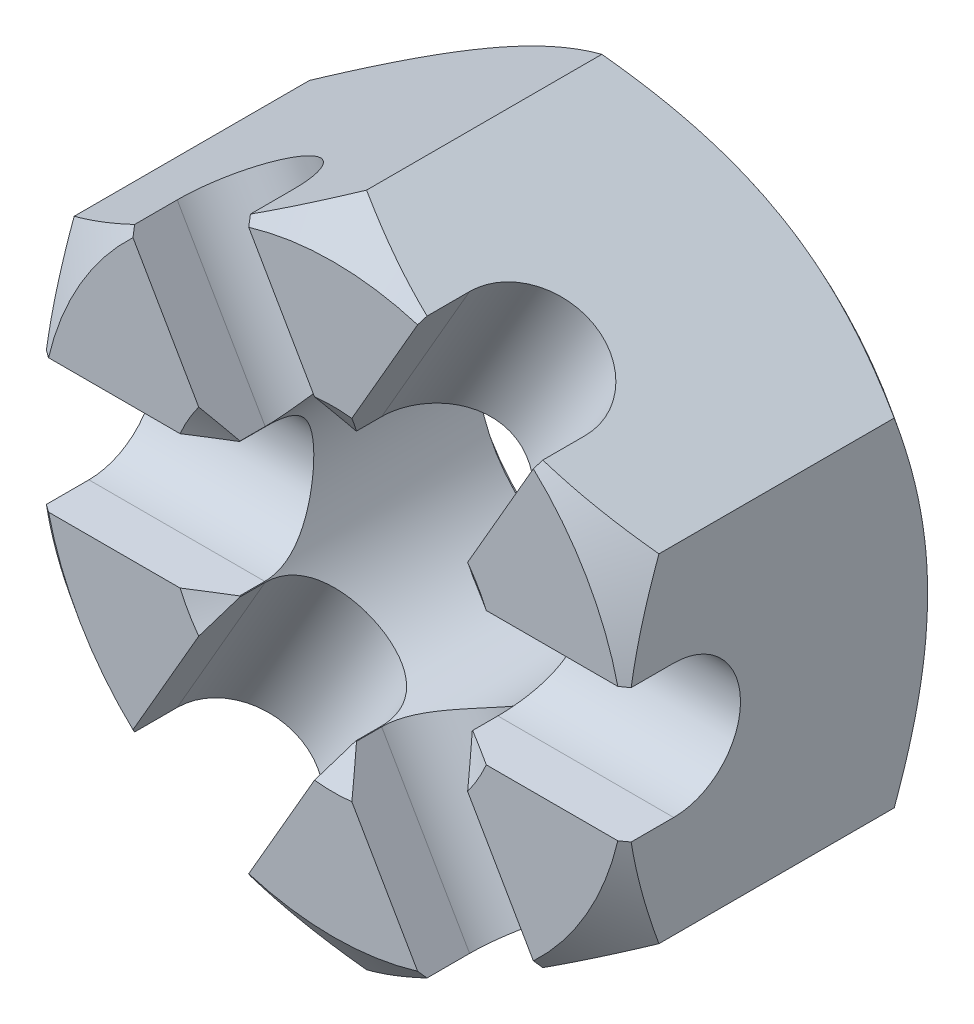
ISO-10303-21;
HEADER;
FILE_DESCRIPTION(('STEP AP214'),'2;1');
FILE_NAME('part.step','',(''),(''),'','','');
FILE_SCHEMA(('AUTOMOTIVE_DESIGN { 1 0 10303 214 1 1 1 1 }'));
ENDSEC;
DATA;
#1=APPLICATION_CONTEXT('core data for automotive mechanical design processes');
#2=APPLICATION_PROTOCOL_DEFINITION('international standard','automotive_design',2000,#1);
#3=PRODUCT_CONTEXT('',#1,'mechanical');
#4=PRODUCT('Part','Part','',(#3));
#5=PRODUCT_RELATED_PRODUCT_CATEGORY('part','',(#4));
#6=PRODUCT_DEFINITION_FORMATION('','',#4);
#7=PRODUCT_DEFINITION_CONTEXT('part definition',#1,'design');
#8=PRODUCT_DEFINITION('design','',#6,#7);
#9=PRODUCT_DEFINITION_SHAPE('','',#8);
#10=(LENGTH_UNIT() NAMED_UNIT(*) SI_UNIT(.MILLI.,.METRE.));
#11=(NAMED_UNIT(*) PLANE_ANGLE_UNIT() SI_UNIT($,.RADIAN.));
#12=(NAMED_UNIT(*) SI_UNIT($,.STERADIAN.) SOLID_ANGLE_UNIT());
#13=UNCERTAINTY_MEASURE_WITH_UNIT(LENGTH_MEASURE(1.E-05),#10,'distance_accuracy_value','');
#14=(GEOMETRIC_REPRESENTATION_CONTEXT(3) GLOBAL_UNCERTAINTY_ASSIGNED_CONTEXT((#13)) GLOBAL_UNIT_ASSIGNED_CONTEXT((#10,
#11,#12)) REPRESENTATION_CONTEXT('',''));
#15=CARTESIAN_POINT('',(0.,0.,0.));
#16=DIRECTION('',(0.,0.,1.));
#17=DIRECTION('',(1.,0.,0.));
#18=AXIS2_PLACEMENT_3D('',#15,#16,#17);
#19=CARTESIAN_POINT('',(0.,0.,-5.7404));
#20=DIRECTION('',(0.,0.,1.));
#21=DIRECTION('',(1.,0.,0.));
#22=AXIS2_PLACEMENT_3D('',#19,#20,#21);
#23=CYLINDRICAL_SURFACE('',#22,2.5527);
#24=CARTESIAN_POINT('',(0.,0.,-0.435739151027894));
#25=DIRECTION('',(0.,0.,1.));
#26=DIRECTION('',(1.,0.,0.));
#27=AXIS2_PLACEMENT_3D('',#24,#25,#26);
#28=CIRCLE('',#27,2.5527);
#29=CARTESIAN_POINT('',(2.21435708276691,-1.27,-0.435739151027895));
#30=VERTEX_POINT('',#29);
#31=CARTESIAN_POINT('',(2.2070308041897,-1.28268948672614,-0.435739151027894));
#32=VERTEX_POINT('',#31);
#33=EDGE_CURVE('E11',#30,#32,#28,.F.);
#34=ORIENTED_EDGE('',*,*,#33,.F.);
#35=DIRECTION('',(0.,0.,1.));
#36=VECTOR('',#35,1.);
#37=CARTESIAN_POINT('',(2.21435708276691,-1.27,-5.7404));
#38=LINE('',#37,#36);
#39=CARTESIAN_POINT('',(2.21435708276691,-1.27,-0.914399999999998));
#40=VERTEX_POINT('',#39);
#41=EDGE_CURVE('E384',#30,#40,#38,.F.);
#42=ORIENTED_EDGE('',*,*,#41,.T.);
#43=CARTESIAN_POINT('',(2.21435708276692,-1.27,-0.914399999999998));
#44=CARTESIAN_POINT('',(2.21435054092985,-1.27000244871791,-0.94769431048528));
#45=CARTESIAN_POINT('',(2.2151089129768,-1.26868988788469,-0.980969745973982));
#46=CARTESIAN_POINT('',(2.21809192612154,-1.26347114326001,-1.04723063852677));
#47=CARTESIAN_POINT('',(2.22031567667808,-1.25956653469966,-1.0802162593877));
#48=CARTESIAN_POINT('',(2.22905296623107,-1.24408451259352,-1.17799331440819));
#49=CARTESIAN_POINT('',(2.23763422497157,-1.22873778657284,-1.24204599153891));
#50=CARTESIAN_POINT('',(2.25914180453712,-1.18872256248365,-1.36616752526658));
#51=CARTESIAN_POINT('',(2.27205941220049,-1.16407274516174,-1.42624408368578));
#52=CARTESIAN_POINT('',(2.30076213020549,-1.10626033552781,-1.54149740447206));
#53=CARTESIAN_POINT('',(2.31655162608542,-1.0730846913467,-1.59666647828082));
#54=CARTESIAN_POINT('',(2.35076857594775,-0.996031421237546,-1.70535635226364));
#55=CARTESIAN_POINT('',(2.36930610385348,-0.951504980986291,-1.75838243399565));
#56=CARTESIAN_POINT('',(2.40603908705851,-0.85437084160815,-1.85659015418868));
#57=CARTESIAN_POINT('',(2.42423444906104,-0.801760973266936,-1.90176968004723));
#58=CARTESIAN_POINT('',(2.45968887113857,-0.685658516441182,-1.98596308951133));
#59=CARTESIAN_POINT('',(2.47680456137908,-0.621674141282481,-2.02436483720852));
#60=CARTESIAN_POINT('',(2.50673196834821,-0.487141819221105,-2.08963256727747));
#61=CARTESIAN_POINT('',(2.51954634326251,-0.41659796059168,-2.11650567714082));
#62=CARTESIAN_POINT('',(2.53862838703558,-0.27622548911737,-2.1559850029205));
#63=CARTESIAN_POINT('',(2.54529426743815,-0.20669777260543,-2.16946426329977));
#64=CARTESIAN_POINT('',(2.55281382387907,-0.0660714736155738,-2.18464699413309));
#65=CARTESIAN_POINT('',(2.55367088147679,0.00502617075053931,-2.18635731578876));
#66=CARTESIAN_POINT('',(2.5496661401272,0.140216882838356,-2.17829371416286));
#67=CARTESIAN_POINT('',(2.54529047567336,0.204385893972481,-2.16949609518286));
#68=CARTESIAN_POINT('',(2.53204469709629,0.330194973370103,-2.1424114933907));
#69=CARTESIAN_POINT('',(2.52317433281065,0.391834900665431,-2.12412398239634));
#70=CARTESIAN_POINT('',(2.50159827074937,0.511918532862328,-2.07845583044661));
#71=CARTESIAN_POINT('',(2.48884081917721,0.570305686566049,-2.05095195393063));
#72=CARTESIAN_POINT('',(2.46064334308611,0.681778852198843,-1.98779924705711));
#73=CARTESIAN_POINT('',(2.44520231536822,0.73486286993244,-1.95214736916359));
#74=CARTESIAN_POINT('',(2.41138224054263,0.839532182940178,-1.86987008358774));
#75=CARTESIAN_POINT('',(2.39286346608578,0.890510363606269,-1.82252923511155));
#76=CARTESIAN_POINT('',(2.35590559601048,0.984136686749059,-1.72012561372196));
#77=CARTESIAN_POINT('',(2.33746658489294,1.02677745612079,-1.66505607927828));
#78=CARTESIAN_POINT('',(2.30150446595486,1.10513809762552,-1.54452461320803));
#79=CARTESIAN_POINT('',(2.28411242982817,1.1402520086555,-1.47862633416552));
#80=CARTESIAN_POINT('',(2.25405258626,1.1985868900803,-1.3408465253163));
#81=CARTESIAN_POINT('',(2.2413735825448,1.22183609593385,-1.26897967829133));
#82=CARTESIAN_POINT('',(2.22633619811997,1.24893868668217,-1.14947219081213));
#83=CARTESIAN_POINT('',(2.22188749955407,1.25680361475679,-1.10297397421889));
#84=CARTESIAN_POINT('',(2.21587910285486,1.26734706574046,-1.00913395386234));
#85=CARTESIAN_POINT('',(2.21432425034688,1.27001689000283,-0.961790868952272));
#86=CARTESIAN_POINT('',(2.21435708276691,1.27,-0.914399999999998));
#87=B_SPLINE_CURVE_WITH_KNOTS('',3,(#43,#44,#45,#46,#47,#48,#49,#50,#51,#52,#53,#54,#55,#56,#57,
#58,#59,#60,#61,#62,#63,#64,#65,#66,#67,#68,#69,#70,#71,#72,#73,#74,#75,#76,#77,#78,#79,#80,#81,
#82,#83,#84,#85,#86),.UNSPECIFIED.,.F.,.F.,(4,2,2,2,2,2,2,2,2,2,2,2,2,2,2,2,2,2,2,2,2,4),(0.,
0.0998125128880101,0.19956442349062,0.39776405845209,0.595567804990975,0.793676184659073,
1.00781718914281,1.22201575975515,1.45049942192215,1.67884162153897,1.89106837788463,
2.10317157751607,2.29700909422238,2.4908574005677,2.68740865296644,2.88403354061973,
3.09909288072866,3.31434155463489,3.54316320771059,3.7714377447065,3.91318770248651,
4.05517480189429),.UNSPECIFIED.);
#88=CARTESIAN_POINT('',(2.21435708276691,1.27,-0.914399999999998));
#89=VERTEX_POINT('',#88);
#90=EDGE_CURVE('E376',#40,#89,#87,.T.);
#91=ORIENTED_EDGE('',*,*,#90,.T.);
#92=DIRECTION('',(0.,0.,1.));
#93=VECTOR('',#92,1.);
#94=CARTESIAN_POINT('',(2.21435708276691,1.27,-5.7404));
#95=LINE('',#94,#93);
#96=CARTESIAN_POINT('',(2.21435708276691,1.27,-0.435739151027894));
#97=VERTEX_POINT('',#96);
#98=EDGE_CURVE('E358',#89,#97,#95,.T.);
#99=ORIENTED_EDGE('',*,*,#98,.T.);
#100=CARTESIAN_POINT('',(2.20703080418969,1.28268948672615,-0.435739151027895));
#101=VERTEX_POINT('',#100);
#102=EDGE_CURVE('E40',#101,#97,#28,.F.);
#103=ORIENTED_EDGE('',*,*,#102,.F.);
#104=DIRECTION('',(0.,0.,1.));
#105=VECTOR('',#104,1.);
#106=CARTESIAN_POINT('',(2.20703080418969,1.28268948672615,-5.7404));
#107=LINE('',#106,#105);
#108=CARTESIAN_POINT('',(2.20703080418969,1.28268948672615,-0.914399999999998));
#109=VERTEX_POINT('',#108);
#110=EDGE_CURVE('E469',#101,#109,#107,.F.);
#111=ORIENTED_EDGE('',*,*,#110,.T.);
#112=CARTESIAN_POINT('',(0.0073262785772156,2.55268948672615,-0.914399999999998));
#113=CARTESIAN_POINT('',(0.00733307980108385,2.55269211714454,-0.848172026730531));
#114=CARTESIAN_POINT('',(0.0133507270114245,2.55269412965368,-0.781859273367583));
#115=CARTESIAN_POINT('',(0.0369757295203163,2.55245781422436,-0.651264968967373));
#116=CARTESIAN_POINT('',(0.0546076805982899,2.55221897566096,-0.586988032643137));
#117=CARTESIAN_POINT('',(0.100124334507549,2.55083572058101,-0.462600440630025));
#118=CARTESIAN_POINT('',(0.127954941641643,2.54969604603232,-0.402469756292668));
#119=CARTESIAN_POINT('',(0.192386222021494,2.54564405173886,-0.28721611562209));
#120=CARTESIAN_POINT('',(0.228987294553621,2.54273165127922,-0.232093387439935));
#121=CARTESIAN_POINT('',(0.31279087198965,2.5338416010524,-0.123451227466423));
#122=CARTESIAN_POINT('',(0.360614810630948,2.52763318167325,-0.0704298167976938));
#123=CARTESIAN_POINT('',(0.463100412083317,2.51087874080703,0.027780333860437));
#124=CARTESIAN_POINT('',(0.517765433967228,2.50033058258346,0.0729651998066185));
#125=CARTESIAN_POINT('',(0.636046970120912,2.47298225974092,0.157163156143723));
#126=CARTESIAN_POINT('',(0.70001714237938,2.45581261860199,0.195565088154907));
#127=CARTESIAN_POINT('',(0.831489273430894,2.41446430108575,0.260832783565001));
#128=CARTESIAN_POINT('',(0.898988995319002,2.39029002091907,0.287705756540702));
#129=CARTESIAN_POINT('',(1.03009642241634,2.33662920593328,0.32718515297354));
#130=CARTESIAN_POINT('',(1.09364265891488,2.30763790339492,0.34066448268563));
#131=CARTESIAN_POINT('',(1.21918836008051,2.24383678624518,0.355847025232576));
#132=CARTESIAN_POINT('',(1.28118872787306,2.20903046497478,0.357557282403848));
#133=CARTESIAN_POINT('',(1.39626392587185,2.13796753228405,0.349493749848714));
#134=CARTESIAN_POINT('',(1.44964759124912,2.10209395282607,0.340696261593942));
#135=CARTESIAN_POINT('',(1.55197864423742,2.02771828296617,0.313611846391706));
#136=CARTESIAN_POINT('',(1.60092569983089,1.98921599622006,0.295324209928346));
#137=CARTESIAN_POINT('',(1.69413394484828,1.91048808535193,0.24965564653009));
#138=CARTESIAN_POINT('',(1.7383202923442,1.87024591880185,0.222151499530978));
#139=CARTESIAN_POINT('',(1.82076005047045,1.79008962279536,0.158998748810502));
#140=CARTESIAN_POINT('',(1.85901132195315,1.75017561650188,0.123347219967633));
#141=CARTESIAN_POINT('',(1.93274979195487,1.66854944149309,0.0410671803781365));
#142=CARTESIAN_POINT('',(1.96764084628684,1.62701997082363,-0.0062774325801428));
#143=CARTESIAN_POINT('',(2.03024366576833,1.54820106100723,-0.108680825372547));
#144=CARTESIAN_POINT('',(2.05795000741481,1.51091483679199,-0.163745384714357));
#145=CARTESIAN_POINT('',(2.1078127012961,1.44061650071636,-0.284235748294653));
#146=CARTESIAN_POINT('',(2.12951480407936,1.40801632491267,-0.350093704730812));
#147=CARTESIAN_POINT('',(2.16501329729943,1.35280556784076,-0.487846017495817));
#148=CARTESIAN_POINT('',(2.17881787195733,1.33018465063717,-0.559734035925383));
#149=CARTESIAN_POINT('',(2.19774290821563,1.29866041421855,-0.701528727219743));
#150=CARTESIAN_POINT('',(2.20346318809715,1.28881469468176,-0.771143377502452));
#151=CARTESIAN_POINT('',(2.2081508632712,1.28077099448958,-0.911249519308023));
#152=CARTESIAN_POINT('',(2.20712292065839,1.28256497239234,-0.981740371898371));
#153=CARTESIAN_POINT('',(2.1988131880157,1.29674493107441,-1.11350040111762));
#154=CARTESIAN_POINT('',(2.19221736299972,1.3079684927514,-1.17494464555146));
#155=CARTESIAN_POINT('',(2.17370597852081,1.33850511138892,-1.29494620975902));
#156=CARTESIAN_POINT('',(2.1617887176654,1.35782075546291,-1.353502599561));
#157=CARTESIAN_POINT('',(2.13196701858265,1.40420241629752,-1.46915303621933));
#158=CARTESIAN_POINT('',(2.11381061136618,1.43158624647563,-1.52605341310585));
#159=CARTESIAN_POINT('',(2.07162720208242,1.4919765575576,-1.63443826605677));
#160=CARTESIAN_POINT('',(2.04759718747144,1.52498592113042,-1.68591994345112));
#161=CARTESIAN_POINT('',(1.99018520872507,1.59934630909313,-1.78871357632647));
#162=CARTESIAN_POINT('',(1.95601121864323,1.64122422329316,-1.83920573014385));
#163=CARTESIAN_POINT('',(1.87997818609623,1.7277955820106,-1.93124709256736));
#164=CARTESIAN_POINT('',(1.83811663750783,1.77248994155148,-1.97279337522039));
#165=CARTESIAN_POINT('',(1.74566623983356,1.86366349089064,-2.04664856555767));
#166=CARTESIAN_POINT('',(1.69488270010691,1.91015917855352,-2.07869599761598));
#167=CARTESIAN_POINT('',(1.58608586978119,2.00140757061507,-2.13070884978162));
#168=CARTESIAN_POINT('',(1.52807891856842,2.04616175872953,-2.15068477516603));
#169=CARTESIAN_POINT('',(1.41190805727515,2.12776094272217,-2.17628157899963));
#170=CARTESIAN_POINT('',(1.35424060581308,2.16495502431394,-2.18304516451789));
#171=CARTESIAN_POINT('',(1.23591220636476,2.23461513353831,-2.18538483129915));
#172=CARTESIAN_POINT('',(1.17525229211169,2.26708277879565,-2.18096474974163));
#173=CARTESIAN_POINT('',(1.05697728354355,2.32446145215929,-2.16182348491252));
#174=CARTESIAN_POINT('',(0.999419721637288,2.34972590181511,-2.14778865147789));
#175=CARTESIAN_POINT('',(0.885185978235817,2.39509975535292,-2.1107358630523));
#176=CARTESIAN_POINT('',(0.828509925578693,2.41520841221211,-2.08771660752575));
#177=CARTESIAN_POINT('',(0.715219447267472,2.45120867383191,-2.03231330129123));
#178=CARTESIAN_POINT('',(0.658712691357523,2.46688149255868,-1.99956878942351));
#179=CARTESIAN_POINT('',(0.549911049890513,2.49339448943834,-1.92609846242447));
#180=CARTESIAN_POINT('',(0.497618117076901,2.50423243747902,-1.88536897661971));
#181=CARTESIAN_POINT('',(0.393785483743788,2.52274808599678,-1.79242437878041));
#182=CARTESIAN_POINT('',(0.342828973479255,2.53000856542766,-1.73947258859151));
#183=CARTESIAN_POINT('',(0.249568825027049,2.54090594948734,-1.62601027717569));
#184=CARTESIAN_POINT('',(0.207272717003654,2.54453971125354,-1.56549325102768));
#185=CARTESIAN_POINT('',(0.132278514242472,2.54955643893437,-1.43618755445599));
#186=CARTESIAN_POINT('',(0.0999075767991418,2.55086837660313,-1.36720476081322));
#187=CARTESIAN_POINT('',(0.0489044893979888,2.5523623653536,-1.22443825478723));
#188=CARTESIAN_POINT('',(0.0302263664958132,2.55254821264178,-1.15067152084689));
#189=CARTESIAN_POINT('',(0.0152518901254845,2.55265628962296,-1.04916255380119));
#190=CARTESIAN_POINT('',(0.0122857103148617,2.55267117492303,-1.0223013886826));
#191=CARTESIAN_POINT('',(0.0083214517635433,2.55268723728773,-0.968431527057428));
#192=CARTESIAN_POINT('',(0.00732350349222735,2.55268841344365,-0.941422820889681));
#193=CARTESIAN_POINT('',(0.0073262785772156,2.55268948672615,-0.914399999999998));
#194=B_SPLINE_CURVE_WITH_KNOTS('',3,(#112,#113,#114,#115,#116,#117,#118,#119,#120,#121,#122,
#123,#124,#125,#126,#127,#128,#129,#130,#131,#132,#133,#134,#135,#136,#137,#138,#139,#140,#141,
#142,#143,#144,#145,#146,#147,#148,#149,#150,#151,#152,#153,#154,#155,#156,#157,#158,#159,#160,
#161,#162,#163,#164,#165,#166,#167,#168,#169,#170,#171,#172,#173,#174,#175,#176,#177,#178,#179,
#180,#181,#182,#183,#184,#185,#186,#187,#188,#189,#190,#191,#192,#193),.UNSPECIFIED.,.T.,.F.,(4,
2,2,2,2,2,2,2,2,2,2,2,2,2,2,2,2,2,2,2,2,2,2,2,2,2,2,2,2,2,2,2,2,2,2,2,2,2,2,2,4),(0.,
0.198570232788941,0.397562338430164,0.595513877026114,0.793474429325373,1.00759144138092,
1.22181400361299,1.4502984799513,1.67863986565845,1.89086836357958,2.1029698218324,
2.29680548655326,2.49065564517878,2.68720837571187,2.88383178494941,3.09890485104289,
3.31413979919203,3.54280656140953,3.77123592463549,3.98162190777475,4.19186255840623,
4.37944398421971,4.56708542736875,4.76342656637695,4.95986861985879,5.18077817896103,
5.40175988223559,5.62835534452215,5.85475332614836,6.06051067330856,6.266197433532,
6.4585504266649,6.65093127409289,6.85159329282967,7.05234777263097,7.27290628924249,
7.49365577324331,7.7210486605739,7.94767454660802,8.02869125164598,8.10971332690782),.UNSPECIFIED.);
#195=CARTESIAN_POINT('',(0.00732627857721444,2.55268948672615,-0.914399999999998));
#196=VERTEX_POINT('',#195);
#197=EDGE_CURVE('E464',#109,#196,#194,.T.);
#198=ORIENTED_EDGE('',*,*,#197,.T.);
#199=DIRECTION('',(0.,0.,1.));
#200=VECTOR('',#199,1.);
#201=CARTESIAN_POINT('',(0.00732627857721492,2.55268948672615,-5.7404));
#202=LINE('',#201,#200);
#203=CARTESIAN_POINT('',(0.00732627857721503,2.55268948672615,-0.435739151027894));
#204=VERTEX_POINT('',#203);
#205=EDGE_CURVE('E470',#196,#204,#202,.T.);
#206=ORIENTED_EDGE('',*,*,#205,.T.);
#207=CARTESIAN_POINT('',(-0.00732627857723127,2.55268948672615,-0.435739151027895));
#208=VERTEX_POINT('',#207);
#209=EDGE_CURVE('E708',#208,#204,#28,.F.);
#210=ORIENTED_EDGE('',*,*,#209,.F.);
#211=DIRECTION('',(0.,0.,1.));
#212=VECTOR('',#211,1.);
#213=CARTESIAN_POINT('',(-0.00732627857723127,2.55268948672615,-5.7404));
#214=LINE('',#213,#212);
#215=CARTESIAN_POINT('',(-0.0073262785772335,2.55268948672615,-0.914399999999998));
#216=VERTEX_POINT('',#215);
#217=EDGE_CURVE('E437',#208,#216,#214,.F.);
#218=ORIENTED_EDGE('',*,*,#217,.T.);
#219=CARTESIAN_POINT('',(-2.2070308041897,1.28268948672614,-0.914399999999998));
#220=CARTESIAN_POINT('',(-2.20702968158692,1.28269669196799,-0.848172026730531));
#221=CARTESIAN_POINT('',(-2.20402260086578,1.28790913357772,-0.781859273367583));
#222=CARTESIAN_POINT('',(-2.19200544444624,1.30825082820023,-0.651264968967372));
#223=CARTESIAN_POINT('',(-2.18298262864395,1.32340112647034,-0.586988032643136));
#224=CARTESIAN_POINT('',(-2.15902636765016,1.36212807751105,-0.462600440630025));
#225=CARTESIAN_POINT('',(-2.14412407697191,1.38566025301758,-0.402469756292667));
#226=CARTESIAN_POINT('',(-2.10839930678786,1.43943338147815,-0.28721611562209));
#227=CARTESIAN_POINT('',(-2.08757655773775,1.46967463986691,-0.232093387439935));
#228=CARTESIAN_POINT('',(-2.03797575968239,1.53780564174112,-0.123451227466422));
#229=CARTESIAN_POINT('',(-2.00868714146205,1.57611817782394,-0.0704298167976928));
#230=CARTESIAN_POINT('',(-1.94293456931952,1.65649609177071,0.027780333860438));
#231=CARTESIAN_POINT('',(-1.90646708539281,1.69856331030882,0.0729651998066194));
#232=CARTESIAN_POINT('',(-1.82364197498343,1.78732396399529,0.157163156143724));
#233=CARTESIAN_POINT('',(-1.77678754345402,1.83413893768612,0.195565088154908));
#234=CARTESIAN_POINT('',(-1.67524278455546,1.92732298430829,0.260832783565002));
#235=CARTESIAN_POINT('',(-1.62055738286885,1.97369231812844,0.287705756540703));
#236=CARTESIAN_POINT('',(-1.50853204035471,2.06040427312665,0.327185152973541));
#237=CARTESIAN_POINT('',(-1.45165171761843,2.1009412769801,0.34066448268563));
#238=CARTESIAN_POINT('',(-1.33362547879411,2.1777664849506,0.355847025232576));
#239=CARTESIAN_POINT('',(-1.27248213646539,2.21405721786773,0.357557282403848));
#240=CARTESIAN_POINT('',(-1.1534022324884,2.27818379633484,0.349493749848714));
#241=CARTESIAN_POINT('',(-1.09564296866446,2.30647861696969,0.340696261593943));
#242=CARTESIAN_POINT('',(-0.980066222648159,2.35791207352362,0.313611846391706));
#243=CARTESIAN_POINT('',(-0.922248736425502,2.38105032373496,0.295324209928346));
#244=CARTESIAN_POINT('',(-0.807464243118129,2.42240707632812,0.24965564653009));
#245=CARTESIAN_POINT('',(-0.750520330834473,2.440552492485,0.222151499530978));
#246=CARTESIAN_POINT('',(-0.639883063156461,2.47186926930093,0.158998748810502));
#247=CARTESIAN_POINT('',(-0.586190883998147,2.48503883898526,0.123347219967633));
#248=CARTESIAN_POINT('',(-0.478631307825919,2.50808513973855,0.0410671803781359));
#249=CARTESIAN_POINT('',(-0.425220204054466,2.51753694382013,-0.00627743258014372));
#250=CARTESIAN_POINT('',(-0.325659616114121,2.53234312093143,-0.108680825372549));
#251=CARTESIAN_POINT('',(-0.279515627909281,2.5376944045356,-0.163745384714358));
#252=CARTESIAN_POINT('',(-0.193704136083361,2.5457275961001,-0.284235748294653));
#253=CARTESIAN_POINT('',(-0.154620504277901,2.5482220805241,-0.350093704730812));
#254=CARTESIAN_POINT('',(-0.0890573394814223,2.5513592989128,-0.487846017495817));
#255=CARTESIAN_POINT('',(-0.0625647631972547,2.55200395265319,-0.559734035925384));
#256=CARTESIAN_POINT('',(-0.0258014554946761,2.5526313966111,-0.701528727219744));
#257=CARTESIAN_POINT('',(-0.0144146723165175,2.55266244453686,-0.771143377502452));
#258=CARTESIAN_POINT('',(-0.00510478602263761,2.55270024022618,-0.911249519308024));
#259=CARTESIAN_POINT('',(-0.0071723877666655,2.55270700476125,-0.981740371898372));
#260=CARTESIAN_POINT('',(-0.0236074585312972,2.55260054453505,-1.11350040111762));
#261=CARTESIAN_POINT('',(-0.036625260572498,2.55250017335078,-1.17494464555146));
#262=CARTESIAN_POINT('',(-0.0723264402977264,2.5517371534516,-1.29494620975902));
#263=CARTESIAN_POINT('',(-0.0950129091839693,2.55107432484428,-1.353502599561));
#264=CARTESIAN_POINT('',(-0.150091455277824,2.5484388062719,-1.46915303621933));
#265=CARTESIAN_POINT('',(-0.182884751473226,2.54640681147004,-1.52605341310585));
#266=CARTESIAN_POINT('',(-0.256275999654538,2.54007006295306,-1.63443826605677));
#267=CARTESIAN_POINT('',(-0.296877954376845,2.53576414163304,-1.68591994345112));
#268=CARTESIAN_POINT('',(-0.389981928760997,2.52322410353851,-1.78871357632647));
#269=CARTESIAN_POINT('',(-0.44333626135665,2.51456751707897,-1.83920573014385));
#270=CARTESIAN_POINT('',(-0.556325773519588,2.49200665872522,-1.93124709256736));
#271=CARTESIAN_POINT('',(-0.615962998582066,2.47810067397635,-1.97279337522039));
#272=CARTESIAN_POINT('',(-0.741146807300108,2.44362305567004,-2.04664856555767));
#273=CARTESIAN_POINT('',(-0.806805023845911,2.4228910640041,-2.07869599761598));
#274=CARTESIAN_POINT('',(-0.940226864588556,2.37429444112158,-2.13070884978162));
#275=CARTESIAN_POINT('',(-1.00798860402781,2.34643604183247,-2.15068477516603));
#276=CARTESIAN_POINT('',(-1.13674100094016,2.2866287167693,-2.17628157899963));
#277=CARTESIAN_POINT('',(-1.19778574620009,2.25528427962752,-2.18304516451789));
#278=CARTESIAN_POINT('',(-1.31727737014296,2.18763893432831,-2.18538483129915));
#279=CARTESIAN_POINT('',(-1.3757251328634,2.15133973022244,-2.18096474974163));
#280=CARTESIAN_POINT('',(-1.48455402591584,2.07759990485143,-2.16182348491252));
#281=CARTESIAN_POINT('',(-1.53521246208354,2.04038581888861,-2.14778865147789));
#282=CARTESIAN_POINT('',(-1.63162424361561,1.96414342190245,-2.1107358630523));
#283=CARTESIAN_POINT('',(-1.67737687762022,1.92511484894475,-2.08771660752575));
#284=CARTESIAN_POINT('',(-1.76519925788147,1.84500254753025,-2.03231330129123));
#285=CARTESIAN_POINT('',(-1.80702569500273,1.80390267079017,-1.99956878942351));
#286=CARTESIAN_POINT('',(-1.88438744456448,1.72293418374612,-1.92609846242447));
#287=CARTESIAN_POINT('',(-1.91991984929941,1.68306614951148,-1.88536897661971));
#288=CARTESIAN_POINT('',(-1.98787118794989,1.60240227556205,-1.79242437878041));
#289=CARTESIAN_POINT('',(-2.01963720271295,1.5619028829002,-1.73947258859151));
#290=CARTESIAN_POINT('',(-2.07570468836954,1.48658591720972,-1.62601027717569));
#291=CARTESIAN_POINT('',(-2.09999967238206,1.45177329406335,-1.56549325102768));
#292=CARTESIAN_POINT('',(-2.14184138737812,1.38933477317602,-1.43618755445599));
#293=CARTESIAN_POINT('',(-2.15916302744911,1.36195668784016,-1.36720476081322));
#294=CARTESIAN_POINT('',(-2.18595840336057,1.31853371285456,-1.22443825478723));
#295=CARTESIAN_POINT('',(-2.19545841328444,1.30245090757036,-1.15067152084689));
#296=CARTESIAN_POINT('',(-2.20303924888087,1.28953666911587,-1.04916255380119));
#297=CARTESIAN_POINT('',(-2.20453522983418,1.28697532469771,-1.0223013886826));
#298=CARTESIAN_POINT('',(-2.20653126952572,1.28355020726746,-0.968431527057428));
#299=CARTESIAN_POINT('',(-2.20703126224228,1.28268654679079,-0.941422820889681));
#300=CARTESIAN_POINT('',(-2.2070308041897,1.28268948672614,-0.914399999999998));
#301=B_SPLINE_CURVE_WITH_KNOTS('',3,(#219,#220,#221,#222,#223,#224,#225,#226,#227,#228,#229,
#230,#231,#232,#233,#234,#235,#236,#237,#238,#239,#240,#241,#242,#243,#244,#245,#246,#247,#248,
#249,#250,#251,#252,#253,#254,#255,#256,#257,#258,#259,#260,#261,#262,#263,#264,#265,#266,#267,
#268,#269,#270,#271,#272,#273,#274,#275,#276,#277,#278,#279,#280,#281,#282,#283,#284,#285,#286,
#287,#288,#289,#290,#291,#292,#293,#294,#295,#296,#297,#298,#299,#300),.UNSPECIFIED.,.T.,.F.,(4,
2,2,2,2,2,2,2,2,2,2,2,2,2,2,2,2,2,2,2,2,2,2,2,2,2,2,2,2,2,2,2,2,2,2,2,2,2,2,2,4),(0.,
0.198570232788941,0.397562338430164,0.595513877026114,0.793474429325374,1.00759144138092,
1.22181400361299,1.4502984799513,1.67863986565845,1.89086836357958,2.1029698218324,
2.29680548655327,2.49065564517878,2.68720837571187,2.88383178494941,3.09890485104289,
3.31413979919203,3.54280656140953,3.7712359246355,3.98162190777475,4.19186255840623,
4.37944398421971,4.56708542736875,4.76342656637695,4.95986861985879,5.18077817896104,
5.40175988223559,5.62835534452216,5.85475332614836,6.06051067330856,6.266197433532,
6.4585504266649,6.65093127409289,6.85159329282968,7.05234777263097,7.27290628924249,
7.49365577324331,7.7210486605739,7.94767454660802,8.02869125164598,8.10971332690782),.UNSPECIFIED.);
#302=CARTESIAN_POINT('',(-2.2070308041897,1.28268948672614,-0.914399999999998));
#303=VERTEX_POINT('',#302);
#304=EDGE_CURVE('E432',#216,#303,#301,.T.);
#305=ORIENTED_EDGE('',*,*,#304,.T.);
#306=DIRECTION('',(0.,0.,1.));
#307=VECTOR('',#306,1.);
#308=CARTESIAN_POINT('',(-2.2070308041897,1.28268948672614,-5.7404));
#309=LINE('',#308,#307);
#310=CARTESIAN_POINT('',(-2.2070308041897,1.28268948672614,-0.435739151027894));
#311=VERTEX_POINT('',#310);
#312=EDGE_CURVE('E440',#303,#311,#309,.T.);
#313=ORIENTED_EDGE('',*,*,#312,.T.);
#314=CARTESIAN_POINT('',(-2.21435708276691,1.27,-0.435739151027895));
#315=VERTEX_POINT('',#314);
#316=EDGE_CURVE('E701',#315,#311,#28,.F.);
#317=ORIENTED_EDGE('',*,*,#316,.F.);
#318=DIRECTION('',(0.,0.,1.));
#319=VECTOR('',#318,1.);
#320=CARTESIAN_POINT('',(-2.21435708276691,1.27,-5.7404));
#321=LINE('',#320,#319);
#322=CARTESIAN_POINT('',(-2.21435708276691,1.27,-0.914399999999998));
#323=VERTEX_POINT('',#322);
#324=EDGE_CURVE('E406',#315,#323,#321,.F.);
#325=ORIENTED_EDGE('',*,*,#324,.T.);
#326=CARTESIAN_POINT('',(-2.21435708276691,1.27,-0.914399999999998));
#327=CARTESIAN_POINT('',(-2.21435054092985,1.27000244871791,-0.94769431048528));
#328=CARTESIAN_POINT('',(-2.2151089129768,1.26868988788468,-0.980969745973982));
#329=CARTESIAN_POINT('',(-2.21809192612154,1.26347114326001,-1.04723063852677));
#330=CARTESIAN_POINT('',(-2.22031567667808,1.25956653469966,-1.0802162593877));
#331=CARTESIAN_POINT('',(-2.22905296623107,1.24408451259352,-1.17799331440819));
#332=CARTESIAN_POINT('',(-2.23763422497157,1.22873778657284,-1.24204599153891));
#333=CARTESIAN_POINT('',(-2.25914180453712,1.18872256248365,-1.36616752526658));
#334=CARTESIAN_POINT('',(-2.27205941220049,1.16407274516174,-1.42624408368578));
#335=CARTESIAN_POINT('',(-2.3007621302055,1.10626033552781,-1.54149740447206));
#336=CARTESIAN_POINT('',(-2.31655162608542,1.07308469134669,-1.59666647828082));
#337=CARTESIAN_POINT('',(-2.35076857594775,0.996031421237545,-1.70535635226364));
#338=CARTESIAN_POINT('',(-2.36930610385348,0.95150498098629,-1.75838243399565));
#339=CARTESIAN_POINT('',(-2.40603908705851,0.854370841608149,-1.85659015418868));
#340=CARTESIAN_POINT('',(-2.42423444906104,0.801760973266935,-1.90176968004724));
#341=CARTESIAN_POINT('',(-2.45968887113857,0.68565851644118,-1.98596308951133));
#342=CARTESIAN_POINT('',(-2.47680456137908,0.621674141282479,-2.02436483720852));
#343=CARTESIAN_POINT('',(-2.50673196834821,0.487141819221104,-2.08963256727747));
#344=CARTESIAN_POINT('',(-2.51954634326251,0.416597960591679,-2.11650567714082));
#345=CARTESIAN_POINT('',(-2.53862838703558,0.276225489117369,-2.1559850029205));
#346=CARTESIAN_POINT('',(-2.54529426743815,0.206697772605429,-2.16946426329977));
#347=CARTESIAN_POINT('',(-2.55281382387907,0.0660714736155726,-2.18464699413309));
#348=CARTESIAN_POINT('',(-2.55367088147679,-0.00502617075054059,-2.18635731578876));
#349=CARTESIAN_POINT('',(-2.5496661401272,-0.140216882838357,-2.17829371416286));
#350=CARTESIAN_POINT('',(-2.54529047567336,-0.204385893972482,-2.16949609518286));
#351=CARTESIAN_POINT('',(-2.53204469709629,-0.330194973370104,-2.1424114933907));
#352=CARTESIAN_POINT('',(-2.52317433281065,-0.391834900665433,-2.12412398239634));
#353=CARTESIAN_POINT('',(-2.50159827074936,-0.511918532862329,-2.07845583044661));
#354=CARTESIAN_POINT('',(-2.4888408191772,-0.57030568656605,-2.05095195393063));
#355=CARTESIAN_POINT('',(-2.46064334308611,-0.681778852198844,-1.98779924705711));
#356=CARTESIAN_POINT('',(-2.44520231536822,-0.734862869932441,-1.95214736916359));
#357=CARTESIAN_POINT('',(-2.41138224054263,-0.839532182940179,-1.86987008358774));
#358=CARTESIAN_POINT('',(-2.39286346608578,-0.89051036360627,-1.82252923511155));
#359=CARTESIAN_POINT('',(-2.35590559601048,-0.98413668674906,-1.72012561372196));
#360=CARTESIAN_POINT('',(-2.33746658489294,-1.02677745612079,-1.66505607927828));
#361=CARTESIAN_POINT('',(-2.30150446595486,-1.10513809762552,-1.54452461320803));
#362=CARTESIAN_POINT('',(-2.28411242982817,-1.1402520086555,-1.47862633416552));
#363=CARTESIAN_POINT('',(-2.25405258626,-1.19858689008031,-1.3408465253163));
#364=CARTESIAN_POINT('',(-2.2413735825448,-1.22183609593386,-1.26897967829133));
#365=CARTESIAN_POINT('',(-2.22633619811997,-1.24893868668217,-1.14947219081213));
#366=CARTESIAN_POINT('',(-2.22188749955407,-1.25680361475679,-1.10297397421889));
#367=CARTESIAN_POINT('',(-2.21587910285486,-1.26734706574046,-1.00913395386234));
#368=CARTESIAN_POINT('',(-2.21432425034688,-1.27001689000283,-0.961790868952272));
#369=CARTESIAN_POINT('',(-2.21435708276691,-1.27,-0.914399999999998));
#370=B_SPLINE_CURVE_WITH_KNOTS('',3,(#326,#327,#328,#329,#330,#331,#332,#333,#334,#335,#336,
#337,#338,#339,#340,#341,#342,#343,#344,#345,#346,#347,#348,#349,#350,#351,#352,#353,#354,#355,
#356,#357,#358,#359,#360,#361,#362,#363,#364,#365,#366,#367,#368,#369),.UNSPECIFIED.,.F.,.F.,(4,
2,2,2,2,2,2,2,2,2,2,2,2,2,2,2,2,2,2,2,2,4),(0.,0.0998125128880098,0.19956442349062,
0.39776405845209,0.595567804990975,0.793676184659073,1.00781718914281,1.22201575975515,
1.45049942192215,1.67884162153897,1.89106837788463,2.10317157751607,2.29700909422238,
2.4908574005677,2.68740865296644,2.88403354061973,3.09909288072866,3.31434155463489,
3.54316320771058,3.7714377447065,3.91318770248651,4.05517480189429),.UNSPECIFIED.);
#371=CARTESIAN_POINT('',(-2.21435708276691,-1.27,-0.914399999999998));
#372=VERTEX_POINT('',#371);
#373=EDGE_CURVE('E399',#323,#372,#370,.T.);
#374=ORIENTED_EDGE('',*,*,#373,.T.);
#375=DIRECTION('',(0.,0.,1.));
#376=VECTOR('',#375,1.);
#377=CARTESIAN_POINT('',(-2.21435708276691,-1.27,-5.7404));
#378=LINE('',#377,#376);
#379=CARTESIAN_POINT('',(-2.21435708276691,-1.27,-0.435739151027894));
#380=VERTEX_POINT('',#379);
#381=EDGE_CURVE('E405',#372,#380,#378,.T.);
#382=ORIENTED_EDGE('',*,*,#381,.T.);
#383=CARTESIAN_POINT('',(-2.20703080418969,-1.28268948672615,-0.435739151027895));
#384=VERTEX_POINT('',#383);
#385=EDGE_CURVE('E707',#384,#380,#28,.F.);
#386=ORIENTED_EDGE('',*,*,#385,.F.);
#387=DIRECTION('',(0.,0.,1.));
#388=VECTOR('',#387,1.);
#389=CARTESIAN_POINT('',(-2.20703080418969,-1.28268948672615,-5.7404));
#390=LINE('',#389,#388);
#391=CARTESIAN_POINT('',(-2.20703080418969,-1.28268948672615,-0.914399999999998));
#392=VERTEX_POINT('',#391);
#393=EDGE_CURVE('E443',#384,#392,#390,.F.);
#394=ORIENTED_EDGE('',*,*,#393,.T.);
#395=CARTESIAN_POINT('',(-2.20703080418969,-1.28268948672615,-0.914399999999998));
#396=CARTESIAN_POINT('',(-2.20702968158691,-1.28269669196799,-0.980627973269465));
#397=CARTESIAN_POINT('',(-2.20402260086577,-1.28790913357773,-1.04694072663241));
#398=CARTESIAN_POINT('',(-2.19200544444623,-1.30825082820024,-1.17753503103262));
#399=CARTESIAN_POINT('',(-2.18298262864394,-1.32340112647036,-1.24181196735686));
#400=CARTESIAN_POINT('',(-2.15902636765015,-1.36212807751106,-1.36619955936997));
#401=CARTESIAN_POINT('',(-2.1441240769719,-1.38566025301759,-1.42633024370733));
#402=CARTESIAN_POINT('',(-2.10839930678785,-1.43943338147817,-1.54158388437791));
#403=CARTESIAN_POINT('',(-2.08757655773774,-1.46967463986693,-1.59670661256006));
#404=CARTESIAN_POINT('',(-2.03797575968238,-1.53780564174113,-1.70534877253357));
#405=CARTESIAN_POINT('',(-2.00868714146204,-1.57611817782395,-1.7583701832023));
#406=CARTESIAN_POINT('',(-1.94293456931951,-1.65649609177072,-1.85658033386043));
#407=CARTESIAN_POINT('',(-1.9064670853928,-1.69856331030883,-1.90176519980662));
#408=CARTESIAN_POINT('',(-1.82364197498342,-1.7873239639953,-1.98596315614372));
#409=CARTESIAN_POINT('',(-1.77678754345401,-1.83413893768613,-2.0243650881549));
#410=CARTESIAN_POINT('',(-1.67524278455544,-1.9273229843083,-2.089632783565));
#411=CARTESIAN_POINT('',(-1.62055738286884,-1.97369231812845,-2.1165057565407));
#412=CARTESIAN_POINT('',(-1.5085320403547,-2.06040427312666,-2.15598515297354));
#413=CARTESIAN_POINT('',(-1.45165171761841,-2.10094127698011,-2.16946448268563));
#414=CARTESIAN_POINT('',(-1.33362547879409,-2.17776648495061,-2.18464702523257));
#415=CARTESIAN_POINT('',(-1.27248213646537,-2.21405721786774,-2.18635728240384));
#416=CARTESIAN_POINT('',(-1.15340223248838,-2.27818379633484,-2.17829374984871));
#417=CARTESIAN_POINT('',(-1.09564296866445,-2.3064786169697,-2.16949626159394));
#418=CARTESIAN_POINT('',(-0.980066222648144,-2.35791207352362,-2.1424118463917));
#419=CARTESIAN_POINT('',(-0.922248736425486,-2.38105032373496,-2.12412420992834));
#420=CARTESIAN_POINT('',(-0.807464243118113,-2.42240707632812,-2.07845564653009));
#421=CARTESIAN_POINT('',(-0.750520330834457,-2.440552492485,-2.05095149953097));
#422=CARTESIAN_POINT('',(-0.639883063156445,-2.47186926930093,-1.9877987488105));
#423=CARTESIAN_POINT('',(-0.586190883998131,-2.48503883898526,-1.95214721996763));
#424=CARTESIAN_POINT('',(-0.478631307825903,-2.50808513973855,-1.86986718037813));
#425=CARTESIAN_POINT('',(-0.42522020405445,-2.51753694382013,-1.82252256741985));
#426=CARTESIAN_POINT('',(-0.325659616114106,-2.53234312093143,-1.72011917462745));
#427=CARTESIAN_POINT('',(-0.279515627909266,-2.5376944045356,-1.66505461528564));
#428=CARTESIAN_POINT('',(-0.193704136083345,-2.5457275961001,-1.54456425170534));
#429=CARTESIAN_POINT('',(-0.154620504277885,-2.5482220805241,-1.47870629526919));
#430=CARTESIAN_POINT('',(-0.0890573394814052,-2.5513592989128,-1.34095398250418));
#431=CARTESIAN_POINT('',(-0.0625647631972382,-2.55200395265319,-1.26906596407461));
#432=CARTESIAN_POINT('',(-0.02580145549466,-2.5526313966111,-1.12727127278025));
#433=CARTESIAN_POINT('',(-0.0144146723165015,-2.55266244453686,-1.05765662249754));
#434=CARTESIAN_POINT('',(-0.00510478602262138,-2.55270024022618,-0.917550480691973));
#435=CARTESIAN_POINT('',(-0.0071723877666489,-2.55270700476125,-0.847059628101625));
#436=CARTESIAN_POINT('',(-0.0236074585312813,-2.55260054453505,-0.715299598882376));
#437=CARTESIAN_POINT('',(-0.0366252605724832,-2.55250017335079,-0.653855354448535));
#438=CARTESIAN_POINT('',(-0.0723264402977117,-2.5517371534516,-0.533853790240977));
#439=CARTESIAN_POINT('',(-0.0950129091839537,-2.55107432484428,-0.475297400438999));
#440=CARTESIAN_POINT('',(-0.150091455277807,-2.5484388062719,-0.35964696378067));
#441=CARTESIAN_POINT('',(-0.18288475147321,-2.54640681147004,-0.302746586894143));
#442=CARTESIAN_POINT('',(-0.256275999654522,-2.54007006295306,-0.194361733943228));
#443=CARTESIAN_POINT('',(-0.296877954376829,-2.53576414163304,-0.14288005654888));
#444=CARTESIAN_POINT('',(-0.389981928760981,-2.52322410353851,-0.0400864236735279));
#445=CARTESIAN_POINT('',(-0.443336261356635,-2.51456751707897,0.0104057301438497));
#446=CARTESIAN_POINT('',(-0.556325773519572,-2.49200665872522,0.102447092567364));
#447=CARTESIAN_POINT('',(-0.615962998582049,-2.47810067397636,0.143993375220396));
#448=CARTESIAN_POINT('',(-0.741146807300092,-2.44362305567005,0.21784856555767));
#449=CARTESIAN_POINT('',(-0.806805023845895,-2.42289106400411,0.249895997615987));
#450=CARTESIAN_POINT('',(-0.94022686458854,-2.37429444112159,0.301908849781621));
#451=CARTESIAN_POINT('',(-1.0079886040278,-2.34643604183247,0.321884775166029));
#452=CARTESIAN_POINT('',(-1.13674100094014,-2.28662871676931,0.347481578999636));
#453=CARTESIAN_POINT('',(-1.19778574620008,-2.25528427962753,0.354245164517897));
#454=CARTESIAN_POINT('',(-1.31727737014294,-2.18763893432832,0.356584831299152));
#455=CARTESIAN_POINT('',(-1.37572513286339,-2.15133973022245,0.352164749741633));
#456=CARTESIAN_POINT('',(-1.48455402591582,-2.07759990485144,0.33302348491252));
#457=CARTESIAN_POINT('',(-1.53521246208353,-2.04038581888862,0.318988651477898));
#458=CARTESIAN_POINT('',(-1.6316242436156,-1.96414342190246,0.281935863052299));
#459=CARTESIAN_POINT('',(-1.67737687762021,-1.92511484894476,0.258916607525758));
#460=CARTESIAN_POINT('',(-1.76519925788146,-1.84500254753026,0.203513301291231));
#461=CARTESIAN_POINT('',(-1.80702569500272,-1.80390267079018,0.170768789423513));
#462=CARTESIAN_POINT('',(-1.88438744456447,-1.72293418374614,0.0972984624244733));
#463=CARTESIAN_POINT('',(-1.9199198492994,-1.6830661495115,0.0565689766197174));
#464=CARTESIAN_POINT('',(-1.98787118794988,-1.60240227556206,-0.0363756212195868));
#465=CARTESIAN_POINT('',(-2.01963720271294,-1.56190288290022,-0.0893274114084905));
#466=CARTESIAN_POINT('',(-2.07570468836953,-1.48658591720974,-0.202789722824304));
#467=CARTESIAN_POINT('',(-2.09999967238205,-1.45177329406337,-0.263306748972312));
#468=CARTESIAN_POINT('',(-2.14184138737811,-1.38933477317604,-0.392612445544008));
#469=CARTESIAN_POINT('',(-2.1591630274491,-1.36195668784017,-0.461595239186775));
#470=CARTESIAN_POINT('',(-2.18595840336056,-1.31853371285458,-0.604361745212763));
#471=CARTESIAN_POINT('',(-2.19545841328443,-1.30245090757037,-0.678128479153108));
#472=CARTESIAN_POINT('',(-2.20303924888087,-1.28953666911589,-0.779637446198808));
#473=CARTESIAN_POINT('',(-2.20453522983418,-1.28697532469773,-0.806498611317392));
#474=CARTESIAN_POINT('',(-2.20653126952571,-1.28355020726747,-0.860368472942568));
#475=CARTESIAN_POINT('',(-2.20703126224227,-1.2826865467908,-0.887377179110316));
#476=CARTESIAN_POINT('',(-2.20703080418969,-1.28268948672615,-0.914399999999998));
#477=B_SPLINE_CURVE_WITH_KNOTS('',3,(#395,#396,#397,#398,#399,#400,#401,#402,#403,#404,#405,
#406,#407,#408,#409,#410,#411,#412,#413,#414,#415,#416,#417,#418,#419,#420,#421,#422,#423,#424,
#425,#426,#427,#428,#429,#430,#431,#432,#433,#434,#435,#436,#437,#438,#439,#440,#441,#442,#443,
#444,#445,#446,#447,#448,#449,#450,#451,#452,#453,#454,#455,#456,#457,#458,#459,#460,#461,#462,
#463,#464,#465,#466,#467,#468,#469,#470,#471,#472,#473,#474,#475,#476),.UNSPECIFIED.,.T.,.F.,(4,
2,2,2,2,2,2,2,2,2,2,2,2,2,2,2,2,2,2,2,2,2,2,2,2,2,2,2,2,2,2,2,2,2,2,2,2,2,2,2,4),(0.,
0.198570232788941,0.397562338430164,0.595513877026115,0.793474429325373,1.00759144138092,
1.22181400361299,1.4502984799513,1.67863986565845,1.89086836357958,2.1029698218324,
2.29680548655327,2.49065564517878,2.68720837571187,2.88383178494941,3.09890485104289,
3.31413979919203,3.54280656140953,3.77123592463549,3.98162190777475,4.19186255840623,
4.37944398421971,4.56708542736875,4.76342656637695,4.95986861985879,5.18077817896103,
5.40175988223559,5.62835534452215,5.85475332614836,6.06051067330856,6.266197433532,
6.4585504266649,6.65093127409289,6.85159329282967,7.05234777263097,7.27290628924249,
7.49365577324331,7.7210486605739,7.94767454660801,8.02869125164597,8.10971332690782),.UNSPECIFIED.);
#478=CARTESIAN_POINT('',(-0.00732627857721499,-2.55268948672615,-0.914399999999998));
#479=VERTEX_POINT('',#478);
#480=EDGE_CURVE('E445',#392,#479,#477,.T.);
#481=ORIENTED_EDGE('',*,*,#480,.T.);
#482=DIRECTION('',(0.,0.,1.));
#483=VECTOR('',#482,1.);
#484=CARTESIAN_POINT('',(-0.00732627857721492,-2.55268948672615,-5.7404));
#485=LINE('',#484,#483);
#486=CARTESIAN_POINT('',(-0.00732627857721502,-2.55268948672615,-0.435739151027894));
#487=VERTEX_POINT('',#486);
#488=EDGE_CURVE('E451',#479,#487,#485,.T.);
#489=ORIENTED_EDGE('',*,*,#488,.T.);
#490=CARTESIAN_POINT('',(0.00732627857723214,-2.55268948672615,-0.435739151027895));
#491=VERTEX_POINT('',#490);
#492=EDGE_CURVE('E38',#491,#487,#28,.F.);
#493=ORIENTED_EDGE('',*,*,#492,.F.);
#494=DIRECTION('',(0.,0.,1.));
#495=VECTOR('',#494,1.);
#496=CARTESIAN_POINT('',(0.00732627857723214,-2.55268948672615,-5.7404));
#497=LINE('',#496,#495);
#498=CARTESIAN_POINT('',(0.00732627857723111,-2.55268948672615,-0.914399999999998));
#499=VERTEX_POINT('',#498);
#500=EDGE_CURVE('E415',#491,#499,#497,.F.);
#501=ORIENTED_EDGE('',*,*,#500,.T.);
#502=CARTESIAN_POINT('',(0.00732627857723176,-2.55268948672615,-0.914399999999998));
#503=CARTESIAN_POINT('',(0.00733307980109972,-2.55269211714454,-0.980627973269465));
#504=CARTESIAN_POINT('',(0.0133507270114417,-2.55269412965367,-1.04694072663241));
#505=CARTESIAN_POINT('',(0.0369757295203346,-2.55245781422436,-1.17753503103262));
#506=CARTESIAN_POINT('',(0.0546076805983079,-2.55221897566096,-1.24181196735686));
#507=CARTESIAN_POINT('',(0.100124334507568,-2.550835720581,-1.36619955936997));
#508=CARTESIAN_POINT('',(0.127954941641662,-2.54969604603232,-1.42633024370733));
#509=CARTESIAN_POINT('',(0.192386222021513,-2.54564405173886,-1.54158388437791));
#510=CARTESIAN_POINT('',(0.228987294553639,-2.54273165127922,-1.59670661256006));
#511=CARTESIAN_POINT('',(0.312790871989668,-2.5338416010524,-1.70534877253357));
#512=CARTESIAN_POINT('',(0.360614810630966,-2.52763318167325,-1.7583701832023));
#513=CARTESIAN_POINT('',(0.463100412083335,-2.51087874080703,-1.85658033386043));
#514=CARTESIAN_POINT('',(0.517765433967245,-2.50033058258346,-1.90176519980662));
#515=CARTESIAN_POINT('',(0.636046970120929,-2.47298225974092,-1.98596315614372));
#516=CARTESIAN_POINT('',(0.700017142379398,-2.45581261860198,-2.0243650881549));
#517=CARTESIAN_POINT('',(0.831489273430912,-2.41446430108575,-2.089632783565));
#518=CARTESIAN_POINT('',(0.89898899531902,-2.39029002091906,-2.1165057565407));
#519=CARTESIAN_POINT('',(1.03009642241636,-2.33662920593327,-2.15598515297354));
#520=CARTESIAN_POINT('',(1.0936426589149,-2.30763790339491,-2.16946448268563));
#521=CARTESIAN_POINT('',(1.21918836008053,-2.24383678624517,-2.18464702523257));
#522=CARTESIAN_POINT('',(1.28118872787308,-2.20903046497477,-2.18635728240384));
#523=CARTESIAN_POINT('',(1.39626392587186,-2.13796753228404,-2.17829374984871));
#524=CARTESIAN_POINT('',(1.44964759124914,-2.10209395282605,-2.16949626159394));
#525=CARTESIAN_POINT('',(1.55197864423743,-2.02771828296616,-2.1424118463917));
#526=CARTESIAN_POINT('',(1.6009256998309,-1.98921599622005,-2.12412420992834));
#527=CARTESIAN_POINT('',(1.69413394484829,-1.91048808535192,-2.07845564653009));
#528=CARTESIAN_POINT('',(1.73832029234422,-1.87024591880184,-2.05095149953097));
#529=CARTESIAN_POINT('',(1.82076005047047,-1.79008962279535,-1.9877987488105));
#530=CARTESIAN_POINT('',(1.85901132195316,-1.75017561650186,-1.95214721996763));
#531=CARTESIAN_POINT('',(1.93274979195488,-1.66854944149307,-1.86986718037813));
#532=CARTESIAN_POINT('',(1.96764084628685,-1.62701997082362,-1.82252256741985));
#533=CARTESIAN_POINT('',(2.03024366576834,-1.54820106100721,-1.72011917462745));
#534=CARTESIAN_POINT('',(2.05795000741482,-1.51091483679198,-1.66505461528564));
#535=CARTESIAN_POINT('',(2.10781270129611,-1.44061650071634,-1.54456425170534));
#536=CARTESIAN_POINT('',(2.12951480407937,-1.40801632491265,-1.47870629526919));
#537=CARTESIAN_POINT('',(2.16501329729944,-1.35280556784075,-1.34095398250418));
#538=CARTESIAN_POINT('',(2.17881787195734,-1.33018465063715,-1.26906596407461));
#539=CARTESIAN_POINT('',(2.19774290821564,-1.29866041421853,-1.12727127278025));
#540=CARTESIAN_POINT('',(2.20346318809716,-1.28881469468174,-1.05765662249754));
#541=CARTESIAN_POINT('',(2.20815086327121,-1.28077099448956,-0.917550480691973));
#542=CARTESIAN_POINT('',(2.2071229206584,-1.28256497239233,-0.847059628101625));
#543=CARTESIAN_POINT('',(2.19881318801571,-1.2967449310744,-0.715299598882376));
#544=CARTESIAN_POINT('',(2.19221736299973,-1.30796849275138,-0.653855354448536));
#545=CARTESIAN_POINT('',(2.17370597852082,-1.33850511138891,-0.533853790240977));
#546=CARTESIAN_POINT('',(2.16178871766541,-1.3578207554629,-0.475297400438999));
#547=CARTESIAN_POINT('',(2.13196701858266,-1.4042024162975,-0.35964696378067));
#548=CARTESIAN_POINT('',(2.11381061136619,-1.43158624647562,-0.302746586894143));
#549=CARTESIAN_POINT('',(2.07162720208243,-1.49197655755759,-0.194361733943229));
#550=CARTESIAN_POINT('',(2.04759718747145,-1.52498592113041,-0.14288005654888));
#551=CARTESIAN_POINT('',(1.99018520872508,-1.59934630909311,-0.0400864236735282));
#552=CARTESIAN_POINT('',(1.95601121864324,-1.64122422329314,0.01040573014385));
#553=CARTESIAN_POINT('',(1.87997818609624,-1.72779558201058,0.102447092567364));
#554=CARTESIAN_POINT('',(1.83811663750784,-1.77248994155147,0.143993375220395));
#555=CARTESIAN_POINT('',(1.74566623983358,-1.86366349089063,0.21784856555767));
#556=CARTESIAN_POINT('',(1.69488270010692,-1.9101591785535,0.249895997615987));
#557=CARTESIAN_POINT('',(1.58608586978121,-2.00140757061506,0.301908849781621));
#558=CARTESIAN_POINT('',(1.52807891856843,-2.04616175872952,0.321884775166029));
#559=CARTESIAN_POINT('',(1.41190805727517,-2.12776094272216,0.347481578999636));
#560=CARTESIAN_POINT('',(1.35424060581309,-2.16495502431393,0.354245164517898));
#561=CARTESIAN_POINT('',(1.23591220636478,-2.2346151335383,0.356584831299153));
#562=CARTESIAN_POINT('',(1.17525229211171,-2.26708277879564,0.352164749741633));
#563=CARTESIAN_POINT('',(1.05697728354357,-2.32446145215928,0.33302348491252));
#564=CARTESIAN_POINT('',(0.999419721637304,-2.3497259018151,0.318988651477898));
#565=CARTESIAN_POINT('',(0.885185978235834,-2.39509975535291,0.281935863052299));
#566=CARTESIAN_POINT('',(0.828509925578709,-2.4152084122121,0.258916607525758));
#567=CARTESIAN_POINT('',(0.715219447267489,-2.45120867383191,0.203513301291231));
#568=CARTESIAN_POINT('',(0.65871269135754,-2.46688149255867,0.170768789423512));
#569=CARTESIAN_POINT('',(0.54991104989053,-2.49339448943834,0.0972984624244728));
#570=CARTESIAN_POINT('',(0.497618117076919,-2.50423243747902,0.0565689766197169));
#571=CARTESIAN_POINT('',(0.393785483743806,-2.52274808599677,-0.0363756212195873));
#572=CARTESIAN_POINT('',(0.342828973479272,-2.53000856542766,-0.0893274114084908));
#573=CARTESIAN_POINT('',(0.249568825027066,-2.54090594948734,-0.202789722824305));
#574=CARTESIAN_POINT('',(0.207272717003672,-2.54453971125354,-0.263306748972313));
#575=CARTESIAN_POINT('',(0.132278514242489,-2.54955643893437,-0.392612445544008));
#576=CARTESIAN_POINT('',(0.0999075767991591,-2.55086837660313,-0.461595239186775));
#577=CARTESIAN_POINT('',(0.0489044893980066,-2.5523623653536,-0.604361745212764));
#578=CARTESIAN_POINT('',(0.0302263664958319,-2.55254821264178,-0.678128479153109));
#579=CARTESIAN_POINT('',(0.0152518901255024,-2.55265628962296,-0.779637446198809));
#580=CARTESIAN_POINT('',(0.0122857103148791,-2.55267117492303,-0.806498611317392));
#581=CARTESIAN_POINT('',(0.00832145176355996,-2.55268723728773,-0.860368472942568));
#582=CARTESIAN_POINT('',(0.00732350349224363,-2.55268841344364,-0.887377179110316));
#583=CARTESIAN_POINT('',(0.00732627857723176,-2.55268948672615,-0.914399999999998));
#584=B_SPLINE_CURVE_WITH_KNOTS('',3,(#502,#503,#504,#505,#506,#507,#508,#509,#510,#511,#512,
#513,#514,#515,#516,#517,#518,#519,#520,#521,#522,#523,#524,#525,#526,#527,#528,#529,#530,#531,
#532,#533,#534,#535,#536,#537,#538,#539,#540,#541,#542,#543,#544,#545,#546,#547,#548,#549,#550,
#551,#552,#553,#554,#555,#556,#557,#558,#559,#560,#561,#562,#563,#564,#565,#566,#567,#568,#569,
#570,#571,#572,#573,#574,#575,#576,#577,#578,#579,#580,#581,#582,#583),.UNSPECIFIED.,.T.,.F.,(4,
2,2,2,2,2,2,2,2,2,2,2,2,2,2,2,2,2,2,2,2,2,2,2,2,2,2,2,2,2,2,2,2,2,2,2,2,2,2,2,4),(0.,
0.198570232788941,0.397562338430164,0.595513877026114,0.793474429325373,1.00759144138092,
1.22181400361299,1.4502984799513,1.67863986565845,1.89086836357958,2.1029698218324,
2.29680548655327,2.49065564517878,2.68720837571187,2.88383178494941,3.09890485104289,
3.31413979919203,3.54280656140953,3.77123592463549,3.98162190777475,4.19186255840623,
4.37944398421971,4.56708542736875,4.76342656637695,4.95986861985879,5.18077817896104,
5.40175988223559,5.62835534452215,5.85475332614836,6.06051067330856,6.266197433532,
6.4585504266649,6.65093127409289,6.85159329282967,7.05234777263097,7.27290628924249,
7.49365577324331,7.7210486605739,7.94767454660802,8.02869125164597,8.10971332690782),.UNSPECIFIED.);
#585=CARTESIAN_POINT('',(2.2070308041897,-1.28268948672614,-0.914399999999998));
#586=VERTEX_POINT('',#585);
#587=EDGE_CURVE('E409',#499,#586,#584,.T.);
#588=ORIENTED_EDGE('',*,*,#587,.T.);
#589=DIRECTION('',(0.,0.,1.));
#590=VECTOR('',#589,1.);
#591=CARTESIAN_POINT('',(2.2070308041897,-1.28268948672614,-5.7404));
#592=LINE('',#591,#590);
#593=EDGE_CURVE('E438',#586,#32,#592,.T.);
#594=ORIENTED_EDGE('',*,*,#593,.T.);
#595=EDGE_LOOP('',(#34,#42,#91,#99,#103,#111,#198,#206,#210,#218,#305,#313,#317,#325,#374,#382,
#386,#394,#481,#489,#493,#501,#588,#594));
#596=FACE_BOUND('',#595,.T.);
#597=CARTESIAN_POINT('',(0.,0.,-5.2792608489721));
#598=DIRECTION('',(0.,0.,-1.));
#599=DIRECTION('',(-1.,0.,0.));
#600=AXIS2_PLACEMENT_3D('',#597,#598,#599);
#601=CIRCLE('',#600,2.5527);
#602=CARTESIAN_POINT('',(-2.5527,0.,-5.2792608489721));
#603=VERTEX_POINT('',#602);
#604=EDGE_CURVE('E33',#603,#603,#601,.F.);
#605=ORIENTED_EDGE('',*,*,#604,.F.);
#606=EDGE_LOOP('',(#605));
#607=FACE_BOUND('',#606,.T.);
#608=ADVANCED_FACE('F28',(#596,#607),#23,.F.);
#609=CARTESIAN_POINT('',(-11.1124999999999,0.,-5.7404));
#610=DIRECTION('',(0.,0.,1.));
#611=DIRECTION('',(1.,0.,0.));
#612=AXIS2_PLACEMENT_3D('',#609,#610,#611);
#613=PLANE('',#612);
#614=CARTESIAN_POINT('',(0.,0.,-5.7404));
#615=DIRECTION('',(0.,0.,1.));
#616=DIRECTION('',(1.,0.,0.));
#617=AXIS2_PLACEMENT_3D('',#614,#615,#616);
#618=CIRCLE('',#617,5.55625);
#619=CARTESIAN_POINT('',(5.55625,0.,-5.7404));
#620=VERTEX_POINT('',#619);
#621=CARTESIAN_POINT('',(2.77812500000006,4.81185364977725,-5.7404));
#622=VERTEX_POINT('',#621);
#623=EDGE_CURVE('E801',#620,#622,#618,.T.);
#624=ORIENTED_EDGE('',*,*,#623,.F.);
#625=CARTESIAN_POINT('',(0.,0.,-5.7404));
#626=DIRECTION('',(0.,0.,1.));
#627=DIRECTION('',(1.,0.,0.));
#628=AXIS2_PLACEMENT_3D('',#625,#626,#627);
#629=CIRCLE('',#628,5.55625);
#630=CARTESIAN_POINT('',(2.77812499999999,-4.81185364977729,-5.7404));
#631=VERTEX_POINT('',#630);
#632=EDGE_CURVE('E473',#620,#631,#629,.F.);
#633=ORIENTED_EDGE('',*,*,#632,.T.);
#634=CARTESIAN_POINT('',(-2.77812500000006,-4.81185364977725,-5.7404));
#635=VERTEX_POINT('',#634);
#636=EDGE_CURVE('E477',#631,#635,#629,.F.);
#637=ORIENTED_EDGE('',*,*,#636,.T.);
#638=CARTESIAN_POINT('',(-5.55625,0.,-5.7404));
#639=VERTEX_POINT('',#638);
#640=EDGE_CURVE('E1266',#635,#639,#629,.F.);
#641=ORIENTED_EDGE('',*,*,#640,.T.);
#642=CARTESIAN_POINT('',(-2.77812499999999,4.81185364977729,-5.7404));
#643=VERTEX_POINT('',#642);
#644=EDGE_CURVE('E1264',#639,#643,#629,.F.);
#645=ORIENTED_EDGE('',*,*,#644,.T.);
#646=EDGE_CURVE('E472',#643,#622,#629,.F.);
#647=ORIENTED_EDGE('',*,*,#646,.T.);
#648=EDGE_LOOP('',(#624,#633,#637,#641,#645,#647));
#649=FACE_BOUND('',#648,.T.);
#650=CARTESIAN_POINT('',(0.,0.,-5.7404));
#651=DIRECTION('',(0.,0.,1.));
#652=DIRECTION('',(1.,0.,0.));
#653=AXIS2_PLACEMENT_3D('',#650,#651,#652);
#654=CIRCLE('',#653,3.175);
#655=CARTESIAN_POINT('',(3.175,0.,-5.7404));
#656=VERTEX_POINT('',#655);
#657=EDGE_CURVE('E967',#656,#656,#654,.F.);
#658=ORIENTED_EDGE('',*,*,#657,.F.);
#659=EDGE_LOOP('',(#658));
#660=FACE_BOUND('',#659,.T.);
#661=ADVANCED_FACE('F910',(#649,#660),#613,.F.);
#662=CARTESIAN_POINT('',(-11.1124999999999,0.,0.));
#663=DIRECTION('',(0.,0.,1.));
#664=DIRECTION('',(1.,0.,0.));
#665=AXIS2_PLACEMENT_3D('',#662,#663,#664);
#666=PLANE('',#665);
#667=DIRECTION('',(-0.500000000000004,0.866025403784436,0.));
#668=VECTOR('',#667,1.);
#669=CARTESIAN_POINT('',(3.06733523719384,-7.852780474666,0.));
#670=LINE('',#669,#668);
#671=CARTESIAN_POINT('',(1.60472783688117,-5.31947014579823,0.));
#672=VERTEX_POINT('',#671);
#673=CARTESIAN_POINT('',(0.355115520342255,-3.15507812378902,0.));
#674=VERTEX_POINT('',#673);
#675=EDGE_CURVE('E851',#672,#674,#670,.T.);
#676=ORIENTED_EDGE('',*,*,#675,.T.);
#677=CARTESIAN_POINT('',(0.,0.,0.));
#678=DIRECTION('',(0.,0.,1.));
#679=DIRECTION('',(1.,0.,0.));
#680=AXIS2_PLACEMENT_3D('',#677,#678,#679);
#681=CIRCLE('',#680,3.175);
#682=CARTESIAN_POINT('',(-0.355115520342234,-3.15507812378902,0.));
#683=VERTEX_POINT('',#682);
#684=EDGE_CURVE('E850',#683,#674,#681,.T.);
#685=ORIENTED_EDGE('',*,*,#684,.F.);
#686=DIRECTION('',(0.499999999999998,0.86602540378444,0.));
#687=VECTOR('',#686,1.);
#688=CARTESIAN_POINT('',(-3.06733523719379,-7.85278047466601,0.));
#689=LINE('',#688,#687);
#690=CARTESIAN_POINT('',(-1.60472783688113,-5.31947014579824,0.));
#691=VERTEX_POINT('',#690);
#692=EDGE_CURVE('E745',#691,#683,#689,.T.);
#693=ORIENTED_EDGE('',*,*,#692,.F.);
#694=CARTESIAN_POINT('',(0.,0.,0.));
#695=DIRECTION('',(0.,0.,1.));
#696=DIRECTION('',(1.,0.,0.));
#697=AXIS2_PLACEMENT_3D('',#694,#695,#696);
#698=CIRCLE('',#697,5.55625);
#699=EDGE_CURVE('E666',#691,#672,#698,.T.);
#700=ORIENTED_EDGE('',*,*,#699,.T.);
#701=EDGE_LOOP('',(#676,#685,#693,#700));
#702=FACE_BOUND('',#701,.T.);
#703=ADVANCED_FACE('F849',(#702),#666,.T.);
#704=DIRECTION('',(1.,0.,0.));
#705=VECTOR('',#704,1.);
#706=CARTESIAN_POINT('',(-5.55625,-1.27,0.));
#707=LINE('',#706,#705);
#708=CARTESIAN_POINT('',(2.90993556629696,-1.27,0.));
#709=VERTEX_POINT('',#708);
#710=CARTESIAN_POINT('',(5.40916019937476,-1.27,0.));
#711=VERTEX_POINT('',#710);
#712=EDGE_CURVE('E347',#709,#711,#707,.T.);
#713=ORIENTED_EDGE('',*,*,#712,.F.);
#714=CARTESIAN_POINT('',(2.55482004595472,-1.88507812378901,0.));
#715=VERTEX_POINT('',#714);
#716=EDGE_CURVE('E338',#715,#709,#681,.T.);
#717=ORIENTED_EDGE('',*,*,#716,.F.);
#718=DIRECTION('',(-0.500000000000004,0.866025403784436,0.));
#719=VECTOR('',#718,1.);
#720=CARTESIAN_POINT('',(5.26703976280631,-6.58278047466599,0.));
#721=LINE('',#720,#719);
#722=CARTESIAN_POINT('',(3.80443236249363,-4.04947014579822,0.));
#723=VERTEX_POINT('',#722);
#724=EDGE_CURVE('E884',#723,#715,#721,.T.);
#725=ORIENTED_EDGE('',*,*,#724,.F.);
#726=EDGE_CURVE('E658',#723,#711,#698,.T.);
#727=ORIENTED_EDGE('',*,*,#726,.T.);
#728=EDGE_LOOP('',(#713,#717,#725,#727));
#729=FACE_BOUND('',#728,.T.);
#730=ADVANCED_FACE('F960',(#729),#666,.T.);
#731=CARTESIAN_POINT('',(2.55482004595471,1.88507812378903,0.));
#732=VERTEX_POINT('',#731);
#733=CARTESIAN_POINT('',(3.80443236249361,4.04947014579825,0.));
#734=VERTEX_POINT('',#733);
#735=EDGE_CURVE('E335',#732,#734,#689,.T.);
#736=ORIENTED_EDGE('',*,*,#735,.F.);
#737=CARTESIAN_POINT('',(2.90993556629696,1.27,0.));
#738=VERTEX_POINT('',#737);
#739=EDGE_CURVE('E320',#738,#732,#681,.T.);
#740=ORIENTED_EDGE('',*,*,#739,.F.);
#741=DIRECTION('',(1.,0.,0.));
#742=VECTOR('',#741,1.);
#743=CARTESIAN_POINT('',(-5.55625,1.27,0.));
#744=LINE('',#743,#742);
#745=CARTESIAN_POINT('',(5.40916019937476,1.27,0.));
#746=VERTEX_POINT('',#745);
#747=EDGE_CURVE('E333',#738,#746,#744,.T.);
#748=ORIENTED_EDGE('',*,*,#747,.T.);
#749=EDGE_CURVE('E659',#746,#734,#698,.T.);
#750=ORIENTED_EDGE('',*,*,#749,.T.);
#751=EDGE_LOOP('',(#736,#740,#748,#750));
#752=FACE_BOUND('',#751,.T.);
#753=ADVANCED_FACE('F331',(#752),#666,.T.);
#754=CARTESIAN_POINT('',(-5.40916019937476,1.27,0.));
#755=VERTEX_POINT('',#754);
#756=CARTESIAN_POINT('',(-2.90993556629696,1.27,0.));
#757=VERTEX_POINT('',#756);
#758=EDGE_CURVE('E343',#755,#757,#744,.T.);
#759=ORIENTED_EDGE('',*,*,#758,.T.);
#760=CARTESIAN_POINT('',(-2.55482004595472,1.88507812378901,0.));
#761=VERTEX_POINT('',#760);
#762=EDGE_CURVE('E703',#761,#757,#681,.T.);
#763=ORIENTED_EDGE('',*,*,#762,.F.);
#764=CARTESIAN_POINT('',(-3.80443236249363,4.04947014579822,0.));
#765=VERTEX_POINT('',#764);
#766=EDGE_CURVE('E688',#761,#765,#670,.T.);
#767=ORIENTED_EDGE('',*,*,#766,.T.);
#768=EDGE_CURVE('E664',#765,#755,#698,.T.);
#769=ORIENTED_EDGE('',*,*,#768,.T.);
#770=EDGE_LOOP('',(#759,#763,#767,#769));
#771=FACE_BOUND('',#770,.T.);
#772=ADVANCED_FACE('F685',(#771),#666,.T.);
#773=DIRECTION('',(0.499999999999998,0.86602540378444,0.));
#774=VECTOR('',#773,1.);
#775=CARTESIAN_POINT('',(-5.26703976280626,-6.58278047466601,0.));
#776=LINE('',#775,#774);
#777=CARTESIAN_POINT('',(-3.80443236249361,-4.04947014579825,0.));
#778=VERTEX_POINT('',#777);
#779=CARTESIAN_POINT('',(-2.55482004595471,-1.88507812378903,0.));
#780=VERTEX_POINT('',#779);
#781=EDGE_CURVE('E751',#778,#780,#776,.T.);
#782=ORIENTED_EDGE('',*,*,#781,.T.);
#783=CARTESIAN_POINT('',(-2.90993556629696,-1.27,0.));
#784=VERTEX_POINT('',#783);
#785=EDGE_CURVE('E852',#784,#780,#681,.T.);
#786=ORIENTED_EDGE('',*,*,#785,.F.);
#787=CARTESIAN_POINT('',(-5.40916019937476,-1.27,0.));
#788=VERTEX_POINT('',#787);
#789=EDGE_CURVE('E352',#788,#784,#707,.T.);
#790=ORIENTED_EDGE('',*,*,#789,.F.);
#791=EDGE_CURVE('E671',#788,#778,#698,.T.);
#792=ORIENTED_EDGE('',*,*,#791,.T.);
#793=EDGE_LOOP('',(#782,#786,#790,#792));
#794=FACE_BOUND('',#793,.T.);
#795=ADVANCED_FACE('F1005',(#794),#666,.T.);
#796=CARTESIAN_POINT('',(-0.355115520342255,3.15507812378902,0.));
#797=VERTEX_POINT('',#796);
#798=CARTESIAN_POINT('',(-1.60472783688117,5.31947014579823,0.));
#799=VERTEX_POINT('',#798);
#800=EDGE_CURVE('E883',#797,#799,#721,.T.);
#801=ORIENTED_EDGE('',*,*,#800,.F.);
#802=CARTESIAN_POINT('',(0.355115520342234,3.15507812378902,0.));
#803=VERTEX_POINT('',#802);
#804=EDGE_CURVE('E336',#803,#797,#681,.T.);
#805=ORIENTED_EDGE('',*,*,#804,.F.);
#806=CARTESIAN_POINT('',(1.60472783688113,5.31947014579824,0.));
#807=VERTEX_POINT('',#806);
#808=EDGE_CURVE('E722',#803,#807,#776,.T.);
#809=ORIENTED_EDGE('',*,*,#808,.T.);
#810=EDGE_CURVE('E660',#807,#799,#698,.T.);
#811=ORIENTED_EDGE('',*,*,#810,.T.);
#812=EDGE_LOOP('',(#801,#805,#809,#811));
#813=FACE_BOUND('',#812,.T.);
#814=ADVANCED_FACE('F961',(#813),#666,.T.);
#815=CARTESIAN_POINT('',(-5.55625,1.27,-0.914399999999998));
#816=DIRECTION('',(0.,1.,0.));
#817=DIRECTION('',(-1.,0.,0.));
#818=AXIS2_PLACEMENT_3D('',#815,#816,#817);
#819=PLANE('',#818);
#820=CARTESIAN_POINT('',(0.403347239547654,1.27,-1.29012378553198));
#821=CARTESIAN_POINT('',(0.44952489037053,1.27,-1.28033754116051));
#822=CARTESIAN_POINT('',(0.495364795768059,1.27,-1.26909412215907));
#823=CARTESIAN_POINT('',(0.586323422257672,1.27,-1.24413734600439));
#824=CARTESIAN_POINT('',(0.631442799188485,1.27,-1.23042639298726));
#825=CARTESIAN_POINT('',(0.765474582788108,1.27,-1.18632637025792));
#826=CARTESIAN_POINT('',(0.853380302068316,1.27,-1.15289635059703));
#827=CARTESIAN_POINT('',(1.02630516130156,1.27,-1.08085242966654));
#828=CARTESIAN_POINT('',(1.11133922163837,1.27,-1.04227322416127));
#829=CARTESIAN_POINT('',(1.27973499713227,1.27,-0.961450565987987));
#830=CARTESIAN_POINT('',(1.36309497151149,1.27,-0.919203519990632));
#831=CARTESIAN_POINT('',(1.52150298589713,1.27,-0.835867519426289));
#832=CARTESIAN_POINT('',(1.59665890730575,1.27,-0.794981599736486));
#833=CARTESIAN_POINT('',(1.74607674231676,1.27,-0.711675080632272));
#834=CARTESIAN_POINT('',(1.82033896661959,1.27,-0.669255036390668));
#835=CARTESIAN_POINT('',(2.04258937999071,1.27,-0.540010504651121));
#836=CARTESIAN_POINT('',(2.18956919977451,1.27,-0.451456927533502));
#837=CARTESIAN_POINT('',(2.48768264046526,1.27,-0.26805394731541));
#838=CARTESIAN_POINT('',(2.63874775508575,1.27,-0.173094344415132));
#839=CARTESIAN_POINT('',(2.93969125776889,1.27,0.0186878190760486));
#840=CARTESIAN_POINT('',(3.0895696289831,1.27,0.115510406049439));
#841=CARTESIAN_POINT('',(3.38740781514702,1.27,0.309665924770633));
#842=CARTESIAN_POINT('',(3.53537360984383,1.27,0.406989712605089));
#843=CARTESIAN_POINT('',(3.83070896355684,1.27,0.602507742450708));
#844=CARTESIAN_POINT('',(3.97807857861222,1.27,0.700701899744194));
#845=CARTESIAN_POINT('',(4.12526393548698,1.27,0.799167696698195));
#846=B_SPLINE_CURVE_WITH_KNOTS('',3,(#820,#821,#822,#823,#824,#825,#826,#827,#828,#829,#830,
#831,#832,#833,#834,#835,#836,#837,#838,#839,#840,#841,#842,#843,#844,#845),.UNSPECIFIED.,.F.,
.F.,(4,2,2,2,2,2,2,2,2,2,2,2,4),(0.,0.141543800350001,0.282950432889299,0.564783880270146,
0.84480608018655,1.12510577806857,1.38175583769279,1.63831393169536,2.15303942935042,
2.68831942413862,3.22360700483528,3.75491548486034,4.28617280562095),.UNSPECIFIED.);
#847=EDGE_CURVE('E317',#97,#738,#846,.T.);
#848=ORIENTED_EDGE('',*,*,#847,.F.);
#849=ORIENTED_EDGE('',*,*,#98,.F.);
#850=DIRECTION('',(1.,0.,0.));
#851=VECTOR('',#850,1.);
#852=CARTESIAN_POINT('',(-5.55625,1.27,-0.914399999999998));
#853=LINE('',#852,#851);
#854=CARTESIAN_POINT('',(5.55625,1.27,-0.914399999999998));
#855=VERTEX_POINT('',#854);
#856=EDGE_CURVE('E349',#89,#855,#853,.T.);
#857=ORIENTED_EDGE('',*,*,#856,.T.);
#858=DIRECTION('',(0.,0.,1.));
#859=VECTOR('',#858,1.);
#860=CARTESIAN_POINT('',(5.55625,1.27,-0.914399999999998));
#861=LINE('',#860,#859);
#862=CARTESIAN_POINT('',(5.55625,1.27,-0.105859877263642));
#863=VERTEX_POINT('',#862);
#864=EDGE_CURVE('E768',#855,#863,#861,.T.);
#865=ORIENTED_EDGE('',*,*,#864,.T.);
#866=CARTESIAN_POINT('',(2.72590516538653,1.27,1.88309664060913));
#867=CARTESIAN_POINT('',(2.83819258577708,1.27,1.8078785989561));
#868=CARTESIAN_POINT('',(2.9501190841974,1.27,1.73212602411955));
#869=CARTESIAN_POINT('',(3.17339502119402,1.27,1.57977964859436));
#870=CARTESIAN_POINT('',(3.28474447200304,1.27,1.50318586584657));
#871=CARTESIAN_POINT('',(3.50700982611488,1.27,1.34938587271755));
#872=CARTESIAN_POINT('',(3.61792575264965,1.27,1.27217969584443));
#873=CARTESIAN_POINT('',(3.83942208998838,1.27,1.11728633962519));
#874=CARTESIAN_POINT('',(3.95000249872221,1.27,1.03959915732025));
#875=CARTESIAN_POINT('',(4.28133369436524,1.27,0.805991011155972));
#876=CARTESIAN_POINT('',(4.50169088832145,1.27,0.649512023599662));
#877=CARTESIAN_POINT('',(4.94172035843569,1.27,0.335587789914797));
#878=CARTESIAN_POINT('',(5.16139262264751,1.27,0.178142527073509));
#879=CARTESIAN_POINT('',(5.8077480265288,1.27,-0.286571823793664));
#880=CARTESIAN_POINT('',(6.23377895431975,1.27,-0.594747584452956));
#881=CARTESIAN_POINT('',(7.08489151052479,1.27,-1.21240006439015));
#882=CARTESIAN_POINT('',(7.50997314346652,1.27,-1.5218767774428));
#883=CARTESIAN_POINT('',(8.35960733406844,1.27,-2.14165426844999));
#884=CARTESIAN_POINT('',(8.78415982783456,1.27,-2.45195513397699));
#885=CARTESIAN_POINT('',(9.6328752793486,1.27,-3.07308841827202));
#886=CARTESIAN_POINT('',(10.0570382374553,1.27,-3.38392083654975));
#887=CARTESIAN_POINT('',(10.4811002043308,1.27,-3.69489015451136));
#888=B_SPLINE_CURVE_WITH_KNOTS('',3,(#866,#867,#868,#869,#870,#871,#872,#873,#874,#875,#876,
#877,#878,#879,#880,#881,#882,#883,#884,#885,#886,#887),.UNSPECIFIED.,.F.,.F.,(4,2,2,2,2,2,2,2,
2,2,4),(0.,0.40545278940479,0.810896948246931,1.21631907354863,1.62174369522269,2.4325328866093,
3.24333614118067,4.82075591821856,6.39816815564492,7.97575530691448,9.55334100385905),.UNSPECIFIED.);
#889=EDGE_CURVE('E342',#746,#863,#888,.T.);
#890=ORIENTED_EDGE('',*,*,#889,.F.);
#891=ORIENTED_EDGE('',*,*,#747,.F.);
#892=EDGE_LOOP('',(#848,#849,#857,#865,#890,#891));
#893=FACE_BOUND('',#892,.T.);
#894=ADVANCED_FACE('F340',(#893),#819,.F.);
#895=CARTESIAN_POINT('',(-5.55625,-1.27,-0.914399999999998));
#896=DIRECTION('',(0.,-1.,0.));
#897=DIRECTION('',(1.,0.,0.));
#898=AXIS2_PLACEMENT_3D('',#895,#896,#897);
#899=PLANE('',#898);
#900=CARTESIAN_POINT('',(4.12526393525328,-1.27,0.799167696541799));
#901=CARTESIAN_POINT('',(3.97715794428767,-1.27,0.700087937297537));
#902=CARTESIAN_POINT('',(3.82886618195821,-1.27,0.601280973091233));
#903=CARTESIAN_POINT('',(3.53179839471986,-1.27,0.40463014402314));
#904=CARTESIAN_POINT('',(3.38302279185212,-1.27,0.306785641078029));
#905=CARTESIAN_POINT('',(3.08528209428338,-1.27,0.112737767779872));
#906=CARTESIAN_POINT('',(2.93632034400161,-1.27,0.0165292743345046));
#907=CARTESIAN_POINT('',(2.63711061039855,-1.27,-0.174126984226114));
#908=CARTESIAN_POINT('',(2.48686174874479,-1.27,-0.268573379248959));
#909=CARTESIAN_POINT('',(2.25957532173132,-1.27,-0.408381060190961));
#910=CARTESIAN_POINT('',(2.18321304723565,-1.27,-0.454838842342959));
#911=CARTESIAN_POINT('',(2.029906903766,-1.27,-0.546772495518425));
#912=CARTESIAN_POINT('',(1.95296308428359,-1.27,-0.592248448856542));
#913=CARTESIAN_POINT('',(1.79846553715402,-1.27,-0.681826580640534));
#914=CARTESIAN_POINT('',(1.72091318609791,-1.27,-0.725931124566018));
#915=CARTESIAN_POINT('',(1.56481107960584,-1.27,-0.812410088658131));
#916=CARTESIAN_POINT('',(1.48626099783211,-1.27,-0.854783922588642));
#917=CARTESIAN_POINT('',(1.32737504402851,-1.27,-0.937373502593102));
#918=CARTESIAN_POINT('',(1.24703089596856,-1.27,-0.977573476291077));
#919=CARTESIAN_POINT('',(1.08474058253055,-1.27,-1.0544232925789));
#920=CARTESIAN_POINT('',(1.00279601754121,-1.27,-1.09107648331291));
#921=CARTESIAN_POINT('',(0.836228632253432,-1.27,-1.15948929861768));
#922=CARTESIAN_POINT('',(0.751592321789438,-1.27,-1.19121706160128));
#923=CARTESIAN_POINT('',(0.622627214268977,-1.27,-1.23313430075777));
#924=CARTESIAN_POINT('',(0.579230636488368,-1.27,-1.2461777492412));
#925=CARTESIAN_POINT('',(0.491775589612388,-1.27,-1.26997205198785));
#926=CARTESIAN_POINT('',(0.447716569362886,-1.27,-1.28072086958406));
#927=CARTESIAN_POINT('',(0.403347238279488,-1.27,-1.29012378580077));
#928=B_SPLINE_CURVE_WITH_KNOTS('',3,(#900,#901,#902,#903,#904,#905,#906,#907,#908,#909,#910,
#911,#912,#913,#914,#915,#916,#917,#918,#919,#920,#921,#922,#923,#924,#925,#926,#927),
.UNSPECIFIED.,.F.,.F.,(4,2,2,2,2,2,2,2,2,2,2,2,2,4),(0.,0.53457824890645,1.06877428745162,
1.60075501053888,2.13313344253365,2.40128049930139,2.66940498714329,2.93703797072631,
3.20476086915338,3.47421946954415,3.74342116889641,4.01429758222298,4.1501839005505,
4.28619033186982),.UNSPECIFIED.);
#929=EDGE_CURVE('E46',#709,#30,#928,.T.);
#930=ORIENTED_EDGE('',*,*,#929,.F.);
#931=ORIENTED_EDGE('',*,*,#712,.T.);
#932=CARTESIAN_POINT('',(10.4811002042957,-1.27,-3.69489015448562));
#933=CARTESIAN_POINT('',(10.0570382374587,-1.27,-3.38392083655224));
#934=CARTESIAN_POINT('',(9.63287527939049,-1.27,-3.07308841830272));
#935=CARTESIAN_POINT('',(8.78415982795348,-1.27,-2.45195513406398));
#936=CARTESIAN_POINT('',(8.3596073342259,-1.27,-2.14165426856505));
#937=CARTESIAN_POINT('',(7.509973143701,-1.27,-1.52187677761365));
#938=CARTESIAN_POINT('',(7.08489151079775,-1.27,-1.21240006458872));
#939=CARTESIAN_POINT('',(6.23377895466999,-1.27,-0.594747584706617));
#940=CARTESIAN_POINT('',(5.80774802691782,-1.27,-0.286571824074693));
#941=CARTESIAN_POINT('',(5.16139262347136,-1.27,0.178142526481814));
#942=CARTESIAN_POINT('',(4.94172035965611,-1.27,0.335587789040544));
#943=CARTESIAN_POINT('',(4.50169089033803,-1.27,0.64951202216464));
#944=CARTESIAN_POINT('',(4.28133369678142,-1.27,0.80599100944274));
#945=CARTESIAN_POINT('',(3.95000250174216,-1.27,1.03959915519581));
#946=CARTESIAN_POINT('',(3.83942209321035,-1.27,1.11728633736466));
#947=CARTESIAN_POINT('',(3.61792575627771,-1.27,1.27217969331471));
#948=CARTESIAN_POINT('',(3.507009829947,-1.27,1.34938587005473));
#949=CARTESIAN_POINT('',(3.28474447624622,-1.27,1.5031858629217));
#950=CARTESIAN_POINT('',(3.1733950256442,-1.27,1.57977964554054));
#951=CARTESIAN_POINT('',(2.95011908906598,-1.27,1.73212602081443));
#952=CARTESIAN_POINT('',(2.83819259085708,-1.27,1.80787859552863));
#953=CARTESIAN_POINT('',(2.72590517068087,-1.27,1.8830966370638));
#954=B_SPLINE_CURVE_WITH_KNOTS('',3,(#932,#933,#934,#935,#936,#937,#938,#939,#940,#941,#942,
#943,#944,#945,#946,#947,#948,#949,#950,#951,#952,#953),.UNSPECIFIED.,.F.,.F.,(4,2,2,2,2,2,2,2,
2,2,4),(0.,1.57758569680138,3.15517284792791,4.732585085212,6.31000486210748,7.12080811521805,
7.93159730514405,8.33702192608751,8.74244405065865,9.14788820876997,9.55334099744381),.UNSPECIFIED.);
#955=CARTESIAN_POINT('',(5.55625,-1.27,-0.105859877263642));
#956=VERTEX_POINT('',#955);
#957=EDGE_CURVE('E598',#956,#711,#954,.T.);
#958=ORIENTED_EDGE('',*,*,#957,.F.);
#959=DIRECTION('',(0.,0.,-1.));
#960=VECTOR('',#959,1.);
#961=CARTESIAN_POINT('',(5.55625,-1.27,-0.914399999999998));
#962=LINE('',#961,#960);
#963=CARTESIAN_POINT('',(5.55625,-1.27,-0.914399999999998));
#964=VERTEX_POINT('',#963);
#965=EDGE_CURVE('E770',#956,#964,#962,.T.);
#966=ORIENTED_EDGE('',*,*,#965,.T.);
#967=DIRECTION('',(1.,0.,0.));
#968=VECTOR('',#967,1.);
#969=CARTESIAN_POINT('',(-5.55625,-1.27,-0.914399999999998));
#970=LINE('',#969,#968);
#971=EDGE_CURVE('E779',#40,#964,#970,.T.);
#972=ORIENTED_EDGE('',*,*,#971,.F.);
#973=ORIENTED_EDGE('',*,*,#41,.F.);
#974=EDGE_LOOP('',(#930,#931,#958,#966,#972,#973));
#975=FACE_BOUND('',#974,.T.);
#976=ADVANCED_FACE('F460',(#975),#899,.F.);
#977=CARTESIAN_POINT('',(-0.925337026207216,-1.27,-1.12288608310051));
#978=CARTESIAN_POINT('',(-0.992494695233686,-1.27,-1.0951469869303));
#979=CARTESIAN_POINT('',(-1.0589618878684,-1.27,-1.0658183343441));
#980=CARTESIAN_POINT('',(-1.19070582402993,-1.27,-1.00467927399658));
#981=CARTESIAN_POINT('',(-1.25598319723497,-1.27,-0.972870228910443));
#982=CARTESIAN_POINT('',(-1.38553016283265,-1.27,-0.907476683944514));
#983=CARTESIAN_POINT('',(-1.44980090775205,-1.27,-0.873894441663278));
#984=CARTESIAN_POINT('',(-1.57760595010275,-1.27,-0.805337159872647));
#985=CARTESIAN_POINT('',(-1.64114013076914,-1.27,-0.770361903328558));
#986=CARTESIAN_POINT('',(-1.83061382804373,-1.27,-0.663987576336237));
#987=CARTESIAN_POINT('',(-1.95566715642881,-1.27,-0.591014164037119));
#988=CARTESIAN_POINT('',(-2.20424099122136,-1.27,-0.442451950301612));
#989=CARTESIAN_POINT('',(-2.32776106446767,-1.27,-0.366862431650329));
#990=CARTESIAN_POINT('',(-2.50715729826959,-1.27,-0.255329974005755));
#991=CARTESIAN_POINT('',(-2.56346083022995,-1.27,-0.220072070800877));
#992=CARTESIAN_POINT('',(-2.6758822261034,-1.27,-0.149238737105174));
#993=CARTESIAN_POINT('',(-2.73200005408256,-1.27,-0.113663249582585));
#994=CARTESIAN_POINT('',(-2.93798646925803,-1.27,0.0175902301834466));
#995=CARTESIAN_POINT('',(-3.08734544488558,-1.27,0.114067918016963));
#996=CARTESIAN_POINT('',(-3.38525949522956,-1.27,0.308258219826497));
#997=CARTESIAN_POINT('',(-3.53381455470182,-1.27,0.405970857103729));
#998=CARTESIAN_POINT('',(-3.83022378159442,-1.27,0.602173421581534));
#999=CARTESIAN_POINT('',(-3.97807844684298,-1.27,0.700662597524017));
#1000=CARTESIAN_POINT('',(-4.273351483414,-1.27,0.89827646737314));
#1001=CARTESIAN_POINT('',(-4.42076987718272,-1.27,0.9974011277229));
#1002=CARTESIAN_POINT('',(-4.56804508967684,-1.27,1.09673582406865));
#1003=B_SPLINE_CURVE_WITH_KNOTS('',3,(#977,#978,#979,#980,#981,#982,#983,#984,#985,#986,#987,
#988,#989,#990,#991,#992,#993,#994,#995,#996,#997,#998,#999,#1000,#1001,#1002),.UNSPECIFIED.,
.F.,.F.,(4,2,2,2,2,2,2,2,2,2,2,2,4),(0.,0.217917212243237,0.435715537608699,0.653242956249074,
0.870804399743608,1.30510782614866,1.739531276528,1.93882633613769,2.13815793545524,
2.67157405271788,3.20500024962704,3.7379617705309,4.27089537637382),.UNSPECIFIED.);
#1004=EDGE_CURVE('E637',#380,#784,#1003,.T.);
#1005=ORIENTED_EDGE('',*,*,#1004,.F.);
#1006=ORIENTED_EDGE('',*,*,#381,.F.);
#1007=CARTESIAN_POINT('',(-5.55625,-1.27,-0.914399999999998));
#1008=VERTEX_POINT('',#1007);
#1009=EDGE_CURVE('E374',#1008,#372,#970,.T.);
#1010=ORIENTED_EDGE('',*,*,#1009,.F.);
#1011=DIRECTION('',(0.,0.,-1.));
#1012=VECTOR('',#1011,1.);
#1013=CARTESIAN_POINT('',(-5.55625,-1.27,-0.914399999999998));
#1014=LINE('',#1013,#1012);
#1015=CARTESIAN_POINT('',(-5.55625,-1.27,-0.105859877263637));
#1016=VERTEX_POINT('',#1015);
#1017=EDGE_CURVE('E777',#1016,#1008,#1014,.T.);
#1018=ORIENTED_EDGE('',*,*,#1017,.F.);
#1019=CARTESIAN_POINT('',(-2.72590516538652,-1.27,1.88309664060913));
#1020=CARTESIAN_POINT('',(-2.83819258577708,-1.27,1.80787859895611));
#1021=CARTESIAN_POINT('',(-2.9501190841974,-1.27,1.73212602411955));
#1022=CARTESIAN_POINT('',(-3.17339502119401,-1.27,1.57977964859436));
#1023=CARTESIAN_POINT('',(-3.28474447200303,-1.27,1.50318586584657));
#1024=CARTESIAN_POINT('',(-3.50700982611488,-1.27,1.34938587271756));
#1025=CARTESIAN_POINT('',(-3.61792575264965,-1.27,1.27217969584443));
#1026=CARTESIAN_POINT('',(-3.83942208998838,-1.27,1.11728633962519));
#1027=CARTESIAN_POINT('',(-3.95000249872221,-1.27,1.03959915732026));
#1028=CARTESIAN_POINT('',(-4.28133369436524,-1.27,0.805991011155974));
#1029=CARTESIAN_POINT('',(-4.50169088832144,-1.27,0.649512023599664));
#1030=CARTESIAN_POINT('',(-4.94172035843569,-1.27,0.335587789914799));
#1031=CARTESIAN_POINT('',(-5.1613926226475,-1.27,0.178142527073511));
#1032=CARTESIAN_POINT('',(-5.80774802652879,-1.27,-0.286571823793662));
#1033=CARTESIAN_POINT('',(-6.23377895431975,-1.27,-0.594747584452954));
#1034=CARTESIAN_POINT('',(-7.08489151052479,-1.27,-1.21240006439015));
#1035=CARTESIAN_POINT('',(-7.50997314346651,-1.27,-1.5218767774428));
#1036=CARTESIAN_POINT('',(-8.35960733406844,-1.27,-2.14165426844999));
#1037=CARTESIAN_POINT('',(-8.78415982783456,-1.27,-2.45195513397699));
#1038=CARTESIAN_POINT('',(-9.6328752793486,-1.27,-3.07308841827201));
#1039=CARTESIAN_POINT('',(-10.0570382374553,-1.27,-3.38392083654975));
#1040=CARTESIAN_POINT('',(-10.4811002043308,-1.27,-3.69489015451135));
#1041=B_SPLINE_CURVE_WITH_KNOTS('',3,(#1019,#1020,#1021,#1022,#1023,#1024,#1025,#1026,#1027,
#1028,#1029,#1030,#1031,#1032,#1033,#1034,#1035,#1036,#1037,#1038,#1039,#1040),.UNSPECIFIED.,
.F.,.F.,(4,2,2,2,2,2,2,2,2,2,4),(0.,0.40545278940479,0.810896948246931,1.21631907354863,
1.62174369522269,2.4325328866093,3.24333614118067,4.82075591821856,6.39816815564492,
7.97575530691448,9.55334100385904),.UNSPECIFIED.);
#1042=EDGE_CURVE('E558',#788,#1016,#1041,.T.);
#1043=ORIENTED_EDGE('',*,*,#1042,.F.);
#1044=ORIENTED_EDGE('',*,*,#789,.T.);
#1045=EDGE_LOOP('',(#1005,#1006,#1010,#1018,#1043,#1044));
#1046=FACE_BOUND('',#1045,.T.);
#1047=ADVANCED_FACE('F1070',(#1046),#899,.F.);
#1048=CARTESIAN_POINT('',(-4.56804508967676,1.27,1.09673582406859));
#1049=CARTESIAN_POINT('',(-4.42059027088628,1.27,0.99727949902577));
#1050=CARTESIAN_POINT('',(-4.27299175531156,1.27,0.898034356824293));
#1051=CARTESIAN_POINT('',(-3.97739052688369,1.27,0.700203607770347));
#1052=CARTESIAN_POINT('',(-3.82938788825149,1.27,0.601617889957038));
#1053=CARTESIAN_POINT('',(-3.53300867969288,1.27,0.405439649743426));
#1054=CARTESIAN_POINT('',(-3.38463287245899,1.27,0.307845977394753));
#1055=CARTESIAN_POINT('',(-3.08704583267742,1.27,0.113876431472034));
#1056=CARTESIAN_POINT('',(-2.93783444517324,1.27,0.0175007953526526));
#1057=CARTESIAN_POINT('',(-2.63792381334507,1.27,-0.173615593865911));
#1058=CARTESIAN_POINT('',(-2.48722211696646,1.27,-0.268352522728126));
#1059=CARTESIAN_POINT('',(-2.25983912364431,1.27,-0.408218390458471));
#1060=CARTESIAN_POINT('',(-2.18384095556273,1.27,-0.454456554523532));
#1061=CARTESIAN_POINT('',(-2.03125686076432,1.27,-0.545968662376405));
#1062=CARTESIAN_POINT('',(-1.9546708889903,1.27,-0.591242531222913));
#1063=CARTESIAN_POINT('',(-1.80061431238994,1.27,-0.680596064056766));
#1064=CARTESIAN_POINT('',(-1.72314234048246,1.27,-0.72467338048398));
#1065=CARTESIAN_POINT('',(-1.56724898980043,1.27,-0.811081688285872));
#1066=CARTESIAN_POINT('',(-1.48882782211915,1.27,-0.853413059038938));
#1067=CARTESIAN_POINT('',(-1.33059639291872,1.27,-0.93573456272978));
#1068=CARTESIAN_POINT('',(-1.25078416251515,1.27,-0.975720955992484));
#1069=CARTESIAN_POINT('',(-1.12980223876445,1.27,-1.03311979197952));
#1070=CARTESIAN_POINT('',(-1.08924899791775,1.27,-1.05182909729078));
#1071=CARTESIAN_POINT('',(-1.00766424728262,1.27,-1.08819548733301));
#1072=CARTESIAN_POINT('',(-0.966632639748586,1.27,-1.10585235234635));
#1073=CARTESIAN_POINT('',(-0.925337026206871,1.27,-1.12288608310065));
#1074=B_SPLINE_CURVE_WITH_KNOTS('',3,(#1048,#1049,#1050,#1051,#1052,#1053,#1054,#1055,#1056,
#1057,#1058,#1059,#1060,#1061,#1062,#1063,#1064,#1065,#1066,#1067,#1068,#1069,#1070,#1071,#1072,
#1073),.UNSPECIFIED.,.F.,.F.,(4,2,2,2,2,2,2,2,2,2,2,2,4),(0.,0.533583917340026,1.06707566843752,
1.59985540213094,2.13273744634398,2.66672964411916,2.93360111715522,3.20049325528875,
3.46787587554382,3.73520008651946,4.00293962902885,4.13690921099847,4.27090666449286),.UNSPECIFIED.);
#1075=EDGE_CURVE('E627',#757,#315,#1074,.T.);
#1076=ORIENTED_EDGE('',*,*,#1075,.F.);
#1077=ORIENTED_EDGE('',*,*,#758,.F.);
#1078=CARTESIAN_POINT('',(-10.4811002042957,1.27,-3.69489015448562));
#1079=CARTESIAN_POINT('',(-10.0570382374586,1.27,-3.38392083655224));
#1080=CARTESIAN_POINT('',(-9.63287527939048,1.27,-3.07308841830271));
#1081=CARTESIAN_POINT('',(-8.78415982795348,1.27,-2.45195513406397));
#1082=CARTESIAN_POINT('',(-8.3596073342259,1.27,-2.14165426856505));
#1083=CARTESIAN_POINT('',(-7.50997314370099,1.27,-1.52187677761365));
#1084=CARTESIAN_POINT('',(-7.08489151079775,1.27,-1.21240006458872));
#1085=CARTESIAN_POINT('',(-6.23377895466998,1.27,-0.594747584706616));
#1086=CARTESIAN_POINT('',(-5.80774802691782,1.27,-0.286571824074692));
#1087=CARTESIAN_POINT('',(-5.16139262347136,1.27,0.178142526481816));
#1088=CARTESIAN_POINT('',(-4.94172035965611,1.27,0.335587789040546));
#1089=CARTESIAN_POINT('',(-4.50169089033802,1.27,0.649512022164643));
#1090=CARTESIAN_POINT('',(-4.28133369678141,1.27,0.805991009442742));
#1091=CARTESIAN_POINT('',(-3.95000250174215,1.27,1.03959915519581));
#1092=CARTESIAN_POINT('',(-3.83942209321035,1.27,1.11728633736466));
#1093=CARTESIAN_POINT('',(-3.6179257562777,1.27,1.27217969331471));
#1094=CARTESIAN_POINT('',(-3.507009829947,1.27,1.34938587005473));
#1095=CARTESIAN_POINT('',(-3.28474447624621,1.27,1.5031858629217));
#1096=CARTESIAN_POINT('',(-3.17339502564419,1.27,1.57977964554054));
#1097=CARTESIAN_POINT('',(-2.95011908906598,1.27,1.73212602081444));
#1098=CARTESIAN_POINT('',(-2.83819259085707,1.27,1.80787859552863));
#1099=CARTESIAN_POINT('',(-2.72590517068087,1.27,1.8830966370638));
#1100=B_SPLINE_CURVE_WITH_KNOTS('',3,(#1078,#1079,#1080,#1081,#1082,#1083,#1084,#1085,#1086,
#1087,#1088,#1089,#1090,#1091,#1092,#1093,#1094,#1095,#1096,#1097,#1098,#1099),.UNSPECIFIED.,
.F.,.F.,(4,2,2,2,2,2,2,2,2,2,4),(0.,1.57758569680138,3.15517284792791,4.732585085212,
6.31000486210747,7.12080811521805,7.93159730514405,8.33702192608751,8.74244405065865,
9.14788820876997,9.55334099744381),.UNSPECIFIED.);
#1101=CARTESIAN_POINT('',(-5.55625,1.27,-0.105859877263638));
#1102=VERTEX_POINT('',#1101);
#1103=EDGE_CURVE('E588',#1102,#755,#1100,.T.);
#1104=ORIENTED_EDGE('',*,*,#1103,.F.);
#1105=DIRECTION('',(0.,0.,1.));
#1106=VECTOR('',#1105,1.);
#1107=CARTESIAN_POINT('',(-5.55625,1.27,-0.914399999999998));
#1108=LINE('',#1107,#1106);
#1109=CARTESIAN_POINT('',(-5.55625,1.27,-0.914399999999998));
#1110=VERTEX_POINT('',#1109);
#1111=EDGE_CURVE('E775',#1110,#1102,#1108,.T.);
#1112=ORIENTED_EDGE('',*,*,#1111,.F.);
#1113=EDGE_CURVE('E344',#1110,#323,#853,.T.);
#1114=ORIENTED_EDGE('',*,*,#1113,.T.);
#1115=ORIENTED_EDGE('',*,*,#324,.F.);
#1116=EDGE_LOOP('',(#1076,#1077,#1104,#1112,#1114,#1115));
#1117=FACE_BOUND('',#1116,.T.);
#1118=ADVANCED_FACE('F694',(#1117),#819,.F.);
#1119=CARTESIAN_POINT('',(3.06733523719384,-7.852780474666,-0.914399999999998));
#1120=DIRECTION('',(-0.866025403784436,-0.500000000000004,0.));
#1121=DIRECTION('',(0.500000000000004,-0.866025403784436,0.));
#1122=AXIS2_PLACEMENT_3D('',#1119,#1120,#1121);
#1123=PLANE('',#1122);
#1124=CARTESIAN_POINT('',(0.355271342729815,-3.15534801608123,0.000200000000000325));
#1125=CARTESIAN_POINT('',(0.326465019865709,-3.10545400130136,-0.0367712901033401));
#1126=CARTESIAN_POINT('',(0.297619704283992,-3.05549244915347,-0.0736215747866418));
#1127=CARTESIAN_POINT('',(0.23983671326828,-2.95540937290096,-0.147026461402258));
#1128=CARTESIAN_POINT('',(0.210899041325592,-2.90528785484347,-0.183581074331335));
#1129=CARTESIAN_POINT('',(0.152914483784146,-2.80485565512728,-0.256344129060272));
#1130=CARTESIAN_POINT('',(0.123867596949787,-2.75454497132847,-0.292552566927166));
#1131=CARTESIAN_POINT('',(0.0656426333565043,-2.65369637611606,-0.364549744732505));
#1132=CARTESIAN_POINT('',(0.0364645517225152,-2.6031584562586,-0.400338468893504));
#1133=CARTESIAN_POINT('',(0.00721080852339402,-2.55248948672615,-0.435879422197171));
#1134=B_SPLINE_CURVE_WITH_KNOTS('',3,(#1124,#1125,#1126,#1127,#1128,#1129,#1130,#1131,#1132,
#1133),.UNSPECIFIED.,.F.,.F.,(4,2,2,2,4),(0.,0.205365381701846,0.410723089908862,
0.616083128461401,0.821450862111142),.UNSPECIFIED.);
#1135=EDGE_CURVE('E54',#674,#491,#1134,.T.);
#1136=ORIENTED_EDGE('',*,*,#1135,.F.);
#1137=ORIENTED_EDGE('',*,*,#675,.F.);
#1138=CARTESIAN_POINT('',(1.67838820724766,-5.44705364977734,-0.106026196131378));
#1139=CARTESIAN_POINT('',(1.66609118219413,-5.42575457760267,-0.0883138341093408));
#1140=CARTESIAN_POINT('',(1.65379271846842,-5.4044530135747,-0.0706054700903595));
#1141=CARTESIAN_POINT('',(1.62919291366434,-5.36184490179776,-0.0351967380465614));
#1142=CARTESIAN_POINT('',(1.61689157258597,-5.34053835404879,-0.0174963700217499));
#1143=CARTESIAN_POINT('',(1.60458879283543,-5.31922931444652,0.000199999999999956));
#1144=B_SPLINE_CURVE_WITH_KNOTS('',3,(#1138,#1139,#1140,#1141,#1142,#1143),.UNSPECIFIED.,.F.,
.F.,(4,2,4),(0.,0.0909249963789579,0.181849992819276),.UNSPECIFIED.);
#1145=CARTESIAN_POINT('',(1.67827273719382,-5.44685364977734,-0.10585987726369));
#1146=VERTEX_POINT('',#1145);
#1147=EDGE_CURVE('E577',#1146,#672,#1144,.T.);
#1148=ORIENTED_EDGE('',*,*,#1147,.F.);
#1149=DIRECTION('',(0.,0.,-1.));
#1150=VECTOR('',#1149,1.);
#1151=CARTESIAN_POINT('',(1.67827273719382,-5.44685364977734,-5.7404));
#1152=LINE('',#1151,#1150);
#1153=CARTESIAN_POINT('',(1.67827273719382,-5.44685364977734,-0.914399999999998));
#1154=VERTEX_POINT('',#1153);
#1155=EDGE_CURVE('E742',#1146,#1154,#1152,.T.);
#1156=ORIENTED_EDGE('',*,*,#1155,.T.);
#1157=DIRECTION('',(-0.500000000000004,0.866025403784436,0.));
#1158=VECTOR('',#1157,1.);
#1159=CARTESIAN_POINT('',(3.06733523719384,-7.852780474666,-0.914399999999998));
#1160=LINE('',#1159,#1158);
#1161=EDGE_CURVE('E880',#1154,#499,#1160,.T.);
#1162=ORIENTED_EDGE('',*,*,#1161,.T.);
#1163=ORIENTED_EDGE('',*,*,#500,.F.);
#1164=EDGE_LOOP('',(#1136,#1137,#1148,#1156,#1162,#1163));
#1165=FACE_BOUND('',#1164,.T.);
#1166=ADVANCED_FACE('F424',(#1165),#1123,.F.);
#1167=CARTESIAN_POINT('',(5.26703976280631,-6.58278047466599,-0.914399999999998));
#1168=DIRECTION('',(0.866025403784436,0.500000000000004,0.));
#1169=DIRECTION('',(-0.500000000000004,0.866025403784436,0.));
#1170=AXIS2_PLACEMENT_3D('',#1167,#1168,#1169);
#1171=PLANE('',#1170);
#1172=CARTESIAN_POINT('',(2.20691533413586,-1.28248948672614,-0.435879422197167));
#1173=CARTESIAN_POINT('',(2.23616907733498,-1.33315845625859,-0.400338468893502));
#1174=CARTESIAN_POINT('',(2.26534715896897,-1.38369637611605,-0.364549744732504));
#1175=CARTESIAN_POINT('',(2.32357212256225,-1.48454497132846,-0.292552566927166));
#1176=CARTESIAN_POINT('',(2.35261900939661,-1.53485565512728,-0.256344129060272));
#1177=CARTESIAN_POINT('',(2.41060356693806,-1.63528785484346,-0.183581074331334));
#1178=CARTESIAN_POINT('',(2.43954123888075,-1.68540937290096,-0.147026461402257));
#1179=CARTESIAN_POINT('',(2.49732422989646,-1.78549244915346,-0.0736215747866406));
#1180=CARTESIAN_POINT('',(2.52616954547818,-1.83545400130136,-0.0367712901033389));
#1181=CARTESIAN_POINT('',(2.55497586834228,-1.88534801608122,0.000200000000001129));
#1182=B_SPLINE_CURVE_WITH_KNOTS('',3,(#1172,#1173,#1174,#1175,#1176,#1177,#1178,#1179,#1180,
#1181),.UNSPECIFIED.,.F.,.F.,(4,2,2,2,4),(0.,0.205367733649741,0.410727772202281,
0.616085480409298,0.821450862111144),.UNSPECIFIED.);
#1183=EDGE_CURVE('E650',#32,#715,#1182,.T.);
#1184=ORIENTED_EDGE('',*,*,#1183,.F.);
#1185=ORIENTED_EDGE('',*,*,#593,.F.);
#1186=DIRECTION('',(-0.500000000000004,0.866025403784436,0.));
#1187=VECTOR('',#1186,1.);
#1188=CARTESIAN_POINT('',(5.26703976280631,-6.58278047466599,-0.914399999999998));
#1189=LINE('',#1188,#1187);
#1190=CARTESIAN_POINT('',(3.8779772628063,-4.17685364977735,-0.914399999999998));
#1191=VERTEX_POINT('',#1190);
#1192=EDGE_CURVE('E873',#1191,#586,#1189,.T.);
#1193=ORIENTED_EDGE('',*,*,#1192,.F.);
#1194=DIRECTION('',(0.,0.,1.));
#1195=VECTOR('',#1194,1.);
#1196=CARTESIAN_POINT('',(3.8779772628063,-4.17685364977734,-5.7404));
#1197=LINE('',#1196,#1195);
#1198=CARTESIAN_POINT('',(3.8779772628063,-4.17685364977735,-0.105859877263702));
#1199=VERTEX_POINT('',#1198);
#1200=EDGE_CURVE('E757',#1191,#1199,#1197,.T.);
#1201=ORIENTED_EDGE('',*,*,#1200,.T.);
#1202=CARTESIAN_POINT('',(3.80429331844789,-4.04922931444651,0.000199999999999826));
#1203=CARTESIAN_POINT('',(3.81659609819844,-4.07053835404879,-0.0174963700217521));
#1204=CARTESIAN_POINT('',(3.82889743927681,-4.09184490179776,-0.0351967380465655));
#1205=CARTESIAN_POINT('',(3.85349724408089,-4.1344530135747,-0.0706054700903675));
#1206=CARTESIAN_POINT('',(3.8657957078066,-4.15575457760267,-0.0883138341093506));
#1207=CARTESIAN_POINT('',(3.87809273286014,-4.17705364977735,-0.10602619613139));
#1208=B_SPLINE_CURVE_WITH_KNOTS('',3,(#1202,#1203,#1204,#1205,#1206,#1207),.UNSPECIFIED.,.F.,
.F.,(4,2,4),(0.,0.0909249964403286,0.181849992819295),.UNSPECIFIED.);
#1209=EDGE_CURVE('E593',#723,#1199,#1208,.T.);
#1210=ORIENTED_EDGE('',*,*,#1209,.F.);
#1211=ORIENTED_EDGE('',*,*,#724,.T.);
#1212=EDGE_LOOP('',(#1184,#1185,#1193,#1201,#1210,#1211));
#1213=FACE_BOUND('',#1212,.T.);
#1214=ADVANCED_FACE('F603',(#1213),#1171,.F.);
#1215=CARTESIAN_POINT('',(-0.355271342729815,3.15534801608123,0.000200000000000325));
#1216=CARTESIAN_POINT('',(-0.32646501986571,3.10545400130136,-0.0367712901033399));
#1217=CARTESIAN_POINT('',(-0.297619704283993,3.05549244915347,-0.0736215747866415));
#1218=CARTESIAN_POINT('',(-0.23983671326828,2.95540937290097,-0.147026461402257));
#1219=CARTESIAN_POINT('',(-0.210899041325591,2.90528785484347,-0.183581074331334));
#1220=CARTESIAN_POINT('',(-0.152914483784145,2.80485565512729,-0.256344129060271));
#1221=CARTESIAN_POINT('',(-0.123867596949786,2.75454497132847,-0.292552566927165));
#1222=CARTESIAN_POINT('',(-0.0656426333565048,2.65369637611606,-0.364549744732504));
#1223=CARTESIAN_POINT('',(-0.0364645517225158,2.6031584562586,-0.400338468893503));
#1224=CARTESIAN_POINT('',(-0.00721080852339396,2.55248948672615,-0.43587942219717));
#1225=B_SPLINE_CURVE_WITH_KNOTS('',3,(#1215,#1216,#1217,#1218,#1219,#1220,#1221,#1222,#1223,
#1224),.UNSPECIFIED.,.F.,.F.,(4,2,2,2,4),(0.,0.205365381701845,0.410723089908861,
0.6160831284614,0.82145086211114),.UNSPECIFIED.);
#1226=EDGE_CURVE('E613',#797,#208,#1225,.T.);
#1227=ORIENTED_EDGE('',*,*,#1226,.F.);
#1228=ORIENTED_EDGE('',*,*,#800,.T.);
#1229=CARTESIAN_POINT('',(-1.67838820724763,5.44705364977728,-0.106026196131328));
#1230=CARTESIAN_POINT('',(-1.6660911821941,5.42575457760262,-0.0883138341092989));
#1231=CARTESIAN_POINT('',(-1.65379271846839,5.40445301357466,-0.0706054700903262));
#1232=CARTESIAN_POINT('',(-1.62919291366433,5.36184490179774,-0.0351967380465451));
#1233=CARTESIAN_POINT('',(-1.61689157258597,5.34053835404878,-0.0174963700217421));
#1234=CARTESIAN_POINT('',(-1.60458879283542,5.31922931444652,0.000199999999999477));
#1235=B_SPLINE_CURVE_WITH_KNOTS('',3,(#1229,#1230,#1231,#1232,#1233,#1234),.UNSPECIFIED.,.F.,
.F.,(4,2,4),(0.,0.090924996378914,0.181849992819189),.UNSPECIFIED.);
#1236=CARTESIAN_POINT('',(-1.67827273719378,5.44685364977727,-0.105859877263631));
#1237=VERTEX_POINT('',#1236);
#1238=EDGE_CURVE('E515',#1237,#799,#1235,.T.);
#1239=ORIENTED_EDGE('',*,*,#1238,.F.);
#1240=DIRECTION('',(0.,0.,-1.));
#1241=VECTOR('',#1240,1.);
#1242=CARTESIAN_POINT('',(-1.67827273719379,5.44685364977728,-0.914399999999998));
#1243=LINE('',#1242,#1241);
#1244=CARTESIAN_POINT('',(-1.67827273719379,5.44685364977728,-0.914399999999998));
#1245=VERTEX_POINT('',#1244);
#1246=EDGE_CURVE('E881',#1237,#1245,#1243,.T.);
#1247=ORIENTED_EDGE('',*,*,#1246,.T.);
#1248=EDGE_CURVE('E875',#216,#1245,#1189,.T.);
#1249=ORIENTED_EDGE('',*,*,#1248,.F.);
#1250=ORIENTED_EDGE('',*,*,#217,.F.);
#1251=EDGE_LOOP('',(#1227,#1228,#1239,#1247,#1249,#1250));
#1252=FACE_BOUND('',#1251,.T.);
#1253=ADVANCED_FACE('F606',(#1252),#1171,.F.);
#1254=CARTESIAN_POINT('',(-2.20691533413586,1.28248948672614,-0.435879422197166));
#1255=CARTESIAN_POINT('',(-2.23616907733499,1.33315845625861,-0.400338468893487));
#1256=CARTESIAN_POINT('',(-2.265347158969,1.38369637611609,-0.364549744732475));
#1257=CARTESIAN_POINT('',(-2.3235721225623,1.48454497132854,-0.29255256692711));
#1258=CARTESIAN_POINT('',(-2.35261900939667,1.53485565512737,-0.256344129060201));
#1259=CARTESIAN_POINT('',(-2.41060356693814,1.6352878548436,-0.183581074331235));
#1260=CARTESIAN_POINT('',(-2.43954123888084,1.68540937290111,-0.147026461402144));
#1261=CARTESIAN_POINT('',(-2.49732422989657,1.78549244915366,-0.073621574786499));
#1262=CARTESIAN_POINT('',(-2.5261695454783,1.83545400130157,-0.036771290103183));
#1263=CARTESIAN_POINT('',(-2.55497586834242,1.88534801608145,0.000200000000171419));
#1264=B_SPLINE_CURVE_WITH_KNOTS('',3,(#1254,#1255,#1256,#1257,#1258,#1259,#1260,#1261,#1262,
#1263),.UNSPECIFIED.,.F.,.F.,(4,2,2,2,4),(0.,0.20536773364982,0.410727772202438,
0.616085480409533,0.821450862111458),.UNSPECIFIED.);
#1265=EDGE_CURVE('E619',#311,#761,#1264,.T.);
#1266=ORIENTED_EDGE('',*,*,#1265,.F.);
#1267=ORIENTED_EDGE('',*,*,#312,.F.);
#1268=CARTESIAN_POINT('',(-3.87797726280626,4.17685364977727,-0.914399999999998));
#1269=VERTEX_POINT('',#1268);
#1270=EDGE_CURVE('E878',#303,#1269,#1160,.T.);
#1271=ORIENTED_EDGE('',*,*,#1270,.T.);
#1272=DIRECTION('',(0.,0.,1.));
#1273=VECTOR('',#1272,1.);
#1274=CARTESIAN_POINT('',(-3.87797726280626,4.17685364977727,-0.914399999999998));
#1275=LINE('',#1274,#1273);
#1276=CARTESIAN_POINT('',(-3.87797726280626,4.17685364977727,-0.105859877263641));
#1277=VERTEX_POINT('',#1276);
#1278=EDGE_CURVE('E888',#1269,#1277,#1275,.T.);
#1279=ORIENTED_EDGE('',*,*,#1278,.T.);
#1280=CARTESIAN_POINT('',(-3.80429331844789,4.04922931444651,0.0002));
#1281=CARTESIAN_POINT('',(-3.81659609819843,4.07053835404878,-0.0174963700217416));
#1282=CARTESIAN_POINT('',(-3.8288974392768,4.09184490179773,-0.0351967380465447));
#1283=CARTESIAN_POINT('',(-3.85349724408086,4.13445301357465,-0.0706054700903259));
#1284=CARTESIAN_POINT('',(-3.86579570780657,4.15575457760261,-0.0883138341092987));
#1285=CARTESIAN_POINT('',(-3.87809273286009,4.17705364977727,-0.106026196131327));
#1286=B_SPLINE_CURVE_WITH_KNOTS('',3,(#1280,#1281,#1282,#1283,#1284,#1285),.UNSPECIFIED.,.F.,
.F.,(4,2,4),(0.,0.0909249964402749,0.181849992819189),.UNSPECIFIED.);
#1287=EDGE_CURVE('E583',#765,#1277,#1286,.T.);
#1288=ORIENTED_EDGE('',*,*,#1287,.F.);
#1289=ORIENTED_EDGE('',*,*,#766,.F.);
#1290=EDGE_LOOP('',(#1266,#1267,#1271,#1279,#1288,#1289));
#1291=FACE_BOUND('',#1290,.T.);
#1292=ADVANCED_FACE('F1087',(#1291),#1123,.F.);
#1293=CARTESIAN_POINT('',(-3.06733523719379,-7.85278047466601,-0.914399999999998));
#1294=DIRECTION('',(0.86602540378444,-0.499999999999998,0.));
#1295=DIRECTION('',(0.499999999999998,0.86602540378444,0.));
#1296=AXIS2_PLACEMENT_3D('',#1293,#1294,#1295);
#1297=PLANE('',#1296);
#1298=CARTESIAN_POINT('',(-0.00721080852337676,-2.55248948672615,-0.435879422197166));
#1299=CARTESIAN_POINT('',(-0.0364645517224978,-2.6031584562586,-0.400338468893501));
#1300=CARTESIAN_POINT('',(-0.0656426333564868,-2.65369637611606,-0.364549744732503));
#1301=CARTESIAN_POINT('',(-0.123867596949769,-2.75454497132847,-0.292552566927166));
#1302=CARTESIAN_POINT('',(-0.152914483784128,-2.80485565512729,-0.256344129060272));
#1303=CARTESIAN_POINT('',(-0.210899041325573,-2.90528785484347,-0.183581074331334));
#1304=CARTESIAN_POINT('',(-0.239836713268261,-2.95540937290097,-0.147026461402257));
#1305=CARTESIAN_POINT('',(-0.297619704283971,-3.05549244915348,-0.0736215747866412));
#1306=CARTESIAN_POINT('',(-0.326465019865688,-3.10545400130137,-0.0367712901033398));
#1307=CARTESIAN_POINT('',(-0.355271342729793,-3.15534801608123,0.000199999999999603));
#1308=B_SPLINE_CURVE_WITH_KNOTS('',3,(#1298,#1299,#1300,#1301,#1302,#1303,#1304,#1305,#1306,
#1307),.UNSPECIFIED.,.F.,.F.,(4,2,2,2,4),(0.,0.20536773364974,0.410727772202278,
0.616085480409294,0.821450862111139),.UNSPECIFIED.);
#1309=EDGE_CURVE('E642',#487,#683,#1308,.T.);
#1310=ORIENTED_EDGE('',*,*,#1309,.F.);
#1311=ORIENTED_EDGE('',*,*,#488,.F.);
#1312=DIRECTION('',(0.499999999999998,0.86602540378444,0.));
#1313=VECTOR('',#1312,1.);
#1314=CARTESIAN_POINT('',(-3.06733523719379,-7.85278047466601,-0.914399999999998));
#1315=LINE('',#1314,#1313);
#1316=CARTESIAN_POINT('',(-1.67827273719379,-5.44685364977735,-0.914399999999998));
#1317=VERTEX_POINT('',#1316);
#1318=EDGE_CURVE('E732',#1317,#479,#1315,.T.);
#1319=ORIENTED_EDGE('',*,*,#1318,.F.);
#1320=DIRECTION('',(0.,0.,1.));
#1321=VECTOR('',#1320,1.);
#1322=CARTESIAN_POINT('',(-1.67827273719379,-5.44685364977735,-5.7404));
#1323=LINE('',#1322,#1321);
#1324=CARTESIAN_POINT('',(-1.67827273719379,-5.44685364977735,-0.105859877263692));
#1325=VERTEX_POINT('',#1324);
#1326=EDGE_CURVE('E762',#1317,#1325,#1323,.T.);
#1327=ORIENTED_EDGE('',*,*,#1326,.T.);
#1328=CARTESIAN_POINT('',(-1.60458879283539,-5.31922931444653,0.000200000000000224));
#1329=CARTESIAN_POINT('',(-1.61689157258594,-5.34053835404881,-0.0174963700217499));
#1330=CARTESIAN_POINT('',(-1.6291929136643,-5.36184490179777,-0.0351967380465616));
#1331=CARTESIAN_POINT('',(-1.65379271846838,-5.40445301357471,-0.0706054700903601));
#1332=CARTESIAN_POINT('',(-1.66609118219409,-5.42575457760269,-0.0883138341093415));
#1333=CARTESIAN_POINT('',(-1.67838820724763,-5.44705364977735,-0.106026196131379));
#1334=B_SPLINE_CURVE_WITH_KNOTS('',3,(#1328,#1329,#1330,#1331,#1332,#1333),.UNSPECIFIED.,.F.,
.F.,(4,2,4),(0.,0.0909249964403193,0.181849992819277),.UNSPECIFIED.);
#1335=EDGE_CURVE('E564',#691,#1325,#1334,.T.);
#1336=ORIENTED_EDGE('',*,*,#1335,.F.);
#1337=ORIENTED_EDGE('',*,*,#692,.T.);
#1338=EDGE_LOOP('',(#1310,#1311,#1319,#1327,#1336,#1337));
#1339=FACE_BOUND('',#1338,.T.);
#1340=ADVANCED_FACE('F427',(#1339),#1297,.F.);
#1341=CARTESIAN_POINT('',(-5.26703976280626,-6.58278047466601,-0.914399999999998));
#1342=DIRECTION('',(-0.86602540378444,0.499999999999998,0.));
#1343=DIRECTION('',(-0.499999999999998,-0.86602540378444,0.));
#1344=AXIS2_PLACEMENT_3D('',#1341,#1342,#1343);
#1345=PLANE('',#1344);
#1346=CARTESIAN_POINT('',(-2.55497586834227,-1.88534801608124,0.000200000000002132));
#1347=CARTESIAN_POINT('',(-2.52616954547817,-1.83545400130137,-0.0367712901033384));
#1348=CARTESIAN_POINT('',(-2.49732422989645,-1.78549244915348,-0.0736215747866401));
#1349=CARTESIAN_POINT('',(-2.43954123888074,-1.68540937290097,-0.147026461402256));
#1350=CARTESIAN_POINT('',(-2.41060356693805,-1.63528785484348,-0.183581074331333));
#1351=CARTESIAN_POINT('',(-2.3526190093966,-1.53485565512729,-0.25634412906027));
#1352=CARTESIAN_POINT('',(-2.32357212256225,-1.48454497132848,-0.292552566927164));
#1353=CARTESIAN_POINT('',(-2.26534715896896,-1.38369637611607,-0.364549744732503));
#1354=CARTESIAN_POINT('',(-2.23616907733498,-1.33315845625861,-0.400338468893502));
#1355=CARTESIAN_POINT('',(-2.20691533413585,-1.28248948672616,-0.435879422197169));
#1356=B_SPLINE_CURVE_WITH_KNOTS('',3,(#1346,#1347,#1348,#1349,#1350,#1351,#1352,#1353,#1354,
#1355),.UNSPECIFIED.,.F.,.F.,(4,2,2,2,4),(0.,0.205365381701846,0.410723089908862,
0.616083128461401,0.821450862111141),.UNSPECIFIED.);
#1357=EDGE_CURVE('E632',#780,#384,#1356,.T.);
#1358=ORIENTED_EDGE('',*,*,#1357,.F.);
#1359=ORIENTED_EDGE('',*,*,#781,.F.);
#1360=CARTESIAN_POINT('',(-3.87809273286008,-4.17705364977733,-0.106026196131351));
#1361=CARTESIAN_POINT('',(-3.86579570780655,-4.15575457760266,-0.0883138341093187));
#1362=CARTESIAN_POINT('',(-3.85349724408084,-4.13445301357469,-0.0706054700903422));
#1363=CARTESIAN_POINT('',(-3.82889743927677,-4.09184490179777,-0.035196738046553));
#1364=CARTESIAN_POINT('',(-3.81659609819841,-4.07053835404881,-0.0174963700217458));
#1365=CARTESIAN_POINT('',(-3.80429331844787,-4.04922931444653,0.000200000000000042));
#1366=B_SPLINE_CURVE_WITH_KNOTS('',3,(#1360,#1361,#1362,#1363,#1364,#1365),.UNSPECIFIED.,.F.,
.F.,(4,2,4),(0.,0.0909249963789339,0.18184999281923),.UNSPECIFIED.);
#1367=CARTESIAN_POINT('',(-3.87797726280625,-4.17685364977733,-0.105859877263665));
#1368=VERTEX_POINT('',#1367);
#1369=EDGE_CURVE('E539',#1368,#778,#1366,.T.);
#1370=ORIENTED_EDGE('',*,*,#1369,.F.);
#1371=DIRECTION('',(0.,0.,-1.));
#1372=VECTOR('',#1371,1.);
#1373=CARTESIAN_POINT('',(-3.87797726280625,-4.17685364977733,-5.7404));
#1374=LINE('',#1373,#1372);
#1375=CARTESIAN_POINT('',(-3.87797726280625,-4.17685364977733,-0.914399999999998));
#1376=VERTEX_POINT('',#1375);
#1377=EDGE_CURVE('E760',#1368,#1376,#1374,.T.);
#1378=ORIENTED_EDGE('',*,*,#1377,.T.);
#1379=DIRECTION('',(0.499999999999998,0.86602540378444,0.));
#1380=VECTOR('',#1379,1.);
#1381=CARTESIAN_POINT('',(-5.26703976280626,-6.58278047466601,-0.914399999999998));
#1382=LINE('',#1381,#1380);
#1383=EDGE_CURVE('E753',#1376,#392,#1382,.T.);
#1384=ORIENTED_EDGE('',*,*,#1383,.T.);
#1385=ORIENTED_EDGE('',*,*,#393,.F.);
#1386=EDGE_LOOP('',(#1358,#1359,#1370,#1378,#1384,#1385));
#1387=FACE_BOUND('',#1386,.T.);
#1388=ADVANCED_FACE('F458',(#1387),#1345,.F.);
#1389=CARTESIAN_POINT('',(2.5549758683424,1.88534801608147,0.000200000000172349));
#1390=CARTESIAN_POINT('',(2.52616954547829,1.83545400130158,-0.0367712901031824));
#1391=CARTESIAN_POINT('',(2.49732422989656,1.78549244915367,-0.0736215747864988));
#1392=CARTESIAN_POINT('',(2.43954123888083,1.68540937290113,-0.147026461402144));
#1393=CARTESIAN_POINT('',(2.41060356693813,1.63528785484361,-0.183581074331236));
#1394=CARTESIAN_POINT('',(2.35261900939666,1.53485565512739,-0.256344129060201));
#1395=CARTESIAN_POINT('',(2.32357212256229,1.48454497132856,-0.292552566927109));
#1396=CARTESIAN_POINT('',(2.26534715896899,1.3836963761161,-0.364549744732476));
#1397=CARTESIAN_POINT('',(2.23616907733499,1.33315845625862,-0.400338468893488));
#1398=CARTESIAN_POINT('',(2.20691533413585,1.28248948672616,-0.435879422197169));
#1399=B_SPLINE_CURVE_WITH_KNOTS('',3,(#1389,#1390,#1391,#1392,#1393,#1394,#1395,#1396,#1397,
#1398),.UNSPECIFIED.,.F.,.F.,(4,2,2,2,4),(0.,0.205365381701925,0.41072308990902,
0.616083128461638,0.821450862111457),.UNSPECIFIED.);
#1400=EDGE_CURVE('E327',#732,#101,#1399,.T.);
#1401=ORIENTED_EDGE('',*,*,#1400,.F.);
#1402=ORIENTED_EDGE('',*,*,#735,.T.);
#1403=CARTESIAN_POINT('',(3.87809273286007,4.1770536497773,-0.106026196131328));
#1404=CARTESIAN_POINT('',(3.86579570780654,4.15575457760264,-0.0883138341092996));
#1405=CARTESIAN_POINT('',(3.85349724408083,4.13445301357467,-0.070605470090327));
#1406=CARTESIAN_POINT('',(3.82889743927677,4.09184490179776,-0.0351967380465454));
#1407=CARTESIAN_POINT('',(3.81659609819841,4.0705383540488,-0.017496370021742));
#1408=CARTESIAN_POINT('',(3.80429331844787,4.04922931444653,0.000200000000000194));
#1409=B_SPLINE_CURVE_WITH_KNOTS('',3,(#1403,#1404,#1405,#1406,#1407,#1408),.UNSPECIFIED.,.F.,
.F.,(4,2,4),(0.,0.0909249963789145,0.181849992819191),.UNSPECIFIED.);
#1410=CARTESIAN_POINT('',(3.87797726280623,4.1768536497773,-0.105859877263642));
#1411=VERTEX_POINT('',#1410);
#1412=EDGE_CURVE('E521',#1411,#734,#1409,.T.);
#1413=ORIENTED_EDGE('',*,*,#1412,.F.);
#1414=DIRECTION('',(0.,0.,-1.));
#1415=VECTOR('',#1414,1.);
#1416=CARTESIAN_POINT('',(3.87797726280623,4.1768536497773,-0.914399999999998));
#1417=LINE('',#1416,#1415);
#1418=CARTESIAN_POINT('',(3.87797726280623,4.1768536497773,-0.914399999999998));
#1419=VERTEX_POINT('',#1418);
#1420=EDGE_CURVE('E748',#1411,#1419,#1417,.T.);
#1421=ORIENTED_EDGE('',*,*,#1420,.T.);
#1422=EDGE_CURVE('E740',#109,#1419,#1315,.T.);
#1423=ORIENTED_EDGE('',*,*,#1422,.F.);
#1424=ORIENTED_EDGE('',*,*,#110,.F.);
#1425=EDGE_LOOP('',(#1401,#1402,#1413,#1421,#1423,#1424));
#1426=FACE_BOUND('',#1425,.T.);
#1427=ADVANCED_FACE('F865',(#1426),#1297,.F.);
#1428=CARTESIAN_POINT('',(0.00721080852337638,2.55248948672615,-0.435879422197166));
#1429=CARTESIAN_POINT('',(0.0364645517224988,2.6031584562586,-0.400338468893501));
#1430=CARTESIAN_POINT('',(0.0656426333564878,2.65369637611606,-0.364549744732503));
#1431=CARTESIAN_POINT('',(0.123867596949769,2.75454497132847,-0.292552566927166));
#1432=CARTESIAN_POINT('',(0.152914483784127,2.80485565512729,-0.256344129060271));
#1433=CARTESIAN_POINT('',(0.210899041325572,2.90528785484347,-0.183581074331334));
#1434=CARTESIAN_POINT('',(0.239836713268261,2.95540937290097,-0.147026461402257));
#1435=CARTESIAN_POINT('',(0.297619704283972,3.05549244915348,-0.0736215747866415));
#1436=CARTESIAN_POINT('',(0.326465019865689,3.10545400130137,-0.0367712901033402));
#1437=CARTESIAN_POINT('',(0.355271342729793,3.15534801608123,0.000199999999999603));
#1438=B_SPLINE_CURVE_WITH_KNOTS('',3,(#1428,#1429,#1430,#1431,#1432,#1433,#1434,#1435,#1436,
#1437),.UNSPECIFIED.,.F.,.F.,(4,2,2,2,4),(0.,0.20536773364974,0.410727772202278,
0.616085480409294,0.821450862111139),.UNSPECIFIED.);
#1439=EDGE_CURVE('E326',#204,#803,#1438,.T.);
#1440=ORIENTED_EDGE('',*,*,#1439,.F.);
#1441=ORIENTED_EDGE('',*,*,#205,.F.);
#1442=CARTESIAN_POINT('',(1.67827273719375,5.44685364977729,-0.914399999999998));
#1443=VERTEX_POINT('',#1442);
#1444=EDGE_CURVE('E754',#196,#1443,#1382,.T.);
#1445=ORIENTED_EDGE('',*,*,#1444,.T.);
#1446=DIRECTION('',(0.,0.,1.));
#1447=VECTOR('',#1446,1.);
#1448=CARTESIAN_POINT('',(1.67827273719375,5.44685364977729,-0.914399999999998));
#1449=LINE('',#1448,#1447);
#1450=CARTESIAN_POINT('',(1.67827273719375,5.44685364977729,-0.105859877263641));
#1451=VERTEX_POINT('',#1450);
#1452=EDGE_CURVE('E872',#1443,#1451,#1449,.T.);
#1453=ORIENTED_EDGE('',*,*,#1452,.T.);
#1454=CARTESIAN_POINT('',(1.60458879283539,5.31922931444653,0.0002));
#1455=CARTESIAN_POINT('',(1.61689157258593,5.3405383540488,-0.0174963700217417));
#1456=CARTESIAN_POINT('',(1.62919291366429,5.36184490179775,-0.0351967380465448));
#1457=CARTESIAN_POINT('',(1.65379271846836,5.40445301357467,-0.070605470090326));
#1458=CARTESIAN_POINT('',(1.66609118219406,5.42575457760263,-0.0883138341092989));
#1459=CARTESIAN_POINT('',(1.67838820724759,5.44705364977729,-0.106026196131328));
#1460=B_SPLINE_CURVE_WITH_KNOTS('',3,(#1454,#1455,#1456,#1457,#1458,#1459),.UNSPECIFIED.,.F.,
.F.,(4,2,4),(0.,0.0909249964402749,0.181849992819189),.UNSPECIFIED.);
#1461=EDGE_CURVE('E476',#807,#1451,#1460,.T.);
#1462=ORIENTED_EDGE('',*,*,#1461,.F.);
#1463=ORIENTED_EDGE('',*,*,#808,.F.);
#1464=EDGE_LOOP('',(#1440,#1441,#1445,#1453,#1462,#1463));
#1465=FACE_BOUND('',#1464,.T.);
#1466=ADVANCED_FACE('F719',(#1465),#1345,.F.);
#1467=CARTESIAN_POINT('',(0.,6.41580486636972,-5.7404));
#1468=DIRECTION('',(-0.499999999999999,0.866025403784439,0.));
#1469=DIRECTION('',(-0.866025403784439,-0.499999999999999,0.));
#1470=AXIS2_PLACEMENT_3D('',#1467,#1468,#1469);
#1471=PLANE('',#1470);
#1472=DIRECTION('',(0.,0.,1.));
#1473=VECTOR('',#1472,1.);
#1474=CARTESIAN_POINT('',(-5.55625,3.20790243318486,-5.7404));
#1475=LINE('',#1474,#1473);
#1476=CARTESIAN_POINT('',(-5.55625,3.20790243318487,-5.1054));
#1477=VERTEX_POINT('',#1476);
#1478=CARTESIAN_POINT('',(-5.55625,3.20790243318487,-0.635));
#1479=VERTEX_POINT('',#1478);
#1480=EDGE_CURVE('E371',#1477,#1479,#1475,.T.);
#1481=ORIENTED_EDGE('',*,*,#1480,.T.);
#1482=CARTESIAN_POINT('',(-5.55645,3.20778696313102,-0.635085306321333));
#1483=CARTESIAN_POINT('',(-5.34844579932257,3.32787824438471,-0.546390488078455));
#1484=CARTESIAN_POINT('',(-5.13813703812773,3.44930006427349,-0.464121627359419));
#1485=CARTESIAN_POINT('',(-4.71252763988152,3.69502576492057,-0.316142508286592));
#1486=CARTESIAN_POINT('',(-4.49721365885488,3.81933734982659,-0.250483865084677));
#1487=CARTESIAN_POINT('',(-4.06462506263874,4.06909249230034,-0.140567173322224));
#1488=CARTESIAN_POINT('',(-3.84739043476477,4.19451296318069,-0.0961053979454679));
#1489=CARTESIAN_POINT('',(-3.41045874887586,4.44677558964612,-0.0312321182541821));
#1490=CARTESIAN_POINT('',(-3.19076514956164,4.57361574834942,-0.0107902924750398));
#1491=CARTESIAN_POINT('',(-2.74773134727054,4.82940143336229,0.00431752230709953));
#1492=CARTESIAN_POINT('',(-2.52438183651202,4.9583523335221,-0.00136682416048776));
#1493=CARTESIAN_POINT('',(-2.07923446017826,5.21535829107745,-0.0387557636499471));
#1494=CARTESIAN_POINT('',(-1.85743762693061,5.34341275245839,-0.0704762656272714));
#1495=CARTESIAN_POINT('',(-1.41743100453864,5.59745069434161,-0.157041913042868));
#1496=CARTESIAN_POINT('',(-1.19921997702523,5.72343488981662,-0.211878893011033));
#1497=CARTESIAN_POINT('',(-0.767204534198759,5.97285912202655,-0.340667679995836));
#1498=CARTESIAN_POINT('',(-0.553398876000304,6.09629987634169,-0.414614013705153));
#1499=CARTESIAN_POINT('',(-0.284475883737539,6.25156263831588,-0.518238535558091));
#1500=CARTESIAN_POINT('',(-0.227263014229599,6.2845945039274,-0.540905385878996));
#1501=CARTESIAN_POINT('',(-0.11324973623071,6.35042010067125,-0.587248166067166));
#1502=CARTESIAN_POINT('',(-0.0564488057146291,6.38321413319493,-0.610922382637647));
#1503=CARTESIAN_POINT('',(0.000200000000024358,6.41592033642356,-0.635085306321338));
#1504=B_SPLINE_CURVE_WITH_KNOTS('',3,(#1482,#1483,#1484,#1485,#1486,#1487,#1488,#1489,#1490,
#1491,#1492,#1493,#1494,#1495,#1496,#1497,#1498,#1499,#1500,#1501,#1502,#1503),.UNSPECIFIED.,
.F.,.F.,(4,2,2,2,2,2,2,2,2,2,4),(0.,0.768425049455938,1.53920938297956,2.30242827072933,
3.06468267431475,3.83718802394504,4.61016575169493,5.38287066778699,6.15535451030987,
6.36488364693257,6.57406965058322),.UNSPECIFIED.);
#1505=EDGE_CURVE('E818',#1479,#1277,#1504,.T.);
#1506=ORIENTED_EDGE('',*,*,#1505,.T.);
#1507=ORIENTED_EDGE('',*,*,#1278,.F.);
#1508=CARTESIAN_POINT('',(-2.77812500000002,4.81185364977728,-0.914399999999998));
#1509=DIRECTION('',(-0.500000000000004,0.866025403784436,0.));
#1510=DIRECTION('',(-0.866025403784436,-0.500000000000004,0.));
#1511=AXIS2_PLACEMENT_3D('',#1508,#1509,#1510);
#1512=CIRCLE('',#1511,1.27);
#1513=EDGE_CURVE('E890',#1245,#1269,#1512,.T.);
#1514=ORIENTED_EDGE('',*,*,#1513,.F.);
#1515=ORIENTED_EDGE('',*,*,#1246,.F.);
#1516=CARTESIAN_POINT('',(0.,6.41580486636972,-0.635));
#1517=VERTEX_POINT('',#1516);
#1518=EDGE_CURVE('E509',#1237,#1517,#1504,.T.);
#1519=ORIENTED_EDGE('',*,*,#1518,.T.);
#1520=DIRECTION('',(0.,0.,1.));
#1521=VECTOR('',#1520,1.);
#1522=CARTESIAN_POINT('',(0.,6.41580486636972,-5.7404));
#1523=LINE('',#1522,#1521);
#1524=CARTESIAN_POINT('',(0.,6.41580486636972,-5.1054));
#1525=VERTEX_POINT('',#1524);
#1526=EDGE_CURVE('E355',#1525,#1517,#1523,.T.);
#1527=ORIENTED_EDGE('',*,*,#1526,.F.);
#1528=CARTESIAN_POINT('',(-5.55645,3.20778696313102,-5.10531469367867));
#1529=CARTESIAN_POINT('',(-5.34844579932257,3.32787824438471,-5.19400951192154));
#1530=CARTESIAN_POINT('',(-5.13813703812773,3.44930006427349,-5.27627837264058));
#1531=CARTESIAN_POINT('',(-4.71252763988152,3.69502576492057,-5.42425749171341));
#1532=CARTESIAN_POINT('',(-4.49721365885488,3.81933734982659,-5.48991613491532));
#1533=CARTESIAN_POINT('',(-4.06462506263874,4.06909249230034,-5.59983282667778));
#1534=CARTESIAN_POINT('',(-3.84739043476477,4.19451296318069,-5.64429460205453));
#1535=CARTESIAN_POINT('',(-3.41045874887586,4.44677558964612,-5.70916788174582));
#1536=CARTESIAN_POINT('',(-3.19076514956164,4.57361574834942,-5.72960970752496));
#1537=CARTESIAN_POINT('',(-2.74773134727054,4.82940143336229,-5.7447175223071));
#1538=CARTESIAN_POINT('',(-2.52438183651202,4.9583523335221,-5.73903317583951));
#1539=CARTESIAN_POINT('',(-2.07923446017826,5.21535829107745,-5.70164423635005));
#1540=CARTESIAN_POINT('',(-1.85743762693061,5.34341275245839,-5.66992373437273));
#1541=CARTESIAN_POINT('',(-1.41743100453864,5.59745069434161,-5.58335808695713));
#1542=CARTESIAN_POINT('',(-1.19921997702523,5.72343488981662,-5.52852110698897));
#1543=CARTESIAN_POINT('',(-0.767204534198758,5.97285912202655,-5.39973232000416));
#1544=CARTESIAN_POINT('',(-0.553398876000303,6.0962998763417,-5.32578598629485));
#1545=CARTESIAN_POINT('',(-0.284475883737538,6.25156263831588,-5.22216146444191));
#1546=CARTESIAN_POINT('',(-0.227263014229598,6.2845945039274,-5.199494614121));
#1547=CARTESIAN_POINT('',(-0.11324973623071,6.35042010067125,-5.15315183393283));
#1548=CARTESIAN_POINT('',(-0.0564488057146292,6.38321413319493,-5.12947761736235));
#1549=CARTESIAN_POINT('',(0.000200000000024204,6.41592033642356,-5.10531469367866));
#1550=B_SPLINE_CURVE_WITH_KNOTS('',3,(#1528,#1529,#1530,#1531,#1532,#1533,#1534,#1535,#1536,
#1537,#1538,#1539,#1540,#1541,#1542,#1543,#1544,#1545,#1546,#1547,#1548,#1549),.UNSPECIFIED.,
.F.,.F.,(4,2,2,2,2,2,2,2,2,2,4),(0.,0.768425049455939,1.53920938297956,2.30242827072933,
3.06468267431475,3.83718802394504,4.61016575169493,5.38287066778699,6.15535451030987,
6.36488364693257,6.57406965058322),.UNSPECIFIED.);
#1551=EDGE_CURVE('E893',#643,#1525,#1550,.T.);
#1552=ORIENTED_EDGE('',*,*,#1551,.F.);
#1553=EDGE_CURVE('E901',#1477,#643,#1550,.T.);
#1554=ORIENTED_EDGE('',*,*,#1553,.F.);
#1555=EDGE_LOOP('',(#1481,#1506,#1507,#1514,#1515,#1519,#1527,#1552,#1554));
#1556=FACE_BOUND('',#1555,.T.);
#1557=ADVANCED_FACE('F30',(#1556),#1471,.T.);
#1558=CARTESIAN_POINT('',(5.55625,3.20790243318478,-5.7404));
#1559=DIRECTION('',(0.500000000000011,0.866025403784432,0.));
#1560=DIRECTION('',(-0.866025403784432,0.500000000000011,0.));
#1561=AXIS2_PLACEMENT_3D('',#1558,#1559,#1560);
#1562=PLANE('',#1561);
#1563=ORIENTED_EDGE('',*,*,#1526,.T.);
#1564=CARTESIAN_POINT('',(-0.000199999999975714,6.41592033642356,-0.635085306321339));
#1565=CARTESIAN_POINT('',(0.207804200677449,6.29582905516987,-0.546390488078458));
#1566=CARTESIAN_POINT('',(0.418112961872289,6.17440723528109,-0.464121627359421));
#1567=CARTESIAN_POINT('',(0.843722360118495,5.928681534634,-0.316142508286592));
#1568=CARTESIAN_POINT('',(1.05903634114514,5.80436994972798,-0.250483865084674));
#1569=CARTESIAN_POINT('',(1.49162493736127,5.55461480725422,-0.140567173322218));
#1570=CARTESIAN_POINT('',(1.70885956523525,5.42919433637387,-0.0961053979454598));
#1571=CARTESIAN_POINT('',(2.14579125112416,5.17693170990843,-0.0312321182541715));
#1572=CARTESIAN_POINT('',(2.36548485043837,5.05009155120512,-0.0107902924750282));
#1573=CARTESIAN_POINT('',(2.80851865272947,4.79430586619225,0.00431752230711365));
#1574=CARTESIAN_POINT('',(3.03186816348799,4.66535496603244,-0.00136682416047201));
#1575=CARTESIAN_POINT('',(3.47701553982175,4.40834900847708,-0.0387557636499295));
#1576=CARTESIAN_POINT('',(3.6988123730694,4.28029454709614,-0.0704762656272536));
#1577=CARTESIAN_POINT('',(4.13881899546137,4.02625660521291,-0.15704191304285));
#1578=CARTESIAN_POINT('',(4.35703002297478,3.90027240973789,-0.211878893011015));
#1579=CARTESIAN_POINT('',(4.78904546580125,3.65084817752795,-0.340667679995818));
#1580=CARTESIAN_POINT('',(5.0028511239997,3.5274074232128,-0.414614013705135));
#1581=CARTESIAN_POINT('',(5.27177411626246,3.37214466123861,-0.518238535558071));
#1582=CARTESIAN_POINT('',(5.3289869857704,3.3391127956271,-0.540905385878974));
#1583=CARTESIAN_POINT('',(5.44300026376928,3.27328719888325,-0.587248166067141));
#1584=CARTESIAN_POINT('',(5.49980119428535,3.24049316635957,-0.61092238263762));
#1585=CARTESIAN_POINT('',(5.55645,3.20778696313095,-0.635085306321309));
#1586=B_SPLINE_CURVE_WITH_KNOTS('',3,(#1564,#1565,#1566,#1567,#1568,#1569,#1570,#1571,#1572,
#1573,#1574,#1575,#1576,#1577,#1578,#1579,#1580,#1581,#1582,#1583,#1584,#1585),.UNSPECIFIED.,
.F.,.F.,(4,2,2,2,2,2,2,2,2,2,4),(0.,0.768425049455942,1.53920938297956,2.30242827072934,
3.06468267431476,3.83718802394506,4.61016575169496,5.38287066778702,6.1553545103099,
6.36488364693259,6.57406965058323),.UNSPECIFIED.);
#1587=EDGE_CURVE('E501',#1517,#1451,#1586,.T.);
#1588=ORIENTED_EDGE('',*,*,#1587,.T.);
#1589=ORIENTED_EDGE('',*,*,#1452,.F.);
#1590=CARTESIAN_POINT('',(2.77812499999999,4.8118536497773,-0.914399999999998));
#1591=DIRECTION('',(0.499999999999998,0.86602540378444,0.));
#1592=DIRECTION('',(-0.86602540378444,0.499999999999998,0.));
#1593=AXIS2_PLACEMENT_3D('',#1590,#1591,#1592);
#1594=CIRCLE('',#1593,1.27);
#1595=EDGE_CURVE('E868',#1419,#1443,#1594,.T.);
#1596=ORIENTED_EDGE('',*,*,#1595,.F.);
#1597=ORIENTED_EDGE('',*,*,#1420,.F.);
#1598=CARTESIAN_POINT('',(5.55625,3.20790243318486,-0.635));
#1599=VERTEX_POINT('',#1598);
#1600=EDGE_CURVE('E662',#1411,#1599,#1586,.T.);
#1601=ORIENTED_EDGE('',*,*,#1600,.T.);
#1602=DIRECTION('',(0.,0.,1.));
#1603=VECTOR('',#1602,1.);
#1604=CARTESIAN_POINT('',(5.55625,3.20790243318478,-5.7404));
#1605=LINE('',#1604,#1603);
#1606=CARTESIAN_POINT('',(5.55625,3.20790243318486,-5.1054));
#1607=VERTEX_POINT('',#1606);
#1608=EDGE_CURVE('E359',#1607,#1599,#1605,.T.);
#1609=ORIENTED_EDGE('',*,*,#1608,.F.);
#1610=CARTESIAN_POINT('',(-0.00019999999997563,6.41592033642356,-5.10531469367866));
#1611=CARTESIAN_POINT('',(0.207804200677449,6.29582905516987,-5.19400951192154));
#1612=CARTESIAN_POINT('',(0.418112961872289,6.17440723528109,-5.27627837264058));
#1613=CARTESIAN_POINT('',(0.843722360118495,5.928681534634,-5.42425749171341));
#1614=CARTESIAN_POINT('',(1.05903634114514,5.80436994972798,-5.48991613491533));
#1615=CARTESIAN_POINT('',(1.49162493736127,5.55461480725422,-5.59983282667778));
#1616=CARTESIAN_POINT('',(1.70885956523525,5.42919433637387,-5.64429460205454));
#1617=CARTESIAN_POINT('',(2.14579125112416,5.17693170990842,-5.70916788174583));
#1618=CARTESIAN_POINT('',(2.36548485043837,5.05009155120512,-5.72960970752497));
#1619=CARTESIAN_POINT('',(2.80851865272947,4.79430586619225,-5.74471752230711));
#1620=CARTESIAN_POINT('',(3.03186816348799,4.66535496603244,-5.73903317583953));
#1621=CARTESIAN_POINT('',(3.47701553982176,4.40834900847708,-5.70164423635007));
#1622=CARTESIAN_POINT('',(3.69881237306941,4.28029454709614,-5.66992373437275));
#1623=CARTESIAN_POINT('',(4.13881899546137,4.02625660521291,-5.58335808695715));
#1624=CARTESIAN_POINT('',(4.35703002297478,3.90027240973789,-5.52852110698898));
#1625=CARTESIAN_POINT('',(4.78904546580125,3.65084817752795,-5.39973232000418));
#1626=CARTESIAN_POINT('',(5.0028511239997,3.5274074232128,-5.32578598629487));
#1627=CARTESIAN_POINT('',(5.27177411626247,3.37214466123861,-5.22216146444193));
#1628=CARTESIAN_POINT('',(5.3289869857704,3.3391127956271,-5.19949461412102));
#1629=CARTESIAN_POINT('',(5.44300026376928,3.27328719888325,-5.15315183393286));
#1630=CARTESIAN_POINT('',(5.49980119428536,3.24049316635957,-5.12947761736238));
#1631=CARTESIAN_POINT('',(5.55645,3.20778696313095,-5.10531469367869));
#1632=B_SPLINE_CURVE_WITH_KNOTS('',3,(#1610,#1611,#1612,#1613,#1614,#1615,#1616,#1617,#1618,
#1619,#1620,#1621,#1622,#1623,#1624,#1625,#1626,#1627,#1628,#1629,#1630,#1631),.UNSPECIFIED.,
.F.,.F.,(4,2,2,2,2,2,2,2,2,2,4),(0.,0.768425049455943,1.53920938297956,2.30242827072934,
3.06468267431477,3.83718802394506,4.61016575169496,5.38287066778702,6.15535451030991,
6.36488364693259,6.57406965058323),.UNSPECIFIED.);
#1633=EDGE_CURVE('E894',#622,#1607,#1632,.T.);
#1634=ORIENTED_EDGE('',*,*,#1633,.F.);
#1635=EDGE_CURVE('E899',#1525,#622,#1632,.T.);
#1636=ORIENTED_EDGE('',*,*,#1635,.F.);
#1637=EDGE_LOOP('',(#1563,#1588,#1589,#1596,#1597,#1601,#1609,#1634,#1636));
#1638=FACE_BOUND('',#1637,.T.);
#1639=ADVANCED_FACE('F870',(#1638),#1562,.T.);
#1640=CARTESIAN_POINT('',(5.55625,3.20790243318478,-5.7404));
#1641=DIRECTION('',(-1.,0.,0.));
#1642=DIRECTION('',(0.,0.,1.));
#1643=AXIS2_PLACEMENT_3D('',#1640,#1641,#1642);
#1644=PLANE('',#1643);
#1645=CARTESIAN_POINT('',(5.55625,-7.62335544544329,-2.86420029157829));
#1646=CARTESIAN_POINT('',(5.55625,-7.42079585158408,-2.74330073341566));
#1647=CARTESIAN_POINT('',(5.55625,-7.21751750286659,-2.62358513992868));
#1648=CARTESIAN_POINT('',(5.55625,-6.80918859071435,-2.38712263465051));
#1649=CARTESIAN_POINT('',(5.55625,-6.60413767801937,-2.27037632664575));
#1650=CARTESIAN_POINT('',(5.55625,-6.19066167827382,-2.03975013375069));
#1651=CARTESIAN_POINT('',(5.55625,-5.98222329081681,-1.92589401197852));
#1652=CARTESIAN_POINT('',(5.55625,-5.56293648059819,-1.70272434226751));
#1653=CARTESIAN_POINT('',(5.55625,-5.35208819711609,-1.59341053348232));
#1654=CARTESIAN_POINT('',(5.55625,-4.9181777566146,-1.37573347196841));
#1655=CARTESIAN_POINT('',(5.55625,-4.69498713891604,-1.26762491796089));
#1656=CARTESIAN_POINT('',(5.55625,-4.244930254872,-1.0592152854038));
#1657=CARTESIAN_POINT('',(5.55625,-4.0180635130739,-0.958915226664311));
#1658=CARTESIAN_POINT('',(5.55625,-3.56068777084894,-0.768544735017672));
#1659=CARTESIAN_POINT('',(5.55625,-3.33018899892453,-0.678449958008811));
#1660=CARTESIAN_POINT('',(5.55625,-2.8646524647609,-0.510994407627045));
#1661=CARTESIAN_POINT('',(5.55625,-2.62961640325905,-0.43362896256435));
#1662=CARTESIAN_POINT('',(5.55625,-2.14615864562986,-0.292398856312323));
#1663=CARTESIAN_POINT('',(5.55625,-1.89756075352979,-0.229126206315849));
#1664=CARTESIAN_POINT('',(5.55625,-1.39584433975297,-0.123822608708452));
#1665=CARTESIAN_POINT('',(5.55625,-1.14272658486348,-0.0817880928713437));
#1666=CARTESIAN_POINT('',(5.55625,-0.637790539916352,-0.0229216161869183));
#1667=CARTESIAN_POINT('',(5.55625,-0.386021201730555,-0.00568029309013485));
#1668=CARTESIAN_POINT('',(5.55625,0.117992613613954,0.00329271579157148));
#1669=CARTESIAN_POINT('',(5.55625,0.37023709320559,-0.00497572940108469));
#1670=CARTESIAN_POINT('',(5.55625,0.852186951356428,-0.0445329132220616));
#1671=CARTESIAN_POINT('',(5.55625,1.08205669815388,-0.073894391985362));
#1672=CARTESIAN_POINT('',(5.55625,1.53857548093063,-0.151298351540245));
#1673=CARTESIAN_POINT('',(5.55625,1.7652243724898,-0.199341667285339));
#1674=CARTESIAN_POINT('',(5.55625,2.21896360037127,-0.312351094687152));
#1675=CARTESIAN_POINT('',(5.55625,2.44597429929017,-0.377632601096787));
#1676=CARTESIAN_POINT('',(5.55625,2.78320119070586,-0.485562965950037));
#1677=CARTESIAN_POINT('',(5.55625,2.89506014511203,-0.523207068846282));
#1678=CARTESIAN_POINT('',(5.55625,3.11772123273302,-0.601487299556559));
#1679=CARTESIAN_POINT('',(5.55625,3.22852341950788,-0.642123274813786));
#1680=CARTESIAN_POINT('',(5.55625,3.58416481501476,-0.777442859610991));
#1681=CARTESIAN_POINT('',(5.55625,3.82700966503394,-0.87738288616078));
#1682=CARTESIAN_POINT('',(5.55625,4.30829602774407,-1.08741162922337));
#1683=CARTESIAN_POINT('',(5.55625,4.54673616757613,-1.19750344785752));
#1684=CARTESIAN_POINT('',(5.55625,5.02008451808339,-1.42564948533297));
#1685=CARTESIAN_POINT('',(5.55625,5.25498849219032,-1.5437124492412));
#1686=CARTESIAN_POINT('',(5.55625,5.7215778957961,-1.7859458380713));
#1687=CARTESIAN_POINT('',(5.55625,5.95326365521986,-1.91011563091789));
#1688=CARTESIAN_POINT('',(5.55625,6.41514951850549,-2.16392742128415));
#1689=CARTESIAN_POINT('',(5.55625,6.6453360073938,-2.29359411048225));
#1690=CARTESIAN_POINT('',(5.55625,7.10347350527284,-2.55681820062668));
#1691=CARTESIAN_POINT('',(5.55625,7.33142446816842,-2.69037568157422));
#1692=CARTESIAN_POINT('',(5.55625,7.78531546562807,-2.96054626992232));
#1693=CARTESIAN_POINT('',(5.55625,8.01125664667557,-3.09715745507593));
#1694=CARTESIAN_POINT('',(5.55625,8.4615694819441,-3.37294503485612));
#1695=CARTESIAN_POINT('',(5.55625,8.68594111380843,-3.51212146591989));
#1696=CARTESIAN_POINT('',(5.55625,9.30545419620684,-3.90045467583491));
#1697=CARTESIAN_POINT('',(5.55625,9.69918820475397,-4.15185608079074));
#1698=CARTESIAN_POINT('',(5.55625,10.4836032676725,-4.65949562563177));
#1699=CARTESIAN_POINT('',(5.55625,10.8742838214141,-4.91573453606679));
#1700=CARTESIAN_POINT('',(5.55625,11.6491823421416,-5.42913020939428));
#1701=CARTESIAN_POINT('',(5.55625,12.0334251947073,-5.68624945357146));
#1702=CARTESIAN_POINT('',(5.55625,12.6083654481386,-6.07394621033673));
#1703=CARTESIAN_POINT('',(5.55625,12.7997542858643,-6.20350068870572));
#1704=CARTESIAN_POINT('',(5.55625,13.1821183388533,-6.4632166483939));
#1705=CARTESIAN_POINT('',(5.55625,13.3730935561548,-6.59337812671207));
#1706=CARTESIAN_POINT('',(5.55625,13.5638864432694,-6.72380643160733));
#1707=B_SPLINE_CURVE_WITH_KNOTS('',3,(#1645,#1646,#1647,#1648,#1649,#1650,#1651,#1652,#1653,
#1654,#1655,#1656,#1657,#1658,#1659,#1660,#1661,#1662,#1663,#1664,#1665,#1666,#1667,#1668,#1669,
#1670,#1671,#1672,#1673,#1674,#1675,#1676,#1677,#1678,#1679,#1680,#1681,#1682,#1683,#1684,#1685,
#1686,#1687,#1688,#1689,#1690,#1691,#1692,#1693,#1694,#1695,#1696,#1697,#1698,#1699,#1700,#1701,
#1702,#1703,#1704,#1705,#1706),.UNSPECIFIED.,.F.,.F.,(4,2,2,2,2,2,2,2,2,2,2,2,2,2,2,2,2,2,2,2,2,
2,2,2,2,2,2,2,2,2,4),(0.,0.707700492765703,1.41554375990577,2.12802007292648,2.84045541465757,
3.58432156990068,4.32828471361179,5.07043404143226,5.81231038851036,6.58111642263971,
7.34979324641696,8.10562662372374,8.86146388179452,9.55581874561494,10.2502046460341,
10.9583004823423,11.3123367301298,11.6663549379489,12.453831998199,13.2415504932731,
14.0301476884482,14.8186634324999,15.6112030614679,16.4037589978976,17.1958293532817,
17.9879109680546,19.389306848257,20.7909278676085,22.1779141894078,22.8712577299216,
23.5645978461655),.UNSPECIFIED.);
#1708=CARTESIAN_POINT('',(5.55624999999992,-3.207902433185,-0.635));
#1709=VERTEX_POINT('',#1708);
#1710=EDGE_CURVE('E800',#1709,#956,#1707,.T.);
#1711=ORIENTED_EDGE('',*,*,#1710,.F.);
#1712=DIRECTION('',(0.,0.,1.));
#1713=VECTOR('',#1712,1.);
#1714=CARTESIAN_POINT('',(5.55625,-3.20790243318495,-5.7404));
#1715=LINE('',#1714,#1713);
#1716=CARTESIAN_POINT('',(5.55624999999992,-3.207902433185,-5.1054));
#1717=VERTEX_POINT('',#1716);
#1718=EDGE_CURVE('E362',#1717,#1709,#1715,.T.);
#1719=ORIENTED_EDGE('',*,*,#1718,.F.);
#1720=CARTESIAN_POINT('',(5.55625,-7.62335544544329,-2.87619970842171));
#1721=CARTESIAN_POINT('',(5.55625,-7.42079585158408,-2.99709926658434));
#1722=CARTESIAN_POINT('',(5.55625,-7.21751750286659,-3.11681486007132));
#1723=CARTESIAN_POINT('',(5.55625,-6.80918859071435,-3.35327736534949));
#1724=CARTESIAN_POINT('',(5.55625,-6.60413767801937,-3.47002367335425));
#1725=CARTESIAN_POINT('',(5.55625,-6.19066167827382,-3.70064986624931));
#1726=CARTESIAN_POINT('',(5.55625,-5.98222329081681,-3.81450598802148));
#1727=CARTESIAN_POINT('',(5.55625,-5.56293648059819,-4.03767565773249));
#1728=CARTESIAN_POINT('',(5.55625,-5.35208819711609,-4.14698946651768));
#1729=CARTESIAN_POINT('',(5.55625,-4.91817775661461,-4.36466652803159));
#1730=CARTESIAN_POINT('',(5.55625,-4.69498713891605,-4.47277508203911));
#1731=CARTESIAN_POINT('',(5.55625,-4.24493025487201,-4.6811847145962));
#1732=CARTESIAN_POINT('',(5.55625,-4.01806351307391,-4.78148477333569));
#1733=CARTESIAN_POINT('',(5.55625,-3.56068777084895,-4.97185526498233));
#1734=CARTESIAN_POINT('',(5.55625,-3.33018899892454,-5.06195004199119));
#1735=CARTESIAN_POINT('',(5.55625,-2.8646524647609,-5.22940559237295));
#1736=CARTESIAN_POINT('',(5.55625,-2.62961640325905,-5.30677103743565));
#1737=CARTESIAN_POINT('',(5.55625,-2.14615864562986,-5.44800114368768));
#1738=CARTESIAN_POINT('',(5.55625,-1.89756075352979,-5.51127379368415));
#1739=CARTESIAN_POINT('',(5.55625,-1.39584433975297,-5.61657739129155));
#1740=CARTESIAN_POINT('',(5.55625,-1.14272658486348,-5.65861190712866));
#1741=CARTESIAN_POINT('',(5.55625,-0.637790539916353,-5.71747838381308));
#1742=CARTESIAN_POINT('',(5.55625,-0.386021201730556,-5.73471970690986));
#1743=CARTESIAN_POINT('',(5.55625,0.117992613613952,-5.74369271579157));
#1744=CARTESIAN_POINT('',(5.55625,0.370237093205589,-5.73542427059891));
#1745=CARTESIAN_POINT('',(5.55625,0.852186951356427,-5.69586708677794));
#1746=CARTESIAN_POINT('',(5.55625,1.08205669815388,-5.66650560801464));
#1747=CARTESIAN_POINT('',(5.55625,1.53857548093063,-5.58910164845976));
#1748=CARTESIAN_POINT('',(5.55625,1.7652243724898,-5.54105833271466));
#1749=CARTESIAN_POINT('',(5.55625,2.21896360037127,-5.42804890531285));
#1750=CARTESIAN_POINT('',(5.55625,2.44597429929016,-5.36276739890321));
#1751=CARTESIAN_POINT('',(5.55625,2.78320119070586,-5.25483703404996));
#1752=CARTESIAN_POINT('',(5.55625,2.89506014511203,-5.21719293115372));
#1753=CARTESIAN_POINT('',(5.55625,3.11772123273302,-5.13891270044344));
#1754=CARTESIAN_POINT('',(5.55625,3.22852341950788,-5.09827672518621));
#1755=CARTESIAN_POINT('',(5.55625,3.58416481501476,-4.96295714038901));
#1756=CARTESIAN_POINT('',(5.55625,3.82700966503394,-4.86301711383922));
#1757=CARTESIAN_POINT('',(5.55625,4.30829602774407,-4.65298837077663));
#1758=CARTESIAN_POINT('',(5.55625,4.54673616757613,-4.54289655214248));
#1759=CARTESIAN_POINT('',(5.55625,5.02008451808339,-4.31475051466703));
#1760=CARTESIAN_POINT('',(5.55625,5.25498849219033,-4.1966875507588));
#1761=CARTESIAN_POINT('',(5.55625,5.7215778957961,-3.9544541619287));
#1762=CARTESIAN_POINT('',(5.55625,5.95326365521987,-3.83028436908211));
#1763=CARTESIAN_POINT('',(5.55625,6.41514951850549,-3.57647257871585));
#1764=CARTESIAN_POINT('',(5.55625,6.6453360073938,-3.44680588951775));
#1765=CARTESIAN_POINT('',(5.55625,7.10347350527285,-3.18358179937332));
#1766=CARTESIAN_POINT('',(5.55625,7.33142446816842,-3.05002431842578));
#1767=CARTESIAN_POINT('',(5.55625,7.78531546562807,-2.77985373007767));
#1768=CARTESIAN_POINT('',(5.55625,8.01125664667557,-2.64324254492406));
#1769=CARTESIAN_POINT('',(5.55625,8.4615694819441,-2.36745496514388));
#1770=CARTESIAN_POINT('',(5.55625,8.68594111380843,-2.22827853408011));
#1771=CARTESIAN_POINT('',(5.55625,9.30545419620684,-1.83994532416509));
#1772=CARTESIAN_POINT('',(5.55625,9.69918820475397,-1.58854391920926));
#1773=CARTESIAN_POINT('',(5.55625,10.4836032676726,-1.08090437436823));
#1774=CARTESIAN_POINT('',(5.55625,10.8742838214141,-0.824665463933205));
#1775=CARTESIAN_POINT('',(5.55625,11.6491823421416,-0.311269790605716));
#1776=CARTESIAN_POINT('',(5.55625,12.0334251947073,-0.0541505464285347));
#1777=CARTESIAN_POINT('',(5.55625,12.6083654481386,0.333546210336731));
#1778=CARTESIAN_POINT('',(5.55625,12.7997542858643,0.463100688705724));
#1779=CARTESIAN_POINT('',(5.55625,13.1821183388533,0.722816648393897));
#1780=CARTESIAN_POINT('',(5.55625,13.3730935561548,0.852978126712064));
#1781=CARTESIAN_POINT('',(5.55625,13.5638864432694,0.983406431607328));
#1782=B_SPLINE_CURVE_WITH_KNOTS('',3,(#1720,#1721,#1722,#1723,#1724,#1725,#1726,#1727,#1728,
#1729,#1730,#1731,#1732,#1733,#1734,#1735,#1736,#1737,#1738,#1739,#1740,#1741,#1742,#1743,#1744,
#1745,#1746,#1747,#1748,#1749,#1750,#1751,#1752,#1753,#1754,#1755,#1756,#1757,#1758,#1759,#1760,
#1761,#1762,#1763,#1764,#1765,#1766,#1767,#1768,#1769,#1770,#1771,#1772,#1773,#1774,#1775,#1776,
#1777,#1778,#1779,#1780,#1781),.UNSPECIFIED.,.F.,.F.,(4,2,2,2,2,2,2,2,2,2,2,2,2,2,2,2,2,2,2,2,2,
2,2,2,2,2,2,2,2,2,4),(0.,0.707700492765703,1.41554375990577,2.12802007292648,2.84045541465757,
3.58432156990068,4.32828471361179,5.07043404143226,5.81231038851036,6.58111642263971,
7.34979324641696,8.10562662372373,8.86146388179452,9.55581874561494,10.2502046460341,
10.9583004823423,11.3123367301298,11.6663549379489,12.453831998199,13.2415504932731,
14.0301476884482,14.8186634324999,15.6112030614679,16.4037589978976,17.1958293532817,
17.9879109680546,19.389306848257,20.7909278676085,22.1779141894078,22.8712577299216,
23.5645978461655),.UNSPECIFIED.);
#1783=EDGE_CURVE('E918',#1717,#620,#1782,.T.);
#1784=ORIENTED_EDGE('',*,*,#1783,.T.);
#1785=EDGE_CURVE('E900',#620,#1607,#1782,.T.);
#1786=ORIENTED_EDGE('',*,*,#1785,.T.);
#1787=ORIENTED_EDGE('',*,*,#1608,.T.);
#1788=EDGE_CURVE('E527',#863,#1599,#1707,.T.);
#1789=ORIENTED_EDGE('',*,*,#1788,.F.);
#1790=ORIENTED_EDGE('',*,*,#864,.F.);
#1791=CARTESIAN_POINT('',(5.55625,0.,-0.914399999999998));
#1792=DIRECTION('',(1.,0.,0.));
#1793=DIRECTION('',(0.,1.,0.));
#1794=AXIS2_PLACEMENT_3D('',#1791,#1792,#1793);
#1795=CIRCLE('',#1794,1.27);
#1796=EDGE_CURVE('E765',#964,#855,#1795,.T.);
#1797=ORIENTED_EDGE('',*,*,#1796,.F.);
#1798=ORIENTED_EDGE('',*,*,#965,.F.);
#1799=EDGE_LOOP('',(#1711,#1719,#1784,#1786,#1787,#1789,#1790,#1797,#1798));
#1800=FACE_BOUND('',#1799,.T.);
#1801=ADVANCED_FACE('F909',(#1800),#1644,.F.);
#1802=CARTESIAN_POINT('',(0.,-6.41580486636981,-5.7404));
#1803=DIRECTION('',(0.499999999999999,-0.866025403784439,0.));
#1804=DIRECTION('',(0.86602540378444,0.499999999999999,0.));
#1805=AXIS2_PLACEMENT_3D('',#1802,#1803,#1804);
#1806=PLANE('',#1805);
#1807=ORIENTED_EDGE('',*,*,#1718,.T.);
#1808=CARTESIAN_POINT('',(5.55645,-3.20778696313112,-0.635085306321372));
#1809=CARTESIAN_POINT('',(5.34844579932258,-3.3278782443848,-0.546390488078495));
#1810=CARTESIAN_POINT('',(5.13813703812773,-3.44930006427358,-0.464121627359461));
#1811=CARTESIAN_POINT('',(4.71252763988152,-3.69502576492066,-0.316142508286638));
#1812=CARTESIAN_POINT('',(4.49721365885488,-3.81933734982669,-0.250483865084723));
#1813=CARTESIAN_POINT('',(4.06462506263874,-4.06909249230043,-0.140567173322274));
#1814=CARTESIAN_POINT('',(3.84739043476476,-4.19451296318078,-0.0961053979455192));
#1815=CARTESIAN_POINT('',(3.41045874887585,-4.44677558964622,-0.0312321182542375));
#1816=CARTESIAN_POINT('',(3.19076514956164,-4.57361574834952,-0.0107902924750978));
#1817=CARTESIAN_POINT('',(2.74773134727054,-4.82940143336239,0.00431752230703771));
#1818=CARTESIAN_POINT('',(2.52438183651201,-4.9583523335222,-0.00136682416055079));
#1819=CARTESIAN_POINT('',(2.07923446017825,-5.21535829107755,-0.0387557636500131));
#1820=CARTESIAN_POINT('',(1.8574376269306,-5.34341275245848,-0.0704762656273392));
#1821=CARTESIAN_POINT('',(1.41743100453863,-5.59745069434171,-0.157041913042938));
#1822=CARTESIAN_POINT('',(1.19921997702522,-5.72343488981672,-0.211878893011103));
#1823=CARTESIAN_POINT('',(0.76720453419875,-5.97285912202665,-0.340667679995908));
#1824=CARTESIAN_POINT('',(0.553398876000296,-6.0962998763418,-0.414614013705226));
#1825=CARTESIAN_POINT('',(0.284475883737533,-6.25156263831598,-0.518238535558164));
#1826=CARTESIAN_POINT('',(0.227263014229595,-6.2845945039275,-0.540905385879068));
#1827=CARTESIAN_POINT('',(0.113249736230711,-6.35042010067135,-0.587248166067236));
#1828=CARTESIAN_POINT('',(0.056448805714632,-6.38321413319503,-0.610922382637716));
#1829=CARTESIAN_POINT('',(-0.000200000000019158,-6.41592033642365,-0.635085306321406));
#1830=B_SPLINE_CURVE_WITH_KNOTS('',3,(#1808,#1809,#1810,#1811,#1812,#1813,#1814,#1815,#1816,
#1817,#1818,#1819,#1820,#1821,#1822,#1823,#1824,#1825,#1826,#1827,#1828,#1829),.UNSPECIFIED.,
.F.,.F.,(4,2,2,2,2,2,2,2,2,2,4),(0.,0.768425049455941,1.53920938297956,2.30242827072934,
3.06468267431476,3.83718802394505,4.61016575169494,5.38287066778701,6.15535451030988,
6.36488364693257,6.57406965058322),.UNSPECIFIED.);
#1831=EDGE_CURVE('E597',#1709,#1199,#1830,.T.);
#1832=ORIENTED_EDGE('',*,*,#1831,.T.);
#1833=ORIENTED_EDGE('',*,*,#1200,.F.);
#1834=CARTESIAN_POINT('',(2.77812500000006,-4.81185364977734,-0.914399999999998));
#1835=DIRECTION('',(0.499999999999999,-0.866025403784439,0.));
#1836=DIRECTION('',(0.86602540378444,0.499999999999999,0.));
#1837=AXIS2_PLACEMENT_3D('',#1834,#1835,#1836);
#1838=CIRCLE('',#1837,1.27);
#1839=EDGE_CURVE('E739',#1154,#1191,#1838,.T.);
#1840=ORIENTED_EDGE('',*,*,#1839,.F.);
#1841=ORIENTED_EDGE('',*,*,#1155,.F.);
#1842=CARTESIAN_POINT('',(-1.82014463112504E-13,-6.41580486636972,-0.635));
#1843=VERTEX_POINT('',#1842);
#1844=EDGE_CURVE('E570',#1146,#1843,#1830,.T.);
#1845=ORIENTED_EDGE('',*,*,#1844,.T.);
#1846=DIRECTION('',(0.,0.,1.));
#1847=VECTOR('',#1846,1.);
#1848=CARTESIAN_POINT('',(0.,-6.41580486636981,-5.7404));
#1849=LINE('',#1848,#1847);
#1850=CARTESIAN_POINT('',(-1.82014463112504E-13,-6.41580486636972,-5.1054));
#1851=VERTEX_POINT('',#1850);
#1852=EDGE_CURVE('E365',#1851,#1843,#1849,.T.);
#1853=ORIENTED_EDGE('',*,*,#1852,.F.);
#1854=CARTESIAN_POINT('',(5.55645,-3.20778696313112,-5.10531469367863));
#1855=CARTESIAN_POINT('',(5.34844579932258,-3.3278782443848,-5.1940095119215));
#1856=CARTESIAN_POINT('',(5.13813703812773,-3.44930006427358,-5.27627837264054));
#1857=CARTESIAN_POINT('',(4.71252763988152,-3.69502576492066,-5.42425749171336));
#1858=CARTESIAN_POINT('',(4.49721365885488,-3.81933734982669,-5.48991613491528));
#1859=CARTESIAN_POINT('',(4.06462506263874,-4.06909249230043,-5.59983282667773));
#1860=CARTESIAN_POINT('',(3.84739043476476,-4.19451296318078,-5.64429460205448));
#1861=CARTESIAN_POINT('',(3.41045874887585,-4.44677558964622,-5.70916788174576));
#1862=CARTESIAN_POINT('',(3.19076514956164,-4.57361574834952,-5.7296097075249));
#1863=CARTESIAN_POINT('',(2.74773134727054,-4.82940143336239,-5.74471752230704));
#1864=CARTESIAN_POINT('',(2.52438183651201,-4.9583523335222,-5.73903317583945));
#1865=CARTESIAN_POINT('',(2.07923446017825,-5.21535829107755,-5.70164423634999));
#1866=CARTESIAN_POINT('',(1.8574376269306,-5.34341275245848,-5.66992373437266));
#1867=CARTESIAN_POINT('',(1.41743100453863,-5.59745069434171,-5.58335808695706));
#1868=CARTESIAN_POINT('',(1.19921997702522,-5.72343488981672,-5.5285211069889));
#1869=CARTESIAN_POINT('',(0.767204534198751,-5.97285912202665,-5.39973232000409));
#1870=CARTESIAN_POINT('',(0.553398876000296,-6.0962998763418,-5.32578598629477));
#1871=CARTESIAN_POINT('',(0.284475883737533,-6.25156263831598,-5.22216146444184));
#1872=CARTESIAN_POINT('',(0.227263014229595,-6.2845945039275,-5.19949461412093));
#1873=CARTESIAN_POINT('',(0.113249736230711,-6.35042010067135,-5.15315183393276));
#1874=CARTESIAN_POINT('',(0.0564488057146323,-6.38321413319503,-5.12947761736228));
#1875=CARTESIAN_POINT('',(-0.000200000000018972,-6.41592033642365,-5.10531469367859));
#1876=B_SPLINE_CURVE_WITH_KNOTS('',3,(#1854,#1855,#1856,#1857,#1858,#1859,#1860,#1861,#1862,
#1863,#1864,#1865,#1866,#1867,#1868,#1869,#1870,#1871,#1872,#1873,#1874,#1875),.UNSPECIFIED.,
.F.,.F.,(4,2,2,2,2,2,2,2,2,2,4),(0.,0.768425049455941,1.53920938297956,2.30242827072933,
3.06468267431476,3.83718802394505,4.61016575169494,5.382870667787,6.15535451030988,
6.36488364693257,6.57406965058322),.UNSPECIFIED.);
#1877=EDGE_CURVE('E925',#631,#1851,#1876,.T.);
#1878=ORIENTED_EDGE('',*,*,#1877,.F.);
#1879=EDGE_CURVE('E924',#1717,#631,#1876,.T.);
#1880=ORIENTED_EDGE('',*,*,#1879,.F.);
#1881=EDGE_LOOP('',(#1807,#1832,#1833,#1840,#1841,#1845,#1853,#1878,#1880));
#1882=FACE_BOUND('',#1881,.T.);
#1883=ADVANCED_FACE('F914',(#1882),#1806,.T.);
#1884=CARTESIAN_POINT('',(-5.55625,-3.20790243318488,-5.7404));
#1885=DIRECTION('',(-0.500000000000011,-0.866025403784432,0.));
#1886=DIRECTION('',(0.866025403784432,-0.500000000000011,0.));
#1887=AXIS2_PLACEMENT_3D('',#1884,#1885,#1886);
#1888=PLANE('',#1887);
#1889=ORIENTED_EDGE('',*,*,#1852,.T.);
#1890=CARTESIAN_POINT('',(0.000199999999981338,-6.41592033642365,-0.635085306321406));
#1891=CARTESIAN_POINT('',(-0.207804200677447,-6.29582905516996,-0.546390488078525));
#1892=CARTESIAN_POINT('',(-0.418112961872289,-6.17440723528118,-0.464121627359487));
#1893=CARTESIAN_POINT('',(-0.843722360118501,-5.92868153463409,-0.316142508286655));
#1894=CARTESIAN_POINT('',(-1.05903634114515,-5.80436994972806,-0.250483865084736));
#1895=CARTESIAN_POINT('',(-1.49162493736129,-5.5546148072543,-0.140567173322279));
#1896=CARTESIAN_POINT('',(-1.70885956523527,-5.42919433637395,-0.0961053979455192));
#1897=CARTESIAN_POINT('',(-2.14579125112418,-5.1769317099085,-0.031232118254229));
#1898=CARTESIAN_POINT('',(-2.3654848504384,-5.05009155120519,-0.0107902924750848));
#1899=CARTESIAN_POINT('',(-2.8085186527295,-4.79430586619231,0.00431752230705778));
#1900=CARTESIAN_POINT('',(-3.03186816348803,-4.6653549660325,-0.00136682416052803));
#1901=CARTESIAN_POINT('',(-3.4770155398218,-4.40834900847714,-0.0387557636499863));
#1902=CARTESIAN_POINT('',(-3.69881237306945,-4.2802945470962,-0.0704762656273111));
#1903=CARTESIAN_POINT('',(-4.13881899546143,-4.02625660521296,-0.157041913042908));
#1904=CARTESIAN_POINT('',(-4.35703002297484,-3.90027240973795,-0.211878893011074));
#1905=CARTESIAN_POINT('',(-4.78904546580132,-3.650848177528,-0.340667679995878));
#1906=CARTESIAN_POINT('',(-5.00285112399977,-3.52740742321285,-0.414614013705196));
#1907=CARTESIAN_POINT('',(-5.27177411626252,-3.37214466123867,-0.518238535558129));
#1908=CARTESIAN_POINT('',(-5.32898698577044,-3.33911279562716,-0.540905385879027));
#1909=CARTESIAN_POINT('',(-5.4430002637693,-3.27328719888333,-0.587248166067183));
#1910=CARTESIAN_POINT('',(-5.49980119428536,-3.24049316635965,-0.610922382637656));
#1911=CARTESIAN_POINT('',(-5.55645,-3.20778696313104,-0.635085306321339));
#1912=B_SPLINE_CURVE_WITH_KNOTS('',3,(#1890,#1891,#1892,#1893,#1894,#1895,#1896,#1897,#1898,
#1899,#1900,#1901,#1902,#1903,#1904,#1905,#1906,#1907,#1908,#1909,#1910,#1911),.UNSPECIFIED.,
.F.,.F.,(4,2,2,2,2,2,2,2,2,2,4),(0.,0.768425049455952,1.53920938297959,2.30242827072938,
3.06468267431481,3.83718802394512,4.61016575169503,5.3828706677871,6.15535451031,
6.36488364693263,6.57406965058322),.UNSPECIFIED.);
#1913=EDGE_CURVE('E830',#1843,#1325,#1912,.T.);
#1914=ORIENTED_EDGE('',*,*,#1913,.T.);
#1915=ORIENTED_EDGE('',*,*,#1326,.F.);
#1916=CARTESIAN_POINT('',(-2.77812500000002,-4.81185364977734,-0.914399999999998));
#1917=DIRECTION('',(-0.500000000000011,-0.866025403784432,0.));
#1918=DIRECTION('',(0.866025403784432,-0.500000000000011,0.));
#1919=AXIS2_PLACEMENT_3D('',#1916,#1917,#1918);
#1920=CIRCLE('',#1919,1.27);
#1921=EDGE_CURVE('E738',#1376,#1317,#1920,.T.);
#1922=ORIENTED_EDGE('',*,*,#1921,.F.);
#1923=ORIENTED_EDGE('',*,*,#1377,.F.);
#1924=CARTESIAN_POINT('',(-5.55625,-3.20790243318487,-0.635));
#1925=VERTEX_POINT('',#1924);
#1926=EDGE_CURVE('E545',#1368,#1925,#1912,.T.);
#1927=ORIENTED_EDGE('',*,*,#1926,.T.);
#1928=DIRECTION('',(0.,0.,1.));
#1929=VECTOR('',#1928,1.);
#1930=CARTESIAN_POINT('',(-5.55625,-3.20790243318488,-5.7404));
#1931=LINE('',#1930,#1929);
#1932=CARTESIAN_POINT('',(-5.55625,-3.20790243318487,-5.1054));
#1933=VERTEX_POINT('',#1932);
#1934=EDGE_CURVE('E368',#1933,#1925,#1931,.T.);
#1935=ORIENTED_EDGE('',*,*,#1934,.F.);
#1936=CARTESIAN_POINT('',(0.000199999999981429,-6.41592033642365,-5.10531469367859));
#1937=CARTESIAN_POINT('',(-0.207804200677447,-6.29582905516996,-5.19400951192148));
#1938=CARTESIAN_POINT('',(-0.41811296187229,-6.17440723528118,-5.27627837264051));
#1939=CARTESIAN_POINT('',(-0.843722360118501,-5.92868153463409,-5.42425749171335));
#1940=CARTESIAN_POINT('',(-1.05903634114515,-5.80436994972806,-5.48991613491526));
#1941=CARTESIAN_POINT('',(-1.49162493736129,-5.5546148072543,-5.59983282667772));
#1942=CARTESIAN_POINT('',(-1.70885956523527,-5.42919433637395,-5.64429460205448));
#1943=CARTESIAN_POINT('',(-2.14579125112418,-5.1769317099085,-5.70916788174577));
#1944=CARTESIAN_POINT('',(-2.3654848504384,-5.05009155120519,-5.72960970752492));
#1945=CARTESIAN_POINT('',(-2.8085186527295,-4.79430586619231,-5.74471752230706));
#1946=CARTESIAN_POINT('',(-3.03186816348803,-4.6653549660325,-5.73903317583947));
#1947=CARTESIAN_POINT('',(-3.4770155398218,-4.40834900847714,-5.70164423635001));
#1948=CARTESIAN_POINT('',(-3.69881237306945,-4.2802945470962,-5.66992373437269));
#1949=CARTESIAN_POINT('',(-4.13881899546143,-4.02625660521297,-5.58335808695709));
#1950=CARTESIAN_POINT('',(-4.35703002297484,-3.90027240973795,-5.52852110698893));
#1951=CARTESIAN_POINT('',(-4.78904546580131,-3.650848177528,-5.39973232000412));
#1952=CARTESIAN_POINT('',(-5.00285112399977,-3.52740742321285,-5.3257859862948));
#1953=CARTESIAN_POINT('',(-5.27177411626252,-3.37214466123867,-5.22216146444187));
#1954=CARTESIAN_POINT('',(-5.32898698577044,-3.33911279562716,-5.19949461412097));
#1955=CARTESIAN_POINT('',(-5.4430002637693,-3.27328719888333,-5.15315183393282));
#1956=CARTESIAN_POINT('',(-5.49980119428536,-3.24049316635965,-5.12947761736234));
#1957=CARTESIAN_POINT('',(-5.55645,-3.20778696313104,-5.10531469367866));
#1958=B_SPLINE_CURVE_WITH_KNOTS('',3,(#1936,#1937,#1938,#1939,#1940,#1941,#1942,#1943,#1944,
#1945,#1946,#1947,#1948,#1949,#1950,#1951,#1952,#1953,#1954,#1955,#1956,#1957),.UNSPECIFIED.,
.F.,.F.,(4,2,2,2,2,2,2,2,2,2,4),(0.,0.768425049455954,1.53920938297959,2.30242827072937,
3.06468267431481,3.83718802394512,4.61016575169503,5.3828706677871,6.15535451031,
6.36488364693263,6.57406965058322),.UNSPECIFIED.);
#1959=EDGE_CURVE('E931',#635,#1933,#1958,.T.);
#1960=ORIENTED_EDGE('',*,*,#1959,.F.);
#1961=EDGE_CURVE('E930',#1851,#635,#1958,.T.);
#1962=ORIENTED_EDGE('',*,*,#1961,.F.);
#1963=EDGE_LOOP('',(#1889,#1914,#1915,#1922,#1923,#1927,#1935,#1960,#1962));
#1964=FACE_BOUND('',#1963,.T.);
#1965=ADVANCED_FACE('F846',(#1964),#1888,.T.);
#1966=CARTESIAN_POINT('',(-5.55625,3.20790243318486,-5.7404));
#1967=DIRECTION('',(-1.,0.,0.));
#1968=DIRECTION('',(0.,0.,1.));
#1969=AXIS2_PLACEMENT_3D('',#1966,#1967,#1968);
#1970=PLANE('',#1969);
#1971=ORIENTED_EDGE('',*,*,#1934,.T.);
#1972=CARTESIAN_POINT('',(-5.55625,-7.62335544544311,-2.86420029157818));
#1973=CARTESIAN_POINT('',(-5.55625,-7.4207958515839,-2.74330073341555));
#1974=CARTESIAN_POINT('',(-5.55625,-7.21751750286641,-2.62358513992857));
#1975=CARTESIAN_POINT('',(-5.55625,-6.80918859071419,-2.38712263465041));
#1976=CARTESIAN_POINT('',(-5.55625,-6.60413767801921,-2.27037632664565));
#1977=CARTESIAN_POINT('',(-5.55625,-6.19066167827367,-2.0397501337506));
#1978=CARTESIAN_POINT('',(-5.55625,-5.98222329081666,-1.92589401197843));
#1979=CARTESIAN_POINT('',(-5.55625,-5.56293648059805,-1.70272434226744));
#1980=CARTESIAN_POINT('',(-5.55625,-5.35208819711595,-1.59341053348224));
#1981=CARTESIAN_POINT('',(-5.55625,-4.91817775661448,-1.37573347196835));
#1982=CARTESIAN_POINT('',(-5.55625,-4.69498713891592,-1.26762491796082));
#1983=CARTESIAN_POINT('',(-5.55625,-4.24493025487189,-1.05921528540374));
#1984=CARTESIAN_POINT('',(-5.55625,-4.0180635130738,-0.95891522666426));
#1985=CARTESIAN_POINT('',(-5.55625,-3.56068777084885,-0.768544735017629));
#1986=CARTESIAN_POINT('',(-5.55625,-3.33018899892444,-0.678449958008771));
#1987=CARTESIAN_POINT('',(-5.55625,-2.86465246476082,-0.510994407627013));
#1988=CARTESIAN_POINT('',(-5.55625,-2.62961640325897,-0.433628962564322));
#1989=CARTESIAN_POINT('',(-5.55625,-2.14615864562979,-0.2923988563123));
#1990=CARTESIAN_POINT('',(-5.55625,-1.89756075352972,-0.229126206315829));
#1991=CARTESIAN_POINT('',(-5.55625,-1.39584433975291,-0.123822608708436));
#1992=CARTESIAN_POINT('',(-5.55625,-1.14272658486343,-0.0817880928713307));
#1993=CARTESIAN_POINT('',(-5.55625,-0.637790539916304,-0.0229216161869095));
#1994=CARTESIAN_POINT('',(-5.55625,-0.386021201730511,-0.00568029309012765));
#1995=CARTESIAN_POINT('',(-5.55625,0.117992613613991,0.00329271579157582));
#1996=CARTESIAN_POINT('',(-5.55625,0.370237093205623,-0.00497572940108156));
#1997=CARTESIAN_POINT('',(-5.55625,0.852186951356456,-0.0445329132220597));
#1998=CARTESIAN_POINT('',(-5.55625,1.08205669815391,-0.0738943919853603));
#1999=CARTESIAN_POINT('',(-5.55625,1.53857548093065,-0.151298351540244));
#2000=CARTESIAN_POINT('',(-5.55625,1.76522437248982,-0.199341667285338));
#2001=CARTESIAN_POINT('',(-5.55625,2.21896360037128,-0.312351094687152));
#2002=CARTESIAN_POINT('',(-5.55625,2.44597429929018,-0.377632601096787));
#2003=CARTESIAN_POINT('',(-5.55625,2.78320119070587,-0.485562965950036));
#2004=CARTESIAN_POINT('',(-5.55625,2.89506014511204,-0.523207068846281));
#2005=CARTESIAN_POINT('',(-5.55625,3.11772123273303,-0.601487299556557));
#2006=CARTESIAN_POINT('',(-5.55625,3.22852341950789,-0.642123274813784));
#2007=CARTESIAN_POINT('',(-5.55625,3.58416481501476,-0.777442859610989));
#2008=CARTESIAN_POINT('',(-5.55625,3.82700966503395,-0.877382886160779));
#2009=CARTESIAN_POINT('',(-5.55625,4.30829602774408,-1.08741162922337));
#2010=CARTESIAN_POINT('',(-5.55625,4.54673616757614,-1.19750344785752));
#2011=CARTESIAN_POINT('',(-5.55625,5.02008451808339,-1.42564948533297));
#2012=CARTESIAN_POINT('',(-5.55625,5.25498849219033,-1.5437124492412));
#2013=CARTESIAN_POINT('',(-5.55625,5.7215778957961,-1.7859458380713));
#2014=CARTESIAN_POINT('',(-5.55625,5.95326365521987,-1.91011563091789));
#2015=CARTESIAN_POINT('',(-5.55625,6.41514951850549,-2.16392742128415));
#2016=CARTESIAN_POINT('',(-5.55625,6.6453360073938,-2.29359411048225));
#2017=CARTESIAN_POINT('',(-5.55625,7.10347350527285,-2.55681820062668));
#2018=CARTESIAN_POINT('',(-5.55625,7.33142446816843,-2.69037568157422));
#2019=CARTESIAN_POINT('',(-5.55625,7.78531546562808,-2.96054626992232));
#2020=CARTESIAN_POINT('',(-5.55625,8.01125664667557,-3.09715745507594));
#2021=CARTESIAN_POINT('',(-5.55625,8.4615694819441,-3.37294503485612));
#2022=CARTESIAN_POINT('',(-5.55625,8.68594111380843,-3.51212146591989));
#2023=CARTESIAN_POINT('',(-5.55625,9.30545419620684,-3.9004546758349));
#2024=CARTESIAN_POINT('',(-5.55625,9.69918820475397,-4.15185608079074));
#2025=CARTESIAN_POINT('',(-5.55625,10.4836032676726,-4.65949562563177));
#2026=CARTESIAN_POINT('',(-5.55625,10.8742838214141,-4.91573453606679));
#2027=CARTESIAN_POINT('',(-5.55625,11.6491823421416,-5.42913020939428));
#2028=CARTESIAN_POINT('',(-5.55625,12.0334251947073,-5.68624945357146));
#2029=CARTESIAN_POINT('',(-5.55625,12.6083654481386,-6.07394621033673));
#2030=CARTESIAN_POINT('',(-5.55625,12.7997542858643,-6.20350068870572));
#2031=CARTESIAN_POINT('',(-5.55625,13.1821183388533,-6.4632166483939));
#2032=CARTESIAN_POINT('',(-5.55625,13.3730935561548,-6.59337812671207));
#2033=CARTESIAN_POINT('',(-5.55625,13.5638864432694,-6.72380643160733));
#2034=B_SPLINE_CURVE_WITH_KNOTS('',3,(#1972,#1973,#1974,#1975,#1976,#1977,#1978,#1979,#1980,
#1981,#1982,#1983,#1984,#1985,#1986,#1987,#1988,#1989,#1990,#1991,#1992,#1993,#1994,#1995,#1996,
#1997,#1998,#1999,#2000,#2001,#2002,#2003,#2004,#2005,#2006,#2007,#2008,#2009,#2010,#2011,#2012,
#2013,#2014,#2015,#2016,#2017,#2018,#2019,#2020,#2021,#2022,#2023,#2024,#2025,#2026,#2027,#2028,
#2029,#2030,#2031,#2032,#2033),.UNSPECIFIED.,.F.,.F.,(4,2,2,2,2,2,2,2,2,2,2,2,2,2,2,2,2,2,2,2,2,
2,2,2,2,2,2,2,2,2,4),(0.,0.707700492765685,1.41554375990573,2.12802007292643,2.8404554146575,
3.5843215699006,4.32828471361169,5.07043404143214,5.81231038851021,6.58111642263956,
7.3497932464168,8.10562662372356,8.86146388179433,9.55581874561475,10.2502046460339,
10.9583004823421,11.3123367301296,11.6663549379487,12.4538319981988,13.2415504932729,
14.030147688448,14.8186634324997,15.6112030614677,16.4037589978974,17.1958293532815,
17.9879109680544,19.3893068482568,20.7909278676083,22.1779141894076,22.8712577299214,
23.5645978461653),.UNSPECIFIED.);
#2035=EDGE_CURVE('E552',#1925,#1016,#2034,.T.);
#2036=ORIENTED_EDGE('',*,*,#2035,.T.);
#2037=ORIENTED_EDGE('',*,*,#1017,.T.);
#2038=CARTESIAN_POINT('',(-5.55625,0.,-0.914399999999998));
#2039=DIRECTION('',(1.,0.,0.));
#2040=DIRECTION('',(0.,1.,0.));
#2041=AXIS2_PLACEMENT_3D('',#2038,#2039,#2040);
#2042=CIRCLE('',#2041,1.27);
#2043=EDGE_CURVE('E772',#1008,#1110,#2042,.T.);
#2044=ORIENTED_EDGE('',*,*,#2043,.T.);
#2045=ORIENTED_EDGE('',*,*,#1111,.T.);
#2046=EDGE_CURVE('E823',#1102,#1479,#2034,.T.);
#2047=ORIENTED_EDGE('',*,*,#2046,.T.);
#2048=ORIENTED_EDGE('',*,*,#1480,.F.);
#2049=CARTESIAN_POINT('',(-5.55625,-7.62335544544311,-2.87619970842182));
#2050=CARTESIAN_POINT('',(-5.55625,-7.4207958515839,-2.99709926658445));
#2051=CARTESIAN_POINT('',(-5.55625,-7.21751750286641,-3.11681486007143));
#2052=CARTESIAN_POINT('',(-5.55625,-6.80918859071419,-3.35327736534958));
#2053=CARTESIAN_POINT('',(-5.55625,-6.60413767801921,-3.47002367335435));
#2054=CARTESIAN_POINT('',(-5.55625,-6.19066167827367,-3.7006498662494));
#2055=CARTESIAN_POINT('',(-5.55625,-5.98222329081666,-3.81450598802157));
#2056=CARTESIAN_POINT('',(-5.55625,-5.56293648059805,-4.03767565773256));
#2057=CARTESIAN_POINT('',(-5.55625,-5.35208819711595,-4.14698946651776));
#2058=CARTESIAN_POINT('',(-5.55625,-4.91817775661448,-4.36466652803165));
#2059=CARTESIAN_POINT('',(-5.55625,-4.69498713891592,-4.47277508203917));
#2060=CARTESIAN_POINT('',(-5.55625,-4.24493025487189,-4.68118471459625));
#2061=CARTESIAN_POINT('',(-5.55625,-4.0180635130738,-4.78148477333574));
#2062=CARTESIAN_POINT('',(-5.55625,-3.56068777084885,-4.97185526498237));
#2063=CARTESIAN_POINT('',(-5.55625,-3.33018899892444,-5.06195004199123));
#2064=CARTESIAN_POINT('',(-5.55625,-2.86465246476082,-5.22940559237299));
#2065=CARTESIAN_POINT('',(-5.55625,-2.62961640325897,-5.30677103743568));
#2066=CARTESIAN_POINT('',(-5.55625,-2.14615864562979,-5.4480011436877));
#2067=CARTESIAN_POINT('',(-5.55625,-1.89756075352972,-5.51127379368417));
#2068=CARTESIAN_POINT('',(-5.55625,-1.39584433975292,-5.61657739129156));
#2069=CARTESIAN_POINT('',(-5.55625,-1.14272658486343,-5.65861190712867));
#2070=CARTESIAN_POINT('',(-5.55625,-0.637790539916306,-5.71747838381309));
#2071=CARTESIAN_POINT('',(-5.55625,-0.386021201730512,-5.73471970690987));
#2072=CARTESIAN_POINT('',(-5.55625,0.117992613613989,-5.74369271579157));
#2073=CARTESIAN_POINT('',(-5.55625,0.370237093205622,-5.73542427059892));
#2074=CARTESIAN_POINT('',(-5.55625,0.852186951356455,-5.69586708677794));
#2075=CARTESIAN_POINT('',(-5.55625,1.08205669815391,-5.66650560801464));
#2076=CARTESIAN_POINT('',(-5.55625,1.53857548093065,-5.58910164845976));
#2077=CARTESIAN_POINT('',(-5.55625,1.76522437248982,-5.54105833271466));
#2078=CARTESIAN_POINT('',(-5.55625,2.21896360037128,-5.42804890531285));
#2079=CARTESIAN_POINT('',(-5.55625,2.44597429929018,-5.36276739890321));
#2080=CARTESIAN_POINT('',(-5.55625,2.78320119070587,-5.25483703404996));
#2081=CARTESIAN_POINT('',(-5.55625,2.89506014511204,-5.21719293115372));
#2082=CARTESIAN_POINT('',(-5.55625,3.11772123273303,-5.13891270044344));
#2083=CARTESIAN_POINT('',(-5.55625,3.22852341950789,-5.09827672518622));
#2084=CARTESIAN_POINT('',(-5.55625,3.58416481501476,-4.96295714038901));
#2085=CARTESIAN_POINT('',(-5.55625,3.82700966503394,-4.86301711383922));
#2086=CARTESIAN_POINT('',(-5.55625,4.30829602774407,-4.65298837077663));
#2087=CARTESIAN_POINT('',(-5.55625,4.54673616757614,-4.54289655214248));
#2088=CARTESIAN_POINT('',(-5.55625,5.02008451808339,-4.31475051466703));
#2089=CARTESIAN_POINT('',(-5.55625,5.25498849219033,-4.1966875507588));
#2090=CARTESIAN_POINT('',(-5.55625,5.7215778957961,-3.9544541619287));
#2091=CARTESIAN_POINT('',(-5.55625,5.95326365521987,-3.83028436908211));
#2092=CARTESIAN_POINT('',(-5.55625,6.41514951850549,-3.57647257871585));
#2093=CARTESIAN_POINT('',(-5.55625,6.6453360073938,-3.44680588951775));
#2094=CARTESIAN_POINT('',(-5.55625,7.10347350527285,-3.18358179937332));
#2095=CARTESIAN_POINT('',(-5.55625,7.33142446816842,-3.05002431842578));
#2096=CARTESIAN_POINT('',(-5.55625,7.78531546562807,-2.77985373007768));
#2097=CARTESIAN_POINT('',(-5.55625,8.01125664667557,-2.64324254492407));
#2098=CARTESIAN_POINT('',(-5.55625,8.4615694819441,-2.36745496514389));
#2099=CARTESIAN_POINT('',(-5.55625,8.68594111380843,-2.22827853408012));
#2100=CARTESIAN_POINT('',(-5.55625,9.30545419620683,-1.8399453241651));
#2101=CARTESIAN_POINT('',(-5.55625,9.69918820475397,-1.58854391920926));
#2102=CARTESIAN_POINT('',(-5.55625,10.4836032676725,-1.08090437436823));
#2103=CARTESIAN_POINT('',(-5.55625,10.8742838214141,-0.824665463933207));
#2104=CARTESIAN_POINT('',(-5.55625,11.6491823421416,-0.311269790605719));
#2105=CARTESIAN_POINT('',(-5.55625,12.0334251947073,-0.0541505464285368));
#2106=CARTESIAN_POINT('',(-5.55625,12.6083654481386,0.33354621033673));
#2107=CARTESIAN_POINT('',(-5.55625,12.7997542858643,0.463100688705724));
#2108=CARTESIAN_POINT('',(-5.55625,13.1821183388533,0.722816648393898));
#2109=CARTESIAN_POINT('',(-5.55625,13.3730935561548,0.852978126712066));
#2110=CARTESIAN_POINT('',(-5.55625,13.5638864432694,0.983406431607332));
#2111=B_SPLINE_CURVE_WITH_KNOTS('',3,(#2049,#2050,#2051,#2052,#2053,#2054,#2055,#2056,#2057,
#2058,#2059,#2060,#2061,#2062,#2063,#2064,#2065,#2066,#2067,#2068,#2069,#2070,#2071,#2072,#2073,
#2074,#2075,#2076,#2077,#2078,#2079,#2080,#2081,#2082,#2083,#2084,#2085,#2086,#2087,#2088,#2089,
#2090,#2091,#2092,#2093,#2094,#2095,#2096,#2097,#2098,#2099,#2100,#2101,#2102,#2103,#2104,#2105,
#2106,#2107,#2108,#2109,#2110),.UNSPECIFIED.,.F.,.F.,(4,2,2,2,2,2,2,2,2,2,2,2,2,2,2,2,2,2,2,2,2,
2,2,2,2,2,2,2,2,2,4),(0.,0.707700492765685,1.41554375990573,2.12802007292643,2.8404554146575,
3.58432156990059,4.32828471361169,5.07043404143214,5.81231038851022,6.58111642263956,
7.3497932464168,8.10562662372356,8.86146388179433,9.55581874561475,10.2502046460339,
10.9583004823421,11.3123367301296,11.6663549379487,12.4538319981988,13.2415504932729,
14.030147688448,14.8186634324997,15.6112030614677,16.4037589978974,17.1958293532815,
17.9879109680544,19.3893068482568,20.7909278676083,22.1779141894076,22.8712577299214,
23.5645978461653),.UNSPECIFIED.);
#2112=EDGE_CURVE('E803',#639,#1477,#2111,.T.);
#2113=ORIENTED_EDGE('',*,*,#2112,.F.);
#2114=EDGE_CURVE('E936',#1933,#639,#2111,.T.);
#2115=ORIENTED_EDGE('',*,*,#2114,.F.);
#2116=EDGE_LOOP('',(#1971,#2036,#2037,#2044,#2045,#2047,#2048,#2113,#2115));
#2117=FACE_BOUND('',#2116,.T.);
#2118=ADVANCED_FACE('F942',(#2117),#1970,.T.);
#2119=CARTESIAN_POINT('',(-5.55625,0.,-0.914399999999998));
#2120=DIRECTION('',(1.,0.,0.));
#2121=DIRECTION('',(0.,1.,0.));
#2122=AXIS2_PLACEMENT_3D('',#2119,#2120,#2121);
#2123=CYLINDRICAL_SURFACE('',#2122,1.27);
#2124=ORIENTED_EDGE('',*,*,#971,.T.);
#2125=ORIENTED_EDGE('',*,*,#1796,.T.);
#2126=ORIENTED_EDGE('',*,*,#856,.F.);
#2127=ORIENTED_EDGE('',*,*,#90,.F.);
#2128=EDGE_LOOP('',(#2124,#2125,#2126,#2127));
#2129=FACE_BOUND('',#2128,.T.);
#2130=ADVANCED_FACE('F393',(#2129),#2123,.F.);
#2131=ORIENTED_EDGE('',*,*,#1113,.F.);
#2132=ORIENTED_EDGE('',*,*,#2043,.F.);
#2133=ORIENTED_EDGE('',*,*,#1009,.T.);
#2134=ORIENTED_EDGE('',*,*,#373,.F.);
#2135=EDGE_LOOP('',(#2131,#2132,#2133,#2134));
#2136=FACE_BOUND('',#2135,.T.);
#2137=ADVANCED_FACE('F388',(#2136),#2123,.F.);
#2138=CARTESIAN_POINT('',(4.16718750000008,-7.21778047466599,-0.914399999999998));
#2139=DIRECTION('',(-0.500000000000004,0.866025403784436,0.));
#2140=DIRECTION('',(-0.866025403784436,-0.500000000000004,0.));
#2141=AXIS2_PLACEMENT_3D('',#2138,#2139,#2140);
#2142=CYLINDRICAL_SURFACE('',#2141,1.27);
#2143=ORIENTED_EDGE('',*,*,#1839,.T.);
#2144=ORIENTED_EDGE('',*,*,#1192,.T.);
#2145=ORIENTED_EDGE('',*,*,#587,.F.);
#2146=ORIENTED_EDGE('',*,*,#1161,.F.);
#2147=EDGE_LOOP('',(#2143,#2144,#2145,#2146));
#2148=FACE_BOUND('',#2147,.T.);
#2149=ADVANCED_FACE('F392',(#2148),#2142,.F.);
#2150=ORIENTED_EDGE('',*,*,#1248,.T.);
#2151=ORIENTED_EDGE('',*,*,#1513,.T.);
#2152=ORIENTED_EDGE('',*,*,#1270,.F.);
#2153=ORIENTED_EDGE('',*,*,#304,.F.);
#2154=EDGE_LOOP('',(#2150,#2151,#2152,#2153));
#2155=FACE_BOUND('',#2154,.T.);
#2156=ADVANCED_FACE('F417',(#2155),#2142,.F.);
#2157=CARTESIAN_POINT('',(-4.16718750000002,-7.21778047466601,-0.914399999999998));
#2158=DIRECTION('',(0.499999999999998,0.86602540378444,0.));
#2159=DIRECTION('',(-0.86602540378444,0.499999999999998,0.));
#2160=AXIS2_PLACEMENT_3D('',#2157,#2158,#2159);
#2161=CYLINDRICAL_SURFACE('',#2160,1.27);
#2162=ORIENTED_EDGE('',*,*,#1921,.T.);
#2163=ORIENTED_EDGE('',*,*,#1318,.T.);
#2164=ORIENTED_EDGE('',*,*,#480,.F.);
#2165=ORIENTED_EDGE('',*,*,#1383,.F.);
#2166=EDGE_LOOP('',(#2162,#2163,#2164,#2165));
#2167=FACE_BOUND('',#2166,.T.);
#2168=ADVANCED_FACE('F422',(#2167),#2161,.F.);
#2169=ORIENTED_EDGE('',*,*,#1422,.T.);
#2170=ORIENTED_EDGE('',*,*,#1595,.T.);
#2171=ORIENTED_EDGE('',*,*,#1444,.F.);
#2172=ORIENTED_EDGE('',*,*,#197,.F.);
#2173=EDGE_LOOP('',(#2169,#2170,#2171,#2172));
#2174=FACE_BOUND('',#2173,.T.);
#2175=ADVANCED_FACE('F453',(#2174),#2161,.F.);
#2176=CARTESIAN_POINT('',(0.,0.,-5.7404));
#2177=DIRECTION('',(0.,0.,1.));
#2178=DIRECTION('',(1.,0.,0.));
#2179=AXIS2_PLACEMENT_3D('',#2176,#2177,#2178);
#2180=CONICAL_SURFACE('',#2179,5.55625,0.934531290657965);
#2181=ORIENTED_EDGE('',*,*,#1633,.T.);
#2182=ORIENTED_EDGE('',*,*,#1785,.F.);
#2183=ORIENTED_EDGE('',*,*,#623,.T.);
#2184=EDGE_LOOP('',(#2181,#2182,#2183));
#2185=FACE_BOUND('',#2184,.T.);
#2186=ADVANCED_FACE('F456',(#2185),#2180,.T.);
#2187=ORIENTED_EDGE('',*,*,#1551,.T.);
#2188=ORIENTED_EDGE('',*,*,#1635,.T.);
#2189=ORIENTED_EDGE('',*,*,#646,.F.);
#2190=EDGE_LOOP('',(#2187,#2188,#2189));
#2191=FACE_BOUND('',#2190,.T.);
#2192=ADVANCED_FACE('F1175',(#2191),#2180,.T.);
#2193=ORIENTED_EDGE('',*,*,#1553,.T.);
#2194=ORIENTED_EDGE('',*,*,#644,.F.);
#2195=ORIENTED_EDGE('',*,*,#2112,.T.);
#2196=EDGE_LOOP('',(#2193,#2194,#2195));
#2197=FACE_BOUND('',#2196,.T.);
#2198=ADVANCED_FACE('F1162',(#2197),#2180,.T.);
#2199=ORIENTED_EDGE('',*,*,#1959,.T.);
#2200=ORIENTED_EDGE('',*,*,#2114,.T.);
#2201=ORIENTED_EDGE('',*,*,#640,.F.);
#2202=EDGE_LOOP('',(#2199,#2200,#2201));
#2203=FACE_BOUND('',#2202,.T.);
#2204=ADVANCED_FACE('F493',(#2203),#2180,.T.);
#2205=ORIENTED_EDGE('',*,*,#1877,.T.);
#2206=ORIENTED_EDGE('',*,*,#1961,.T.);
#2207=ORIENTED_EDGE('',*,*,#636,.F.);
#2208=EDGE_LOOP('',(#2205,#2206,#2207));
#2209=FACE_BOUND('',#2208,.T.);
#2210=ADVANCED_FACE('F1160',(#2209),#2180,.T.);
#2211=ORIENTED_EDGE('',*,*,#1879,.T.);
#2212=ORIENTED_EDGE('',*,*,#632,.F.);
#2213=ORIENTED_EDGE('',*,*,#1783,.F.);
#2214=EDGE_LOOP('',(#2211,#2212,#2213));
#2215=FACE_BOUND('',#2214,.T.);
#2216=ADVANCED_FACE('F1154',(#2215),#2180,.T.);
#2217=CARTESIAN_POINT('',(0.,0.,0.));
#2218=DIRECTION('',(0.,0.,-1.));
#2219=DIRECTION('',(-1.,0.,0.));
#2220=AXIS2_PLACEMENT_3D('',#2217,#2218,#2219);
#2221=CONICAL_SURFACE('',#2220,5.55625,0.934531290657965);
#2222=ORIENTED_EDGE('',*,*,#1238,.T.);
#2223=ORIENTED_EDGE('',*,*,#810,.F.);
#2224=ORIENTED_EDGE('',*,*,#1461,.T.);
#2225=ORIENTED_EDGE('',*,*,#1587,.F.);
#2226=ORIENTED_EDGE('',*,*,#1518,.F.);
#2227=EDGE_LOOP('',(#2222,#2223,#2224,#2225,#2226));
#2228=FACE_BOUND('',#2227,.T.);
#2229=ADVANCED_FACE('F489',(#2228),#2221,.T.);
#2230=ORIENTED_EDGE('',*,*,#889,.T.);
#2231=ORIENTED_EDGE('',*,*,#1788,.T.);
#2232=ORIENTED_EDGE('',*,*,#1600,.F.);
#2233=ORIENTED_EDGE('',*,*,#1412,.T.);
#2234=ORIENTED_EDGE('',*,*,#749,.F.);
#2235=EDGE_LOOP('',(#2230,#2231,#2232,#2233,#2234));
#2236=FACE_BOUND('',#2235,.T.);
#2237=ADVANCED_FACE('F1143',(#2236),#2221,.T.);
#2238=ORIENTED_EDGE('',*,*,#1042,.T.);
#2239=ORIENTED_EDGE('',*,*,#2035,.F.);
#2240=ORIENTED_EDGE('',*,*,#1926,.F.);
#2241=ORIENTED_EDGE('',*,*,#1369,.T.);
#2242=ORIENTED_EDGE('',*,*,#791,.F.);
#2243=EDGE_LOOP('',(#2238,#2239,#2240,#2241,#2242));
#2244=FACE_BOUND('',#2243,.T.);
#2245=ADVANCED_FACE('F842',(#2244),#2221,.T.);
#2246=ORIENTED_EDGE('',*,*,#1147,.T.);
#2247=ORIENTED_EDGE('',*,*,#699,.F.);
#2248=ORIENTED_EDGE('',*,*,#1335,.T.);
#2249=ORIENTED_EDGE('',*,*,#1913,.F.);
#2250=ORIENTED_EDGE('',*,*,#1844,.F.);
#2251=EDGE_LOOP('',(#2246,#2247,#2248,#2249,#2250));
#2252=FACE_BOUND('',#2251,.T.);
#2253=ADVANCED_FACE('F1132',(#2252),#2221,.T.);
#2254=ORIENTED_EDGE('',*,*,#1103,.T.);
#2255=ORIENTED_EDGE('',*,*,#768,.F.);
#2256=ORIENTED_EDGE('',*,*,#1287,.T.);
#2257=ORIENTED_EDGE('',*,*,#1505,.F.);
#2258=ORIENTED_EDGE('',*,*,#2046,.F.);
#2259=EDGE_LOOP('',(#2254,#2255,#2256,#2257,#2258));
#2260=FACE_BOUND('',#2259,.T.);
#2261=ADVANCED_FACE('F487',(#2260),#2221,.T.);
#2262=ORIENTED_EDGE('',*,*,#957,.T.);
#2263=ORIENTED_EDGE('',*,*,#726,.F.);
#2264=ORIENTED_EDGE('',*,*,#1209,.T.);
#2265=ORIENTED_EDGE('',*,*,#1831,.F.);
#2266=ORIENTED_EDGE('',*,*,#1710,.T.);
#2267=EDGE_LOOP('',(#2262,#2263,#2264,#2265,#2266));
#2268=FACE_BOUND('',#2267,.T.);
#2269=ADVANCED_FACE('F482',(#2268),#2221,.T.);
#2270=CARTESIAN_POINT('',(0.,0.,-0.479313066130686));
#2271=DIRECTION('',(0.,0.,1.));
#2272=DIRECTION('',(1.,0.,0.));
#2273=AXIS2_PLACEMENT_3D('',#2270,#2271,#2272);
#2274=CONICAL_SURFACE('',#2273,2.49047,0.959931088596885);
#2275=ORIENTED_EDGE('',*,*,#847,.T.);
#2276=ORIENTED_EDGE('',*,*,#739,.T.);
#2277=ORIENTED_EDGE('',*,*,#1400,.T.);
#2278=ORIENTED_EDGE('',*,*,#102,.T.);
#2279=EDGE_LOOP('',(#2275,#2276,#2277,#2278));
#2280=FACE_BOUND('',#2279,.T.);
#2281=ADVANCED_FACE('F319',(#2280),#2274,.F.);
#2282=ORIENTED_EDGE('',*,*,#1226,.T.);
#2283=ORIENTED_EDGE('',*,*,#209,.T.);
#2284=ORIENTED_EDGE('',*,*,#1439,.T.);
#2285=ORIENTED_EDGE('',*,*,#804,.T.);
#2286=EDGE_LOOP('',(#2282,#2283,#2284,#2285));
#2287=FACE_BOUND('',#2286,.T.);
#2288=ADVANCED_FACE('F712',(#2287),#2274,.F.);
#2289=ORIENTED_EDGE('',*,*,#1075,.T.);
#2290=ORIENTED_EDGE('',*,*,#316,.T.);
#2291=ORIENTED_EDGE('',*,*,#1265,.T.);
#2292=ORIENTED_EDGE('',*,*,#762,.T.);
#2293=EDGE_LOOP('',(#2289,#2290,#2291,#2292));
#2294=FACE_BOUND('',#2293,.T.);
#2295=ADVANCED_FACE('F700',(#2294),#2274,.F.);
#2296=ORIENTED_EDGE('',*,*,#1004,.T.);
#2297=ORIENTED_EDGE('',*,*,#785,.T.);
#2298=ORIENTED_EDGE('',*,*,#1357,.T.);
#2299=ORIENTED_EDGE('',*,*,#385,.T.);
#2300=EDGE_LOOP('',(#2296,#2297,#2298,#2299));
#2301=FACE_BOUND('',#2300,.T.);
#2302=ADVANCED_FACE('F988',(#2301),#2274,.F.);
#2303=ORIENTED_EDGE('',*,*,#1135,.T.);
#2304=ORIENTED_EDGE('',*,*,#492,.T.);
#2305=ORIENTED_EDGE('',*,*,#1309,.T.);
#2306=ORIENTED_EDGE('',*,*,#684,.T.);
#2307=EDGE_LOOP('',(#2303,#2304,#2305,#2306));
#2308=FACE_BOUND('',#2307,.T.);
#2309=ADVANCED_FACE('F984',(#2308),#2274,.F.);
#2310=ORIENTED_EDGE('',*,*,#929,.T.);
#2311=ORIENTED_EDGE('',*,*,#33,.T.);
#2312=ORIENTED_EDGE('',*,*,#1183,.T.);
#2313=ORIENTED_EDGE('',*,*,#716,.T.);
#2314=EDGE_LOOP('',(#2310,#2311,#2312,#2313));
#2315=FACE_BOUND('',#2314,.T.);
#2316=ADVANCED_FACE('F490',(#2315),#2274,.F.);
#2317=CARTESIAN_POINT('',(0.,0.,-5.715));
#2318=DIRECTION('',(0.,0.,-1.));
#2319=DIRECTION('',(-1.,0.,0.));
#2320=AXIS2_PLACEMENT_3D('',#2317,#2318,#2319);
#2321=CONICAL_SURFACE('',#2320,3.175,0.95993108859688);
#2322=CARTESIAN_POINT('',(0.,0.,-5.715));
#2323=DIRECTION('',(0.,0.,1.));
#2324=DIRECTION('',(1.,0.,0.));
#2325=AXIS2_PLACEMENT_3D('',#2322,#2323,#2324);
#2326=CIRCLE('',#2325,3.175);
#2327=CARTESIAN_POINT('',(3.175,0.,-5.715));
#2328=VERTEX_POINT('',#2327);
#2329=EDGE_CURVE('E855',#2328,#2328,#2326,.T.);
#2330=ORIENTED_EDGE('',*,*,#2329,.F.);
#2331=EDGE_LOOP('',(#2330));
#2332=FACE_BOUND('',#2331,.T.);
#2333=ORIENTED_EDGE('',*,*,#604,.T.);
#2334=EDGE_LOOP('',(#2333));
#2335=FACE_BOUND('',#2334,.T.);
#2336=ADVANCED_FACE('F975',(#2332,#2335),#2321,.F.);
#2337=CARTESIAN_POINT('',(0.,0.,-25.0375057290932));
#2338=DIRECTION('',(0.,0.,1.));
#2339=DIRECTION('',(1.,0.,0.));
#2340=AXIS2_PLACEMENT_3D('',#2337,#2338,#2339);
#2341=CYLINDRICAL_SURFACE('',#2340,3.175);
#2342=ORIENTED_EDGE('',*,*,#2329,.T.);
#2343=EDGE_LOOP('',(#2342));
#2344=FACE_BOUND('',#2343,.T.);
#2345=ORIENTED_EDGE('',*,*,#657,.T.);
#2346=EDGE_LOOP('',(#2345));
#2347=FACE_BOUND('',#2346,.T.);
#2348=ADVANCED_FACE('F973',(#2344,#2347),#2341,.F.);
#2349=CLOSED_SHELL('',(#608,#661,#703,#730,#753,#772,#795,#814,#894,#976,#1047,#1118,#1166,
#1214,#1253,#1292,#1340,#1388,#1427,#1466,#1557,#1639,#1801,#1883,#1965,#2118,#2130,#2137,#2149,
#2156,#2168,#2175,#2186,#2192,#2198,#2204,#2210,#2216,#2229,#2237,#2245,#2253,#2261,#2269,#2281,
#2288,#2295,#2302,#2309,#2316,#2336,#2348));
#2350=MANIFOLD_SOLID_BREP('B2',#2349);
#2351=ADVANCED_BREP_SHAPE_REPRESENTATION('',(#18,#2350),#14);
#2352=SHAPE_DEFINITION_REPRESENTATION(#9,#2351);
ENDSEC;
END-ISO-10303-21;
